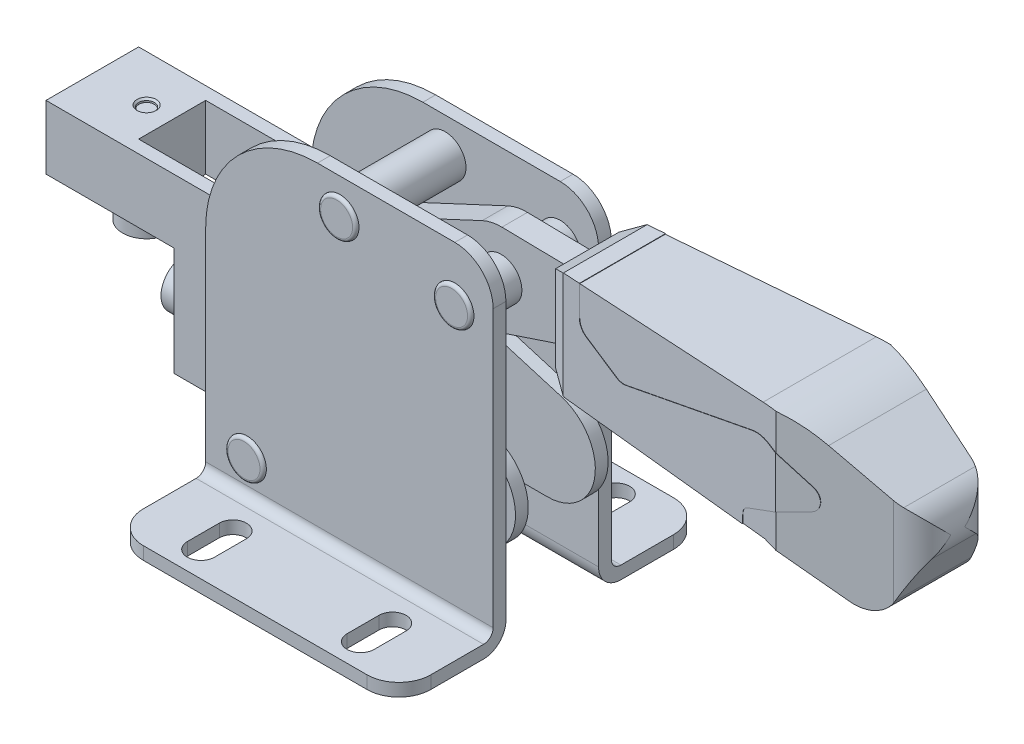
ISO-10303-21;
HEADER;
FILE_DESCRIPTION(('STEP AP214'),'2;1');
FILE_NAME('part.step','',(''),(''),'','','');
FILE_SCHEMA(('AUTOMOTIVE_DESIGN { 1 0 10303 214 1 1 1 1 }'));
ENDSEC;
DATA;
#1=APPLICATION_CONTEXT('core data for automotive mechanical design processes');
#2=APPLICATION_PROTOCOL_DEFINITION('international standard','automotive_design',2000,#1);
#3=PRODUCT_CONTEXT('',#1,'mechanical');
#4=PRODUCT('Part','Part','',(#3));
#5=PRODUCT_RELATED_PRODUCT_CATEGORY('part','',(#4));
#6=PRODUCT_DEFINITION_FORMATION('','',#4);
#7=PRODUCT_DEFINITION_CONTEXT('part definition',#1,'design');
#8=PRODUCT_DEFINITION('design','',#6,#7);
#9=PRODUCT_DEFINITION_SHAPE('','',#8);
#10=(LENGTH_UNIT() NAMED_UNIT(*) SI_UNIT(.MILLI.,.METRE.));
#11=(NAMED_UNIT(*) PLANE_ANGLE_UNIT() SI_UNIT($,.RADIAN.));
#12=(NAMED_UNIT(*) SI_UNIT($,.STERADIAN.) SOLID_ANGLE_UNIT());
#13=UNCERTAINTY_MEASURE_WITH_UNIT(LENGTH_MEASURE(1.E-05),#10,'distance_accuracy_value','');
#14=(GEOMETRIC_REPRESENTATION_CONTEXT(3) GLOBAL_UNCERTAINTY_ASSIGNED_CONTEXT((#13)) GLOBAL_UNIT_ASSIGNED_CONTEXT((#10,
#11,#12)) REPRESENTATION_CONTEXT('',''));
#15=CARTESIAN_POINT('',(0.,0.,0.));
#16=DIRECTION('',(0.,0.,1.));
#17=DIRECTION('',(1.,0.,0.));
#18=AXIS2_PLACEMENT_3D('',#15,#16,#17);
#19=CARTESIAN_POINT('',(42.,99.5,-19.5));
#20=DIRECTION('',(0.,0.,1.));
#21=DIRECTION('',(1.,0.,0.));
#22=AXIS2_PLACEMENT_3D('',#19,#20,#21);
#23=PLANE('',#22);
#24=CARTESIAN_POINT('',(42.,94.5,-19.5));
#25=DIRECTION('',(0.,0.,1.));
#26=DIRECTION('',(-1.,0.,0.));
#27=AXIS2_PLACEMENT_3D('',#24,#25,#26);
#28=CIRCLE('',#27,5.);
#29=CARTESIAN_POINT('',(37.,94.5,-19.5));
#30=VERTEX_POINT('',#29);
#31=EDGE_CURVE('P0_E323',#30,#30,#28,.T.);
#32=ORIENTED_EDGE('',*,*,#31,.F.);
#33=EDGE_LOOP('',(#32));
#34=FACE_BOUND('',#33,.T.);
#35=ADVANCED_FACE('P0_F16',(#34),#23,.F.);
#36=CARTESIAN_POINT('',(78.,93.5,-19.5));
#37=DIRECTION('',(0.,0.,1.));
#38=DIRECTION('',(1.,0.,0.));
#39=AXIS2_PLACEMENT_3D('',#36,#37,#38);
#40=PLANE('',#39);
#41=CARTESIAN_POINT('',(78.,88.5,-19.5));
#42=DIRECTION('',(0.,0.,1.));
#43=DIRECTION('',(-1.,0.,0.));
#44=AXIS2_PLACEMENT_3D('',#41,#42,#43);
#45=CIRCLE('',#44,5.);
#46=CARTESIAN_POINT('',(73.,88.5,-19.5));
#47=VERTEX_POINT('',#46);
#48=EDGE_CURVE('P0_E315',#47,#47,#45,.T.);
#49=ORIENTED_EDGE('',*,*,#48,.F.);
#50=EDGE_LOOP('',(#49));
#51=FACE_BOUND('',#50,.T.);
#52=ADVANCED_FACE('P0_F357',(#51),#40,.F.);
#53=CARTESIAN_POINT('',(13.,19.5,-19.5));
#54=DIRECTION('',(0.,0.,1.));
#55=DIRECTION('',(1.,0.,0.));
#56=AXIS2_PLACEMENT_3D('',#53,#54,#55);
#57=PLANE('',#56);
#58=CARTESIAN_POINT('',(13.,14.5,-19.5));
#59=DIRECTION('',(0.,0.,1.));
#60=DIRECTION('',(-1.,0.,0.));
#61=AXIS2_PLACEMENT_3D('',#58,#59,#60);
#62=CIRCLE('',#61,4.99999999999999);
#63=CARTESIAN_POINT('',(8.00000000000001,14.5,-19.5));
#64=VERTEX_POINT('',#63);
#65=EDGE_CURVE('P0_E305',#64,#64,#62,.T.);
#66=ORIENTED_EDGE('',*,*,#65,.F.);
#67=EDGE_LOOP('',(#66));
#68=FACE_BOUND('',#67,.T.);
#69=ADVANCED_FACE('P0_F347',(#68),#57,.F.);
#70=CARTESIAN_POINT('',(70.,10.,-30.));
#71=DIRECTION('',(0.,1.,0.));
#72=DIRECTION('',(0.,0.,1.));
#73=AXIS2_PLACEMENT_3D('',#70,#71,#72);
#74=CYLINDRICAL_SURFACE('',#73,4.25);
#75=DIRECTION('',(0.,1.,0.));
#76=VECTOR('',#75,1.);
#77=CARTESIAN_POINT('',(74.25,10.,-30.));
#78=LINE('',#77,#76);
#79=CARTESIAN_POINT('',(74.25,0.,-30.));
#80=VERTEX_POINT('',#79);
#81=CARTESIAN_POINT('',(74.25,4.,-30.));
#82=VERTEX_POINT('',#81);
#83=EDGE_CURVE('P0_E288',#80,#82,#78,.T.);
#84=ORIENTED_EDGE('',*,*,#83,.F.);
#85=CARTESIAN_POINT('',(70.,0.,-30.));
#86=DIRECTION('',(0.,1.,0.));
#87=DIRECTION('',(0.,0.,1.));
#88=AXIS2_PLACEMENT_3D('',#85,#86,#87);
#89=CIRCLE('',#88,4.25);
#90=CARTESIAN_POINT('',(65.75,0.,-30.));
#91=VERTEX_POINT('',#90);
#92=EDGE_CURVE('P0_E293',#80,#91,#89,.F.);
#93=ORIENTED_EDGE('',*,*,#92,.T.);
#94=DIRECTION('',(0.,1.,0.));
#95=VECTOR('',#94,1.);
#96=CARTESIAN_POINT('',(65.75,10.,-30.));
#97=LINE('',#96,#95);
#98=CARTESIAN_POINT('',(65.75,4.,-30.));
#99=VERTEX_POINT('',#98);
#100=EDGE_CURVE('P0_E287',#99,#91,#97,.F.);
#101=ORIENTED_EDGE('',*,*,#100,.F.);
#102=CARTESIAN_POINT('',(70.,4.,-30.));
#103=DIRECTION('',(0.,1.,0.));
#104=DIRECTION('',(0.,0.,1.));
#105=AXIS2_PLACEMENT_3D('',#102,#103,#104);
#106=CIRCLE('',#105,4.25);
#107=EDGE_CURVE('P0_E441',#99,#82,#106,.T.);
#108=ORIENTED_EDGE('',*,*,#107,.T.);
#109=EDGE_LOOP('',(#84,#93,#101,#108));
#110=FACE_BOUND('',#109,.T.);
#111=ADVANCED_FACE('P0_F356',(#110),#74,.F.);
#112=CARTESIAN_POINT('',(74.25,10.,-30.));
#113=DIRECTION('',(-1.,0.,0.));
#114=DIRECTION('',(0.,0.,1.));
#115=AXIS2_PLACEMENT_3D('',#112,#113,#114);
#116=PLANE('',#115);
#117=DIRECTION('',(0.,0.,1.));
#118=VECTOR('',#117,1.);
#119=CARTESIAN_POINT('',(74.25,0.,-21.5));
#120=LINE('',#119,#118);
#121=CARTESIAN_POINT('',(74.25,0.,-40.));
#122=VERTEX_POINT('',#121);
#123=EDGE_CURVE('P0_E280',#122,#80,#120,.T.);
#124=ORIENTED_EDGE('',*,*,#123,.T.);
#125=ORIENTED_EDGE('',*,*,#83,.T.);
#126=DIRECTION('',(0.,0.,-1.));
#127=VECTOR('',#126,1.);
#128=CARTESIAN_POINT('',(74.25,4.,-48.));
#129=LINE('',#128,#127);
#130=CARTESIAN_POINT('',(74.25,4.,-40.));
#131=VERTEX_POINT('',#130);
#132=EDGE_CURVE('P0_E282',#82,#131,#129,.T.);
#133=ORIENTED_EDGE('',*,*,#132,.T.);
#134=DIRECTION('',(0.,1.,0.));
#135=VECTOR('',#134,1.);
#136=CARTESIAN_POINT('',(74.25,10.,-40.));
#137=LINE('',#136,#135);
#138=EDGE_CURVE('P0_E278',#131,#122,#137,.F.);
#139=ORIENTED_EDGE('',*,*,#138,.T.);
#140=EDGE_LOOP('',(#124,#125,#133,#139));
#141=FACE_BOUND('',#140,.T.);
#142=ADVANCED_FACE('P0_F279',(#141),#116,.T.);
#143=CARTESIAN_POINT('',(70.,10.,-40.));
#144=DIRECTION('',(0.,1.,0.));
#145=DIRECTION('',(0.,0.,1.));
#146=AXIS2_PLACEMENT_3D('',#143,#144,#145);
#147=CYLINDRICAL_SURFACE('',#146,4.25);
#148=DIRECTION('',(0.,1.,0.));
#149=VECTOR('',#148,1.);
#150=CARTESIAN_POINT('',(65.75,10.,-40.));
#151=LINE('',#150,#149);
#152=CARTESIAN_POINT('',(65.75,0.,-40.));
#153=VERTEX_POINT('',#152);
#154=CARTESIAN_POINT('',(65.75,4.,-40.));
#155=VERTEX_POINT('',#154);
#156=EDGE_CURVE('P0_E297',#153,#155,#151,.T.);
#157=ORIENTED_EDGE('',*,*,#156,.F.);
#158=CARTESIAN_POINT('',(70.,0.,-40.));
#159=DIRECTION('',(0.,1.,0.));
#160=DIRECTION('',(0.,0.,1.));
#161=AXIS2_PLACEMENT_3D('',#158,#159,#160);
#162=CIRCLE('',#161,4.25);
#163=EDGE_CURVE('P0_E20',#153,#122,#162,.F.);
#164=ORIENTED_EDGE('',*,*,#163,.T.);
#165=ORIENTED_EDGE('',*,*,#138,.F.);
#166=CARTESIAN_POINT('',(70.,4.,-40.));
#167=DIRECTION('',(0.,1.,0.));
#168=DIRECTION('',(0.,0.,1.));
#169=AXIS2_PLACEMENT_3D('',#166,#167,#168);
#170=CIRCLE('',#169,4.25);
#171=EDGE_CURVE('P0_E440',#131,#155,#170,.T.);
#172=ORIENTED_EDGE('',*,*,#171,.T.);
#173=EDGE_LOOP('',(#157,#164,#165,#172));
#174=FACE_BOUND('',#173,.T.);
#175=ADVANCED_FACE('P0_F296',(#174),#147,.F.);
#176=CARTESIAN_POINT('',(65.75,10.,-40.));
#177=DIRECTION('',(1.,0.,0.));
#178=DIRECTION('',(0.,0.,-1.));
#179=AXIS2_PLACEMENT_3D('',#176,#177,#178);
#180=PLANE('',#179);
#181=DIRECTION('',(0.,0.,1.));
#182=VECTOR('',#181,1.);
#183=CARTESIAN_POINT('',(65.75,0.,-21.5));
#184=LINE('',#183,#182);
#185=EDGE_CURVE('P0_E414',#91,#153,#184,.F.);
#186=ORIENTED_EDGE('',*,*,#185,.T.);
#187=ORIENTED_EDGE('',*,*,#156,.T.);
#188=DIRECTION('',(0.,0.,-1.));
#189=VECTOR('',#188,1.);
#190=CARTESIAN_POINT('',(65.75,4.,-48.));
#191=LINE('',#190,#189);
#192=EDGE_CURVE('P0_E442',#155,#99,#191,.F.);
#193=ORIENTED_EDGE('',*,*,#192,.T.);
#194=ORIENTED_EDGE('',*,*,#100,.T.);
#195=EDGE_LOOP('',(#186,#187,#193,#194));
#196=FACE_BOUND('',#195,.T.);
#197=ADVANCED_FACE('P0_F871',(#196),#180,.T.);
#198=CARTESIAN_POINT('',(20.,10.,-30.));
#199=DIRECTION('',(0.,1.,0.));
#200=DIRECTION('',(0.,0.,1.));
#201=AXIS2_PLACEMENT_3D('',#198,#199,#200);
#202=CYLINDRICAL_SURFACE('',#201,4.25);
#203=DIRECTION('',(0.,1.,0.));
#204=VECTOR('',#203,1.);
#205=CARTESIAN_POINT('',(24.25,10.,-30.));
#206=LINE('',#205,#204);
#207=CARTESIAN_POINT('',(24.25,0.,-30.));
#208=VERTEX_POINT('',#207);
#209=CARTESIAN_POINT('',(24.25,4.,-30.));
#210=VERTEX_POINT('',#209);
#211=EDGE_CURVE('P0_E330',#208,#210,#206,.T.);
#212=ORIENTED_EDGE('',*,*,#211,.F.);
#213=CARTESIAN_POINT('',(20.,0.,-30.));
#214=DIRECTION('',(0.,1.,0.));
#215=DIRECTION('',(0.,0.,1.));
#216=AXIS2_PLACEMENT_3D('',#213,#214,#215);
#217=CIRCLE('',#216,4.25);
#218=CARTESIAN_POINT('',(15.75,0.,-30.));
#219=VERTEX_POINT('',#218);
#220=EDGE_CURVE('P0_E422',#208,#219,#217,.F.);
#221=ORIENTED_EDGE('',*,*,#220,.T.);
#222=DIRECTION('',(0.,1.,0.));
#223=VECTOR('',#222,1.);
#224=CARTESIAN_POINT('',(15.75,10.,-30.));
#225=LINE('',#224,#223);
#226=CARTESIAN_POINT('',(15.75,4.,-30.));
#227=VERTEX_POINT('',#226);
#228=EDGE_CURVE('P0_E324',#227,#219,#225,.F.);
#229=ORIENTED_EDGE('',*,*,#228,.F.);
#230=CARTESIAN_POINT('',(20.,4.,-30.));
#231=DIRECTION('',(0.,1.,0.));
#232=DIRECTION('',(0.,0.,1.));
#233=AXIS2_PLACEMENT_3D('',#230,#231,#232);
#234=CIRCLE('',#233,4.25);
#235=EDGE_CURVE('P0_E446',#227,#210,#234,.T.);
#236=ORIENTED_EDGE('',*,*,#235,.T.);
#237=EDGE_LOOP('',(#212,#221,#229,#236));
#238=FACE_BOUND('',#237,.T.);
#239=ADVANCED_FACE('P0_F873',(#238),#202,.F.);
#240=CARTESIAN_POINT('',(24.25,10.,-30.));
#241=DIRECTION('',(-1.,0.,0.));
#242=DIRECTION('',(0.,0.,1.));
#243=AXIS2_PLACEMENT_3D('',#240,#241,#242);
#244=PLANE('',#243);
#245=DIRECTION('',(0.,0.,1.));
#246=VECTOR('',#245,1.);
#247=CARTESIAN_POINT('',(24.25,0.,-21.5));
#248=LINE('',#247,#246);
#249=CARTESIAN_POINT('',(24.25,0.,-40.));
#250=VERTEX_POINT('',#249);
#251=EDGE_CURVE('P0_E418',#250,#208,#248,.T.);
#252=ORIENTED_EDGE('',*,*,#251,.T.);
#253=ORIENTED_EDGE('',*,*,#211,.T.);
#254=DIRECTION('',(0.,0.,-1.));
#255=VECTOR('',#254,1.);
#256=CARTESIAN_POINT('',(24.25,4.,-48.));
#257=LINE('',#256,#255);
#258=CARTESIAN_POINT('',(24.25,4.,-40.));
#259=VERTEX_POINT('',#258);
#260=EDGE_CURVE('P0_E447',#210,#259,#257,.T.);
#261=ORIENTED_EDGE('',*,*,#260,.T.);
#262=DIRECTION('',(0.,1.,0.));
#263=VECTOR('',#262,1.);
#264=CARTESIAN_POINT('',(24.25,10.,-40.));
#265=LINE('',#264,#263);
#266=EDGE_CURVE('P0_E327',#259,#250,#265,.F.);
#267=ORIENTED_EDGE('',*,*,#266,.T.);
#268=EDGE_LOOP('',(#252,#253,#261,#267));
#269=FACE_BOUND('',#268,.T.);
#270=ADVANCED_FACE('P0_F879',(#269),#244,.T.);
#271=CARTESIAN_POINT('',(20.,10.,-40.));
#272=DIRECTION('',(0.,1.,0.));
#273=DIRECTION('',(0.,0.,1.));
#274=AXIS2_PLACEMENT_3D('',#271,#272,#273);
#275=CYLINDRICAL_SURFACE('',#274,4.25);
#276=DIRECTION('',(0.,1.,0.));
#277=VECTOR('',#276,1.);
#278=CARTESIAN_POINT('',(15.75,10.,-40.));
#279=LINE('',#278,#277);
#280=CARTESIAN_POINT('',(15.75,0.,-40.));
#281=VERTEX_POINT('',#280);
#282=CARTESIAN_POINT('',(15.75,4.,-40.));
#283=VERTEX_POINT('',#282);
#284=EDGE_CURVE('P0_E320',#281,#283,#279,.T.);
#285=ORIENTED_EDGE('',*,*,#284,.F.);
#286=CARTESIAN_POINT('',(20.,0.,-40.));
#287=DIRECTION('',(0.,1.,0.));
#288=DIRECTION('',(0.,0.,1.));
#289=AXIS2_PLACEMENT_3D('',#286,#287,#288);
#290=CIRCLE('',#289,4.25);
#291=EDGE_CURVE('P0_E417',#281,#250,#290,.F.);
#292=ORIENTED_EDGE('',*,*,#291,.T.);
#293=ORIENTED_EDGE('',*,*,#266,.F.);
#294=CARTESIAN_POINT('',(20.,4.,-40.));
#295=DIRECTION('',(0.,1.,0.));
#296=DIRECTION('',(0.,0.,1.));
#297=AXIS2_PLACEMENT_3D('',#294,#295,#296);
#298=CIRCLE('',#297,4.25);
#299=EDGE_CURVE('P0_E451',#259,#283,#298,.T.);
#300=ORIENTED_EDGE('',*,*,#299,.T.);
#301=EDGE_LOOP('',(#285,#292,#293,#300));
#302=FACE_BOUND('',#301,.T.);
#303=ADVANCED_FACE('P0_F1181',(#302),#275,.F.);
#304=CARTESIAN_POINT('',(15.75,10.,-40.));
#305=DIRECTION('',(1.,0.,0.));
#306=DIRECTION('',(0.,0.,-1.));
#307=AXIS2_PLACEMENT_3D('',#304,#305,#306);
#308=PLANE('',#307);
#309=DIRECTION('',(0.,0.,1.));
#310=VECTOR('',#309,1.);
#311=CARTESIAN_POINT('',(15.75,0.,-21.5));
#312=LINE('',#311,#310);
#313=EDGE_CURVE('P0_E423',#219,#281,#312,.F.);
#314=ORIENTED_EDGE('',*,*,#313,.T.);
#315=ORIENTED_EDGE('',*,*,#284,.T.);
#316=DIRECTION('',(0.,0.,-1.));
#317=VECTOR('',#316,1.);
#318=CARTESIAN_POINT('',(15.75,4.,-48.));
#319=LINE('',#318,#317);
#320=EDGE_CURVE('P0_E452',#283,#227,#319,.F.);
#321=ORIENTED_EDGE('',*,*,#320,.T.);
#322=ORIENTED_EDGE('',*,*,#228,.T.);
#323=EDGE_LOOP('',(#314,#315,#321,#322));
#324=FACE_BOUND('',#323,.T.);
#325=ADVANCED_FACE('P0_F1130',(#324),#308,.T.);
#326=CARTESIAN_POINT('',(90.,0.,-48.));
#327=DIRECTION('',(0.,0.,1.));
#328=DIRECTION('',(1.,0.,0.));
#329=AXIS2_PLACEMENT_3D('',#326,#327,#328);
#330=PLANE('',#329);
#331=DIRECTION('',(0.,1.,0.));
#332=VECTOR('',#331,1.);
#333=CARTESIAN_POINT('',(9.99999999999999,10.,-48.));
#334=LINE('',#333,#332);
#335=CARTESIAN_POINT('',(9.99999999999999,4.,-48.));
#336=VERTEX_POINT('',#335);
#337=CARTESIAN_POINT('',(9.99999999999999,0.,-48.));
#338=VERTEX_POINT('',#337);
#339=EDGE_CURVE('P0_E318',#336,#338,#334,.F.);
#340=ORIENTED_EDGE('',*,*,#339,.F.);
#341=DIRECTION('',(1.,0.,0.));
#342=VECTOR('',#341,1.);
#343=CARTESIAN_POINT('',(90.,4.,-48.));
#344=LINE('',#343,#342);
#345=CARTESIAN_POINT('',(80.,4.,-48.));
#346=VERTEX_POINT('',#345);
#347=EDGE_CURVE('P0_E457',#336,#346,#344,.T.);
#348=ORIENTED_EDGE('',*,*,#347,.T.);
#349=DIRECTION('',(0.,1.,0.));
#350=VECTOR('',#349,1.);
#351=CARTESIAN_POINT('',(80.,10.,-48.));
#352=LINE('',#351,#350);
#353=CARTESIAN_POINT('',(80.,0.,-48.));
#354=VERTEX_POINT('',#353);
#355=EDGE_CURVE('P0_E300',#354,#346,#352,.T.);
#356=ORIENTED_EDGE('',*,*,#355,.F.);
#357=DIRECTION('',(1.,0.,0.));
#358=VECTOR('',#357,1.);
#359=CARTESIAN_POINT('',(90.,0.,-48.));
#360=LINE('',#359,#358);
#361=EDGE_CURVE('P0_E428',#354,#338,#360,.F.);
#362=ORIENTED_EDGE('',*,*,#361,.T.);
#363=EDGE_LOOP('',(#340,#348,#356,#362));
#364=FACE_BOUND('',#363,.T.);
#365=ADVANCED_FACE('P0_F1126',(#364),#330,.F.);
#366=CARTESIAN_POINT('',(42.,94.5,-18.5));
#367=DIRECTION('',(0.,0.,-1.));
#368=DIRECTION('',(-1.,0.,0.));
#369=AXIS2_PLACEMENT_3D('',#366,#367,#368);
#370=TOROIDAL_SURFACE('',#369,4.99999999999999,1.00000000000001);
#371=ORIENTED_EDGE('',*,*,#31,.T.);
#372=EDGE_LOOP('',(#371));
#373=FACE_BOUND('',#372,.T.);
#374=CARTESIAN_POINT('',(42.,94.5,-18.5));
#375=DIRECTION('',(0.,0.,-1.));
#376=DIRECTION('',(-1.,0.,0.));
#377=AXIS2_PLACEMENT_3D('',#374,#375,#376);
#378=CIRCLE('',#377,6.);
#379=CARTESIAN_POINT('',(36.,94.5,-18.5));
#380=VERTEX_POINT('',#379);
#381=EDGE_CURVE('P0_E465',#380,#380,#378,.T.);
#382=ORIENTED_EDGE('',*,*,#381,.T.);
#383=EDGE_LOOP('',(#382));
#384=FACE_BOUND('',#383,.T.);
#385=ADVANCED_FACE('P0_F394',(#373,#384),#370,.T.);
#386=CARTESIAN_POINT('',(78.,88.5,-18.5));
#387=DIRECTION('',(0.,0.,-1.));
#388=DIRECTION('',(-1.,0.,0.));
#389=AXIS2_PLACEMENT_3D('',#386,#387,#388);
#390=TOROIDAL_SURFACE('',#389,5.00000000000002,0.999999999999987);
#391=ORIENTED_EDGE('',*,*,#48,.T.);
#392=EDGE_LOOP('',(#391));
#393=FACE_BOUND('',#392,.T.);
#394=CARTESIAN_POINT('',(78.,88.5,-18.5));
#395=DIRECTION('',(0.,0.,-1.));
#396=DIRECTION('',(-1.,0.,0.));
#397=AXIS2_PLACEMENT_3D('',#394,#395,#396);
#398=CIRCLE('',#397,6.00000000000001);
#399=CARTESIAN_POINT('',(72.,88.5,-18.5));
#400=VERTEX_POINT('',#399);
#401=EDGE_CURVE('P0_E832',#400,#400,#398,.T.);
#402=ORIENTED_EDGE('',*,*,#401,.T.);
#403=EDGE_LOOP('',(#402));
#404=FACE_BOUND('',#403,.T.);
#405=ADVANCED_FACE('P0_F382',(#393,#404),#390,.T.);
#406=CARTESIAN_POINT('',(13.,14.5,-18.5));
#407=DIRECTION('',(0.,0.,-1.));
#408=DIRECTION('',(-1.,0.,0.));
#409=AXIS2_PLACEMENT_3D('',#406,#407,#408);
#410=TOROIDAL_SURFACE('',#409,5.,1.);
#411=ORIENTED_EDGE('',*,*,#65,.T.);
#412=EDGE_LOOP('',(#411));
#413=FACE_BOUND('',#412,.T.);
#414=CARTESIAN_POINT('',(13.,14.5,-18.5));
#415=DIRECTION('',(0.,0.,-1.));
#416=DIRECTION('',(-1.,0.,0.));
#417=AXIS2_PLACEMENT_3D('',#414,#415,#416);
#418=CIRCLE('',#417,6.);
#419=CARTESIAN_POINT('',(7.,14.5,-18.5));
#420=VERTEX_POINT('',#419);
#421=EDGE_CURVE('P0_E471',#420,#420,#418,.T.);
#422=ORIENTED_EDGE('',*,*,#421,.T.);
#423=EDGE_LOOP('',(#422));
#424=FACE_BOUND('',#423,.T.);
#425=ADVANCED_FACE('P0_F393',(#413,#424),#410,.T.);
#426=CARTESIAN_POINT('',(80.,10.,-38.));
#427=DIRECTION('',(0.,1.,0.));
#428=DIRECTION('',(0.,0.,1.));
#429=AXIS2_PLACEMENT_3D('',#426,#427,#428);
#430=CYLINDRICAL_SURFACE('',#429,9.99999999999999);
#431=ORIENTED_EDGE('',*,*,#355,.T.);
#432=CARTESIAN_POINT('',(80.,4.,-38.));
#433=DIRECTION('',(0.,1.,0.));
#434=DIRECTION('',(0.,0.,1.));
#435=AXIS2_PLACEMENT_3D('',#432,#433,#434);
#436=CIRCLE('',#435,9.99999999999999);
#437=CARTESIAN_POINT('',(90.,4.,-38.));
#438=VERTEX_POINT('',#437);
#439=EDGE_CURVE('P0_E456',#346,#438,#436,.F.);
#440=ORIENTED_EDGE('',*,*,#439,.T.);
#441=DIRECTION('',(0.,1.,0.));
#442=VECTOR('',#441,1.);
#443=CARTESIAN_POINT('',(90.,7.,-38.));
#444=LINE('',#443,#442);
#445=CARTESIAN_POINT('',(90.,0.,-38.));
#446=VERTEX_POINT('',#445);
#447=EDGE_CURVE('P0_E404',#446,#438,#444,.T.);
#448=ORIENTED_EDGE('',*,*,#447,.F.);
#449=CARTESIAN_POINT('',(80.,0.,-38.));
#450=DIRECTION('',(0.,1.,0.));
#451=DIRECTION('',(0.,0.,1.));
#452=AXIS2_PLACEMENT_3D('',#449,#450,#451);
#453=CIRCLE('',#452,9.99999999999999);
#454=EDGE_CURVE('P0_E427',#446,#354,#453,.T.);
#455=ORIENTED_EDGE('',*,*,#454,.T.);
#456=EDGE_LOOP('',(#431,#440,#448,#455));
#457=FACE_BOUND('',#456,.T.);
#458=ADVANCED_FACE('P0_F1110',(#457),#430,.T.);
#459=CARTESIAN_POINT('',(90.,0.,-21.5));
#460=DIRECTION('',(0.,1.,0.));
#461=DIRECTION('',(0.,0.,1.));
#462=AXIS2_PLACEMENT_3D('',#459,#460,#461);
#463=PLANE('',#462);
#464=CARTESIAN_POINT('',(9.99999999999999,0.,-38.));
#465=DIRECTION('',(0.,1.,0.));
#466=DIRECTION('',(0.,0.,1.));
#467=AXIS2_PLACEMENT_3D('',#464,#465,#466);
#468=CIRCLE('',#467,9.99999999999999);
#469=CARTESIAN_POINT('',(0.,0.,-38.));
#470=VERTEX_POINT('',#469);
#471=EDGE_CURVE('P0_E853',#338,#470,#468,.T.);
#472=ORIENTED_EDGE('',*,*,#471,.F.);
#473=ORIENTED_EDGE('',*,*,#361,.F.);
#474=ORIENTED_EDGE('',*,*,#454,.F.);
#475=DIRECTION('',(0.,0.,-1.));
#476=VECTOR('',#475,1.);
#477=CARTESIAN_POINT('',(90.,0.,-21.5));
#478=LINE('',#477,#476);
#479=CARTESIAN_POINT('',(90.,0.,-21.5));
#480=VERTEX_POINT('',#479);
#481=EDGE_CURVE('P0_E408',#480,#446,#478,.T.);
#482=ORIENTED_EDGE('',*,*,#481,.F.);
#483=DIRECTION('',(1.,0.,0.));
#484=VECTOR('',#483,1.);
#485=CARTESIAN_POINT('',(90.,0.,-21.5));
#486=LINE('',#485,#484);
#487=CARTESIAN_POINT('',(0.,0.,-21.5));
#488=VERTEX_POINT('',#487);
#489=EDGE_CURVE('P0_E409',#488,#480,#486,.T.);
#490=ORIENTED_EDGE('',*,*,#489,.F.);
#491=DIRECTION('',(0.,0.,-1.));
#492=VECTOR('',#491,1.);
#493=CARTESIAN_POINT('',(0.,0.,-21.5));
#494=LINE('',#493,#492);
#495=EDGE_CURVE('P0_E437',#488,#470,#494,.T.);
#496=ORIENTED_EDGE('',*,*,#495,.T.);
#497=EDGE_LOOP('',(#472,#473,#474,#482,#490,#496));
#498=FACE_BOUND('',#497,.T.);
#499=ORIENTED_EDGE('',*,*,#220,.F.);
#500=ORIENTED_EDGE('',*,*,#251,.F.);
#501=ORIENTED_EDGE('',*,*,#291,.F.);
#502=ORIENTED_EDGE('',*,*,#313,.F.);
#503=EDGE_LOOP('',(#499,#500,#501,#502));
#504=FACE_BOUND('',#503,.T.);
#505=ORIENTED_EDGE('',*,*,#92,.F.);
#506=ORIENTED_EDGE('',*,*,#123,.F.);
#507=ORIENTED_EDGE('',*,*,#163,.F.);
#508=ORIENTED_EDGE('',*,*,#185,.F.);
#509=EDGE_LOOP('',(#505,#506,#507,#508));
#510=FACE_BOUND('',#509,.T.);
#511=ADVANCED_FACE('P0_F291',(#498,#504,#510),#463,.F.);
#512=CARTESIAN_POINT('',(9.99999999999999,10.,-38.));
#513=DIRECTION('',(0.,1.,0.));
#514=DIRECTION('',(0.,0.,1.));
#515=AXIS2_PLACEMENT_3D('',#512,#513,#514);
#516=CYLINDRICAL_SURFACE('',#515,9.99999999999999);
#517=DIRECTION('',(0.,1.,0.));
#518=VECTOR('',#517,1.);
#519=CARTESIAN_POINT('',(0.,7.,-38.));
#520=LINE('',#519,#518);
#521=CARTESIAN_POINT('',(0.,4.,-38.));
#522=VERTEX_POINT('',#521);
#523=EDGE_CURVE('P0_E432',#470,#522,#520,.T.);
#524=ORIENTED_EDGE('',*,*,#523,.T.);
#525=CARTESIAN_POINT('',(9.99999999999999,4.,-38.));
#526=DIRECTION('',(0.,1.,0.));
#527=DIRECTION('',(0.,0.,1.));
#528=AXIS2_PLACEMENT_3D('',#525,#526,#527);
#529=CIRCLE('',#528,9.99999999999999);
#530=EDGE_CURVE('P0_E461',#522,#336,#529,.F.);
#531=ORIENTED_EDGE('',*,*,#530,.T.);
#532=ORIENTED_EDGE('',*,*,#339,.T.);
#533=ORIENTED_EDGE('',*,*,#471,.T.);
#534=EDGE_LOOP('',(#524,#531,#532,#533));
#535=FACE_BOUND('',#534,.T.);
#536=ADVANCED_FACE('P0_F1104',(#535),#516,.T.);
#537=CARTESIAN_POINT('',(90.,4.,-48.));
#538=DIRECTION('',(0.,-1.,0.));
#539=DIRECTION('',(0.,0.,-1.));
#540=AXIS2_PLACEMENT_3D('',#537,#538,#539);
#541=PLANE('',#540);
#542=ORIENTED_EDGE('',*,*,#530,.F.);
#543=DIRECTION('',(0.,0.,-1.));
#544=VECTOR('',#543,1.);
#545=CARTESIAN_POINT('',(0.,4.,-21.5));
#546=LINE('',#545,#544);
#547=CARTESIAN_POINT('',(0.,4.,-21.5));
#548=VERTEX_POINT('',#547);
#549=EDGE_CURVE('P0_E436',#522,#548,#546,.F.);
#550=ORIENTED_EDGE('',*,*,#549,.T.);
#551=DIRECTION('',(1.,0.,0.));
#552=VECTOR('',#551,1.);
#553=CARTESIAN_POINT('',(90.,4.,-21.5));
#554=LINE('',#553,#552);
#555=CARTESIAN_POINT('',(90.,4.,-21.5));
#556=VERTEX_POINT('',#555);
#557=EDGE_CURVE('P0_E460',#548,#556,#554,.T.);
#558=ORIENTED_EDGE('',*,*,#557,.T.);
#559=DIRECTION('',(0.,0.,-1.));
#560=VECTOR('',#559,1.);
#561=CARTESIAN_POINT('',(90.,4.,-21.5));
#562=LINE('',#561,#560);
#563=EDGE_CURVE('P0_E407',#438,#556,#562,.F.);
#564=ORIENTED_EDGE('',*,*,#563,.F.);
#565=ORIENTED_EDGE('',*,*,#439,.F.);
#566=ORIENTED_EDGE('',*,*,#347,.F.);
#567=EDGE_LOOP('',(#542,#550,#558,#564,#565,#566));
#568=FACE_BOUND('',#567,.T.);
#569=ORIENTED_EDGE('',*,*,#299,.F.);
#570=ORIENTED_EDGE('',*,*,#260,.F.);
#571=ORIENTED_EDGE('',*,*,#235,.F.);
#572=ORIENTED_EDGE('',*,*,#320,.F.);
#573=EDGE_LOOP('',(#569,#570,#571,#572));
#574=FACE_BOUND('',#573,.T.);
#575=ORIENTED_EDGE('',*,*,#171,.F.);
#576=ORIENTED_EDGE('',*,*,#132,.F.);
#577=ORIENTED_EDGE('',*,*,#107,.F.);
#578=ORIENTED_EDGE('',*,*,#192,.F.);
#579=EDGE_LOOP('',(#575,#576,#577,#578));
#580=FACE_BOUND('',#579,.T.);
#581=ADVANCED_FACE('P0_F868',(#568,#574,#580),#541,.F.);
#582=CARTESIAN_POINT('',(90.,7.00000000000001,-21.5));
#583=DIRECTION('',(1.,0.,0.));
#584=DIRECTION('',(0.,0.,-1.));
#585=AXIS2_PLACEMENT_3D('',#582,#583,#584);
#586=CYLINDRICAL_SURFACE('',#585,3.00000000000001);
#587=DIRECTION('',(1.,0.,0.));
#588=VECTOR('',#587,1.);
#589=CARTESIAN_POINT('',(13.,7.00000004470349,-18.5));
#590=LINE('',#589,#588);
#591=CARTESIAN_POINT('',(0.,7.00000002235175,-18.5));
#592=VERTEX_POINT('',#591);
#593=CARTESIAN_POINT('',(90.,7.00000002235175,-18.5));
#594=VERTEX_POINT('',#593);
#595=EDGE_CURVE('P0_E466',#592,#594,#590,.T.);
#596=ORIENTED_EDGE('',*,*,#595,.T.);
#597=CARTESIAN_POINT('',(90.,7.00000000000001,-21.5));
#598=DIRECTION('',(1.,0.,0.));
#599=DIRECTION('',(0.,0.,-1.));
#600=AXIS2_PLACEMENT_3D('',#597,#598,#599);
#601=CIRCLE('',#600,3.00000000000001);
#602=EDGE_CURVE('P0_E486',#556,#594,#601,.F.);
#603=ORIENTED_EDGE('',*,*,#602,.F.);
#604=ORIENTED_EDGE('',*,*,#557,.F.);
#605=CARTESIAN_POINT('',(0.,7.00000000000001,-21.5));
#606=DIRECTION('',(1.,0.,0.));
#607=DIRECTION('',(0.,0.,-1.));
#608=AXIS2_PLACEMENT_3D('',#605,#606,#607);
#609=CIRCLE('',#608,3.00000000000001);
#610=EDGE_CURVE('P0_E502',#548,#592,#609,.F.);
#611=ORIENTED_EDGE('',*,*,#610,.T.);
#612=EDGE_LOOP('',(#596,#603,#604,#611));
#613=FACE_BOUND('',#612,.T.);
#614=ADVANCED_FACE('P0_F1097',(#613),#586,.F.);
#615=CARTESIAN_POINT('',(13.,21.,-18.5));
#616=DIRECTION('',(0.,0.,1.));
#617=DIRECTION('',(1.,0.,0.));
#618=AXIS2_PLACEMENT_3D('',#615,#616,#617);
#619=PLANE('',#618);
#620=CARTESIAN_POINT('',(35.,70.5,-18.5));
#621=DIRECTION('',(0.,0.,1.));
#622=DIRECTION('',(1.,0.,0.));
#623=AXIS2_PLACEMENT_3D('',#620,#621,#622);
#624=CIRCLE('',#623,35.);
#625=CARTESIAN_POINT('',(35.,105.5,-18.5));
#626=VERTEX_POINT('',#625);
#627=CARTESIAN_POINT('',(0.,70.5,-18.5));
#628=VERTEX_POINT('',#627);
#629=EDGE_CURVE('P0_E507',#626,#628,#624,.T.);
#630=ORIENTED_EDGE('',*,*,#629,.F.);
#631=DIRECTION('',(1.,0.,0.));
#632=VECTOR('',#631,1.);
#633=CARTESIAN_POINT('',(90.,105.5,-18.5));
#634=LINE('',#633,#632);
#635=CARTESIAN_POINT('',(78.,105.5,-18.5));
#636=VERTEX_POINT('',#635);
#637=EDGE_CURVE('P0_E472',#626,#636,#634,.T.);
#638=ORIENTED_EDGE('',*,*,#637,.T.);
#639=CARTESIAN_POINT('',(78.,93.5,-18.5));
#640=DIRECTION('',(0.,0.,1.));
#641=DIRECTION('',(1.,0.,0.));
#642=AXIS2_PLACEMENT_3D('',#639,#640,#641);
#643=CIRCLE('',#642,12.);
#644=CARTESIAN_POINT('',(90.,93.5,-18.5));
#645=VERTEX_POINT('',#644);
#646=EDGE_CURVE('P0_E470',#645,#636,#643,.T.);
#647=ORIENTED_EDGE('',*,*,#646,.F.);
#648=DIRECTION('',(0.,1.,0.));
#649=VECTOR('',#648,1.);
#650=CARTESIAN_POINT('',(90.,7.,-18.5));
#651=LINE('',#650,#649);
#652=EDGE_CURVE('P0_E480',#594,#645,#651,.T.);
#653=ORIENTED_EDGE('',*,*,#652,.F.);
#654=ORIENTED_EDGE('',*,*,#595,.F.);
#655=DIRECTION('',(0.,1.,0.));
#656=VECTOR('',#655,1.);
#657=CARTESIAN_POINT('',(0.,7.,-18.5));
#658=LINE('',#657,#656);
#659=EDGE_CURVE('P0_E503',#592,#628,#658,.T.);
#660=ORIENTED_EDGE('',*,*,#659,.T.);
#661=EDGE_LOOP('',(#630,#638,#647,#653,#654,#660));
#662=FACE_BOUND('',#661,.T.);
#663=ORIENTED_EDGE('',*,*,#421,.F.);
#664=EDGE_LOOP('',(#663));
#665=FACE_BOUND('',#664,.T.);
#666=ORIENTED_EDGE('',*,*,#401,.F.);
#667=EDGE_LOOP('',(#666));
#668=FACE_BOUND('',#667,.T.);
#669=ORIENTED_EDGE('',*,*,#381,.F.);
#670=EDGE_LOOP('',(#669));
#671=FACE_BOUND('',#670,.T.);
#672=ADVANCED_FACE('P0_F1093',(#662,#665,#668,#671),#619,.F.);
#673=CARTESIAN_POINT('',(78.,93.5,96.));
#674=DIRECTION('',(0.,0.,1.));
#675=DIRECTION('',(1.,0.,0.));
#676=AXIS2_PLACEMENT_3D('',#673,#674,#675);
#677=CYLINDRICAL_SURFACE('',#676,12.);
#678=DIRECTION('',(0.,0.,-1.));
#679=VECTOR('',#678,1.);
#680=CARTESIAN_POINT('',(78.,105.5,-18.5));
#681=LINE('',#680,#679);
#682=CARTESIAN_POINT('',(78.,105.5,-14.5));
#683=VERTEX_POINT('',#682);
#684=EDGE_CURVE('P0_E511',#636,#683,#681,.F.);
#685=ORIENTED_EDGE('',*,*,#684,.T.);
#686=CARTESIAN_POINT('',(78.,93.5,-14.5));
#687=DIRECTION('',(0.,0.,1.));
#688=DIRECTION('',(1.,0.,0.));
#689=AXIS2_PLACEMENT_3D('',#686,#687,#688);
#690=CIRCLE('',#689,12.);
#691=CARTESIAN_POINT('',(90.,93.5,-14.5));
#692=VERTEX_POINT('',#691);
#693=EDGE_CURVE('P0_E476',#683,#692,#690,.F.);
#694=ORIENTED_EDGE('',*,*,#693,.T.);
#695=DIRECTION('',(0.,0.,-1.));
#696=VECTOR('',#695,1.);
#697=CARTESIAN_POINT('',(90.,93.5,-21.5));
#698=LINE('',#697,#696);
#699=EDGE_CURVE('P0_E412',#645,#692,#698,.F.);
#700=ORIENTED_EDGE('',*,*,#699,.F.);
#701=ORIENTED_EDGE('',*,*,#646,.T.);
#702=EDGE_LOOP('',(#685,#694,#700,#701));
#703=FACE_BOUND('',#702,.T.);
#704=ADVANCED_FACE('P0_F1089',(#703),#677,.T.);
#705=CARTESIAN_POINT('',(90.,7.,-21.5));
#706=DIRECTION('',(1.,0.,0.));
#707=DIRECTION('',(0.,0.,-1.));
#708=AXIS2_PLACEMENT_3D('',#705,#706,#707);
#709=PLANE('',#708);
#710=ORIENTED_EDGE('',*,*,#652,.T.);
#711=ORIENTED_EDGE('',*,*,#699,.T.);
#712=DIRECTION('',(0.,1.,0.));
#713=VECTOR('',#712,1.);
#714=CARTESIAN_POINT('',(90.,105.5,-14.5));
#715=LINE('',#714,#713);
#716=CARTESIAN_POINT('',(90.,7.00000000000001,-14.5));
#717=VERTEX_POINT('',#716);
#718=EDGE_CURVE('P0_E494',#692,#717,#715,.F.);
#719=ORIENTED_EDGE('',*,*,#718,.T.);
#720=CARTESIAN_POINT('',(90.,7.,-21.5));
#721=DIRECTION('',(1.,0.,0.));
#722=DIRECTION('',(0.,0.,-1.));
#723=AXIS2_PLACEMENT_3D('',#720,#721,#722);
#724=CIRCLE('',#723,6.99999999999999);
#725=EDGE_CURVE('P0_E411',#480,#717,#724,.F.);
#726=ORIENTED_EDGE('',*,*,#725,.F.);
#727=ORIENTED_EDGE('',*,*,#481,.T.);
#728=ORIENTED_EDGE('',*,*,#447,.T.);
#729=ORIENTED_EDGE('',*,*,#563,.T.);
#730=ORIENTED_EDGE('',*,*,#602,.T.);
#731=EDGE_LOOP('',(#710,#711,#719,#726,#727,#728,#729,#730));
#732=FACE_BOUND('',#731,.T.);
#733=ADVANCED_FACE('P0_F1085',(#732),#709,.T.);
#734=CARTESIAN_POINT('',(90.,7.,-21.5));
#735=DIRECTION('',(1.,0.,0.));
#736=DIRECTION('',(0.,0.,-1.));
#737=AXIS2_PLACEMENT_3D('',#734,#735,#736);
#738=CYLINDRICAL_SURFACE('',#737,6.99999999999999);
#739=ORIENTED_EDGE('',*,*,#725,.T.);
#740=DIRECTION('',(-1.,0.,0.));
#741=VECTOR('',#740,1.);
#742=CARTESIAN_POINT('',(90.,7.00000000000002,-14.5));
#743=LINE('',#742,#741);
#744=CARTESIAN_POINT('',(0.,7.00000000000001,-14.5));
#745=VERTEX_POINT('',#744);
#746=EDGE_CURVE('P0_E489',#717,#745,#743,.T.);
#747=ORIENTED_EDGE('',*,*,#746,.T.);
#748=CARTESIAN_POINT('',(0.,7.,-21.5));
#749=DIRECTION('',(1.,0.,0.));
#750=DIRECTION('',(0.,0.,-1.));
#751=AXIS2_PLACEMENT_3D('',#748,#749,#750);
#752=CIRCLE('',#751,6.99999999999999);
#753=EDGE_CURVE('P0_E498',#745,#488,#752,.T.);
#754=ORIENTED_EDGE('',*,*,#753,.T.);
#755=ORIENTED_EDGE('',*,*,#489,.T.);
#756=EDGE_LOOP('',(#739,#747,#754,#755));
#757=FACE_BOUND('',#756,.T.);
#758=ADVANCED_FACE('P0_F1081',(#757),#738,.T.);
#759=CARTESIAN_POINT('',(0.,7.,-21.5));
#760=DIRECTION('',(1.,0.,0.));
#761=DIRECTION('',(0.,0.,-1.));
#762=AXIS2_PLACEMENT_3D('',#759,#760,#761);
#763=PLANE('',#762);
#764=ORIENTED_EDGE('',*,*,#659,.F.);
#765=ORIENTED_EDGE('',*,*,#610,.F.);
#766=ORIENTED_EDGE('',*,*,#549,.F.);
#767=ORIENTED_EDGE('',*,*,#523,.F.);
#768=ORIENTED_EDGE('',*,*,#495,.F.);
#769=ORIENTED_EDGE('',*,*,#753,.F.);
#770=DIRECTION('',(0.,1.,0.));
#771=VECTOR('',#770,1.);
#772=CARTESIAN_POINT('',(0.,105.5,-14.5));
#773=LINE('',#772,#771);
#774=CARTESIAN_POINT('',(0.,70.5,-14.5));
#775=VERTEX_POINT('',#774);
#776=EDGE_CURVE('P0_E493',#745,#775,#773,.T.);
#777=ORIENTED_EDGE('',*,*,#776,.T.);
#778=DIRECTION('',(0.,0.,1.));
#779=VECTOR('',#778,1.);
#780=CARTESIAN_POINT('',(0.,70.5,96.));
#781=LINE('',#780,#779);
#782=EDGE_CURVE('P0_E508',#628,#775,#781,.T.);
#783=ORIENTED_EDGE('',*,*,#782,.F.);
#784=EDGE_LOOP('',(#764,#765,#766,#767,#768,#769,#777,#783));
#785=FACE_BOUND('',#784,.T.);
#786=ADVANCED_FACE('P0_F1077',(#785),#763,.F.);
#787=CARTESIAN_POINT('',(35.,70.5,96.));
#788=DIRECTION('',(0.,0.,1.));
#789=DIRECTION('',(1.,0.,0.));
#790=AXIS2_PLACEMENT_3D('',#787,#788,#789);
#791=CYLINDRICAL_SURFACE('',#790,35.);
#792=ORIENTED_EDGE('',*,*,#782,.T.);
#793=CARTESIAN_POINT('',(35.,70.5,-14.5));
#794=DIRECTION('',(0.,0.,1.));
#795=DIRECTION('',(1.,0.,0.));
#796=AXIS2_PLACEMENT_3D('',#793,#794,#795);
#797=CIRCLE('',#796,35.);
#798=CARTESIAN_POINT('',(35.,105.5,-14.5));
#799=VERTEX_POINT('',#798);
#800=EDGE_CURVE('P0_E524',#775,#799,#797,.F.);
#801=ORIENTED_EDGE('',*,*,#800,.T.);
#802=DIRECTION('',(0.,0.,-1.));
#803=VECTOR('',#802,1.);
#804=CARTESIAN_POINT('',(35.,105.5,-18.5));
#805=LINE('',#804,#803);
#806=EDGE_CURVE('P0_E477',#799,#626,#805,.T.);
#807=ORIENTED_EDGE('',*,*,#806,.T.);
#808=ORIENTED_EDGE('',*,*,#629,.T.);
#809=EDGE_LOOP('',(#792,#801,#807,#808));
#810=FACE_BOUND('',#809,.T.);
#811=ADVANCED_FACE('P0_F1073',(#810),#791,.T.);
#812=CARTESIAN_POINT('',(90.,105.5,-18.5));
#813=DIRECTION('',(0.,-1.,0.));
#814=DIRECTION('',(0.,0.,-1.));
#815=AXIS2_PLACEMENT_3D('',#812,#813,#814);
#816=PLANE('',#815);
#817=ORIENTED_EDGE('',*,*,#806,.F.);
#818=DIRECTION('',(-1.,0.,0.));
#819=VECTOR('',#818,1.);
#820=CARTESIAN_POINT('',(90.,105.5,-14.5));
#821=LINE('',#820,#819);
#822=EDGE_CURVE('P0_E525',#799,#683,#821,.F.);
#823=ORIENTED_EDGE('',*,*,#822,.T.);
#824=ORIENTED_EDGE('',*,*,#684,.F.);
#825=ORIENTED_EDGE('',*,*,#637,.F.);
#826=EDGE_LOOP('',(#817,#823,#824,#825));
#827=FACE_BOUND('',#826,.T.);
#828=ADVANCED_FACE('P0_F1069',(#827),#816,.F.);
#829=CARTESIAN_POINT('',(90.,105.5,-14.5));
#830=DIRECTION('',(0.,0.,-1.));
#831=DIRECTION('',(-1.,0.,0.));
#832=AXIS2_PLACEMENT_3D('',#829,#830,#831);
#833=PLANE('',#832);
#834=ORIENTED_EDGE('',*,*,#800,.F.);
#835=ORIENTED_EDGE('',*,*,#776,.F.);
#836=ORIENTED_EDGE('',*,*,#746,.F.);
#837=ORIENTED_EDGE('',*,*,#718,.F.);
#838=ORIENTED_EDGE('',*,*,#693,.F.);
#839=ORIENTED_EDGE('',*,*,#822,.F.);
#840=EDGE_LOOP('',(#834,#835,#836,#837,#838,#839));
#841=FACE_BOUND('',#840,.T.);
#842=CARTESIAN_POINT('',(42.,94.5,-14.5));
#843=DIRECTION('',(0.,0.,1.));
#844=DIRECTION('',(1.,0.,0.));
#845=AXIS2_PLACEMENT_3D('',#842,#843,#844);
#846=CIRCLE('',#845,6.50000000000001);
#847=CARTESIAN_POINT('',(48.5,94.5,-14.5));
#848=VERTEX_POINT('',#847);
#849=EDGE_CURVE('P0_E551',#848,#848,#846,.T.);
#850=ORIENTED_EDGE('',*,*,#849,.F.);
#851=EDGE_LOOP('',(#850));
#852=FACE_BOUND('',#851,.T.);
#853=CARTESIAN_POINT('',(78.,88.5,-14.5));
#854=DIRECTION('',(0.,0.,1.));
#855=DIRECTION('',(1.,0.,0.));
#856=AXIS2_PLACEMENT_3D('',#853,#854,#855);
#857=CIRCLE('',#856,6.50000000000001);
#858=CARTESIAN_POINT('',(84.5,88.5,-14.5));
#859=VERTEX_POINT('',#858);
#860=EDGE_CURVE('P0_E802',#859,#859,#857,.T.);
#861=ORIENTED_EDGE('',*,*,#860,.F.);
#862=EDGE_LOOP('',(#861));
#863=FACE_BOUND('',#862,.T.);
#864=CARTESIAN_POINT('',(13.,14.5,-14.5));
#865=DIRECTION('',(0.,0.,1.));
#866=DIRECTION('',(1.,0.,0.));
#867=AXIS2_PLACEMENT_3D('',#864,#865,#866);
#868=CIRCLE('',#867,6.5);
#869=CARTESIAN_POINT('',(19.5,14.5,-14.5));
#870=VERTEX_POINT('',#869);
#871=EDGE_CURVE('P0_E563',#870,#870,#868,.T.);
#872=ORIENTED_EDGE('',*,*,#871,.F.);
#873=EDGE_LOOP('',(#872));
#874=FACE_BOUND('',#873,.T.);
#875=ADVANCED_FACE('P0_F1065',(#841,#852,#863,#874),#833,.F.);
#876=CARTESIAN_POINT('',(70.,10.,30.));
#877=DIRECTION('',(0.,1.,0.));
#878=DIRECTION('',(0.,0.,1.));
#879=AXIS2_PLACEMENT_3D('',#876,#877,#878);
#880=CYLINDRICAL_SURFACE('',#879,4.25);
#881=DIRECTION('',(0.,1.,0.));
#882=VECTOR('',#881,1.);
#883=CARTESIAN_POINT('',(65.75,10.,30.));
#884=LINE('',#883,#882);
#885=CARTESIAN_POINT('',(65.75,0.,30.));
#886=VERTEX_POINT('',#885);
#887=CARTESIAN_POINT('',(65.75,4.,30.));
#888=VERTEX_POINT('',#887);
#889=EDGE_CURVE('P0_E536',#886,#888,#884,.T.);
#890=ORIENTED_EDGE('',*,*,#889,.F.);
#891=CARTESIAN_POINT('',(70.,0.,30.));
#892=DIRECTION('',(0.,1.,0.));
#893=DIRECTION('',(0.,0.,1.));
#894=AXIS2_PLACEMENT_3D('',#891,#892,#893);
#895=CIRCLE('',#894,4.25);
#896=CARTESIAN_POINT('',(74.25,0.,30.));
#897=VERTEX_POINT('',#896);
#898=EDGE_CURVE('P0_E632',#886,#897,#895,.F.);
#899=ORIENTED_EDGE('',*,*,#898,.T.);
#900=DIRECTION('',(0.,1.,0.));
#901=VECTOR('',#900,1.);
#902=CARTESIAN_POINT('',(74.25,10.,30.));
#903=LINE('',#902,#901);
#904=CARTESIAN_POINT('',(74.25,4.,30.));
#905=VERTEX_POINT('',#904);
#906=EDGE_CURVE('P0_E529',#905,#897,#903,.F.);
#907=ORIENTED_EDGE('',*,*,#906,.F.);
#908=CARTESIAN_POINT('',(70.,4.,30.));
#909=DIRECTION('',(0.,1.,0.));
#910=DIRECTION('',(0.,0.,1.));
#911=AXIS2_PLACEMENT_3D('',#908,#909,#910);
#912=CIRCLE('',#911,4.25);
#913=EDGE_CURVE('P0_E657',#905,#888,#912,.T.);
#914=ORIENTED_EDGE('',*,*,#913,.T.);
#915=EDGE_LOOP('',(#890,#899,#907,#914));
#916=FACE_BOUND('',#915,.T.);
#917=ADVANCED_FACE('P0_F1061',(#916),#880,.F.);
#918=CARTESIAN_POINT('',(74.25,10.,40.));
#919=DIRECTION('',(-1.,0.,0.));
#920=DIRECTION('',(0.,0.,1.));
#921=AXIS2_PLACEMENT_3D('',#918,#919,#920);
#922=PLANE('',#921);
#923=DIRECTION('',(0.,0.,1.));
#924=VECTOR('',#923,1.);
#925=CARTESIAN_POINT('',(74.25,0.,48.));
#926=LINE('',#925,#924);
#927=CARTESIAN_POINT('',(74.25,0.,40.));
#928=VERTEX_POINT('',#927);
#929=EDGE_CURVE('P0_E628',#897,#928,#926,.T.);
#930=ORIENTED_EDGE('',*,*,#929,.T.);
#931=DIRECTION('',(0.,1.,0.));
#932=VECTOR('',#931,1.);
#933=CARTESIAN_POINT('',(74.25,10.,40.));
#934=LINE('',#933,#932);
#935=CARTESIAN_POINT('',(74.25,4.,40.));
#936=VERTEX_POINT('',#935);
#937=EDGE_CURVE('P0_E532',#928,#936,#934,.T.);
#938=ORIENTED_EDGE('',*,*,#937,.T.);
#939=DIRECTION('',(0.,0.,-1.));
#940=VECTOR('',#939,1.);
#941=CARTESIAN_POINT('',(74.25,4.,21.5));
#942=LINE('',#941,#940);
#943=EDGE_CURVE('P0_E658',#936,#905,#942,.T.);
#944=ORIENTED_EDGE('',*,*,#943,.T.);
#945=ORIENTED_EDGE('',*,*,#906,.T.);
#946=EDGE_LOOP('',(#930,#938,#944,#945));
#947=FACE_BOUND('',#946,.T.);
#948=ADVANCED_FACE('P0_F1057',(#947),#922,.T.);
#949=CARTESIAN_POINT('',(70.,10.,40.));
#950=DIRECTION('',(0.,1.,0.));
#951=DIRECTION('',(0.,0.,1.));
#952=AXIS2_PLACEMENT_3D('',#949,#950,#951);
#953=CYLINDRICAL_SURFACE('',#952,4.25);
#954=ORIENTED_EDGE('',*,*,#937,.F.);
#955=CARTESIAN_POINT('',(70.,0.,40.));
#956=DIRECTION('',(0.,1.,0.));
#957=DIRECTION('',(0.,0.,1.));
#958=AXIS2_PLACEMENT_3D('',#955,#956,#957);
#959=CIRCLE('',#958,4.25);
#960=CARTESIAN_POINT('',(65.75,0.,40.));
#961=VERTEX_POINT('',#960);
#962=EDGE_CURVE('P0_E627',#928,#961,#959,.F.);
#963=ORIENTED_EDGE('',*,*,#962,.T.);
#964=DIRECTION('',(0.,1.,0.));
#965=VECTOR('',#964,1.);
#966=CARTESIAN_POINT('',(65.75,10.,40.));
#967=LINE('',#966,#965);
#968=CARTESIAN_POINT('',(65.75,4.,40.));
#969=VERTEX_POINT('',#968);
#970=EDGE_CURVE('P0_E535',#969,#961,#967,.F.);
#971=ORIENTED_EDGE('',*,*,#970,.F.);
#972=CARTESIAN_POINT('',(70.,4.,40.));
#973=DIRECTION('',(0.,1.,0.));
#974=DIRECTION('',(0.,0.,1.));
#975=AXIS2_PLACEMENT_3D('',#972,#973,#974);
#976=CIRCLE('',#975,4.25);
#977=EDGE_CURVE('P0_E562',#969,#936,#976,.T.);
#978=ORIENTED_EDGE('',*,*,#977,.T.);
#979=EDGE_LOOP('',(#954,#963,#971,#978));
#980=FACE_BOUND('',#979,.T.);
#981=ADVANCED_FACE('P0_F1053',(#980),#953,.F.);
#982=CARTESIAN_POINT('',(65.75,10.,30.));
#983=DIRECTION('',(1.,0.,0.));
#984=DIRECTION('',(0.,0.,-1.));
#985=AXIS2_PLACEMENT_3D('',#982,#983,#984);
#986=PLANE('',#985);
#987=DIRECTION('',(0.,0.,1.));
#988=VECTOR('',#987,1.);
#989=CARTESIAN_POINT('',(65.75,0.,48.));
#990=LINE('',#989,#988);
#991=EDGE_CURVE('P0_E623',#961,#886,#990,.F.);
#992=ORIENTED_EDGE('',*,*,#991,.T.);
#993=ORIENTED_EDGE('',*,*,#889,.T.);
#994=DIRECTION('',(0.,0.,-1.));
#995=VECTOR('',#994,1.);
#996=CARTESIAN_POINT('',(65.75,4.,21.5));
#997=LINE('',#996,#995);
#998=EDGE_CURVE('P0_E653',#888,#969,#997,.F.);
#999=ORIENTED_EDGE('',*,*,#998,.T.);
#1000=ORIENTED_EDGE('',*,*,#970,.T.);
#1001=EDGE_LOOP('',(#992,#993,#999,#1000));
#1002=FACE_BOUND('',#1001,.T.);
#1003=ADVANCED_FACE('P0_F1049',(#1002),#986,.T.);
#1004=CARTESIAN_POINT('',(20.,10.,30.));
#1005=DIRECTION('',(0.,1.,0.));
#1006=DIRECTION('',(0.,0.,1.));
#1007=AXIS2_PLACEMENT_3D('',#1004,#1005,#1006);
#1008=CYLINDRICAL_SURFACE('',#1007,4.25);
#1009=DIRECTION('',(0.,1.,0.));
#1010=VECTOR('',#1009,1.);
#1011=CARTESIAN_POINT('',(15.75,10.,30.));
#1012=LINE('',#1011,#1010);
#1013=CARTESIAN_POINT('',(15.75,0.,30.));
#1014=VERTEX_POINT('',#1013);
#1015=CARTESIAN_POINT('',(15.75,4.,30.));
#1016=VERTEX_POINT('',#1015);
#1017=EDGE_CURVE('P0_E548',#1014,#1016,#1012,.T.);
#1018=ORIENTED_EDGE('',*,*,#1017,.F.);
#1019=CARTESIAN_POINT('',(20.,0.,30.));
#1020=DIRECTION('',(0.,1.,0.));
#1021=DIRECTION('',(0.,0.,1.));
#1022=AXIS2_PLACEMENT_3D('',#1019,#1020,#1021);
#1023=CIRCLE('',#1022,4.25);
#1024=CARTESIAN_POINT('',(24.25,0.,30.));
#1025=VERTEX_POINT('',#1024);
#1026=EDGE_CURVE('P0_E622',#1014,#1025,#1023,.F.);
#1027=ORIENTED_EDGE('',*,*,#1026,.T.);
#1028=DIRECTION('',(0.,1.,0.));
#1029=VECTOR('',#1028,1.);
#1030=CARTESIAN_POINT('',(24.25,10.,30.));
#1031=LINE('',#1030,#1029);
#1032=CARTESIAN_POINT('',(24.25,4.,30.));
#1033=VERTEX_POINT('',#1032);
#1034=EDGE_CURVE('P0_E539',#1033,#1025,#1031,.F.);
#1035=ORIENTED_EDGE('',*,*,#1034,.F.);
#1036=CARTESIAN_POINT('',(20.,4.,30.));
#1037=DIRECTION('',(0.,1.,0.));
#1038=DIRECTION('',(0.,0.,1.));
#1039=AXIS2_PLACEMENT_3D('',#1036,#1037,#1038);
#1040=CIRCLE('',#1039,4.25);
#1041=EDGE_CURVE('P0_E647',#1033,#1016,#1040,.T.);
#1042=ORIENTED_EDGE('',*,*,#1041,.T.);
#1043=EDGE_LOOP('',(#1018,#1027,#1035,#1042));
#1044=FACE_BOUND('',#1043,.T.);
#1045=ADVANCED_FACE('P0_F1045',(#1044),#1008,.F.);
#1046=CARTESIAN_POINT('',(24.25,10.,40.));
#1047=DIRECTION('',(-1.,0.,0.));
#1048=DIRECTION('',(0.,0.,1.));
#1049=AXIS2_PLACEMENT_3D('',#1046,#1047,#1048);
#1050=PLANE('',#1049);
#1051=DIRECTION('',(0.,0.,1.));
#1052=VECTOR('',#1051,1.);
#1053=CARTESIAN_POINT('',(24.25,0.,48.));
#1054=LINE('',#1053,#1052);
#1055=CARTESIAN_POINT('',(24.25,0.,40.));
#1056=VERTEX_POINT('',#1055);
#1057=EDGE_CURVE('P0_E618',#1025,#1056,#1054,.T.);
#1058=ORIENTED_EDGE('',*,*,#1057,.T.);
#1059=DIRECTION('',(0.,1.,0.));
#1060=VECTOR('',#1059,1.);
#1061=CARTESIAN_POINT('',(24.25,10.,40.));
#1062=LINE('',#1061,#1060);
#1063=CARTESIAN_POINT('',(24.25,4.,40.));
#1064=VERTEX_POINT('',#1063);
#1065=EDGE_CURVE('P0_E544',#1056,#1064,#1062,.T.);
#1066=ORIENTED_EDGE('',*,*,#1065,.T.);
#1067=DIRECTION('',(0.,0.,-1.));
#1068=VECTOR('',#1067,1.);
#1069=CARTESIAN_POINT('',(24.25,4.,21.5));
#1070=LINE('',#1069,#1068);
#1071=EDGE_CURVE('P0_E648',#1064,#1033,#1070,.T.);
#1072=ORIENTED_EDGE('',*,*,#1071,.T.);
#1073=ORIENTED_EDGE('',*,*,#1034,.T.);
#1074=EDGE_LOOP('',(#1058,#1066,#1072,#1073));
#1075=FACE_BOUND('',#1074,.T.);
#1076=ADVANCED_FACE('P0_F1041',(#1075),#1050,.T.);
#1077=CARTESIAN_POINT('',(20.,10.,40.));
#1078=DIRECTION('',(0.,1.,0.));
#1079=DIRECTION('',(0.,0.,1.));
#1080=AXIS2_PLACEMENT_3D('',#1077,#1078,#1079);
#1081=CYLINDRICAL_SURFACE('',#1080,4.25);
#1082=ORIENTED_EDGE('',*,*,#1065,.F.);
#1083=CARTESIAN_POINT('',(20.,0.,40.));
#1084=DIRECTION('',(0.,1.,0.));
#1085=DIRECTION('',(0.,0.,1.));
#1086=AXIS2_PLACEMENT_3D('',#1083,#1084,#1085);
#1087=CIRCLE('',#1086,4.25);
#1088=CARTESIAN_POINT('',(15.75,0.,40.));
#1089=VERTEX_POINT('',#1088);
#1090=EDGE_CURVE('P0_E617',#1056,#1089,#1087,.F.);
#1091=ORIENTED_EDGE('',*,*,#1090,.T.);
#1092=DIRECTION('',(0.,1.,0.));
#1093=VECTOR('',#1092,1.);
#1094=CARTESIAN_POINT('',(15.75,10.,40.));
#1095=LINE('',#1094,#1093);
#1096=CARTESIAN_POINT('',(15.75,4.,40.));
#1097=VERTEX_POINT('',#1096);
#1098=EDGE_CURVE('P0_E547',#1097,#1089,#1095,.F.);
#1099=ORIENTED_EDGE('',*,*,#1098,.F.);
#1100=CARTESIAN_POINT('',(20.,4.,40.));
#1101=DIRECTION('',(0.,1.,0.));
#1102=DIRECTION('',(0.,0.,1.));
#1103=AXIS2_PLACEMENT_3D('',#1100,#1101,#1102);
#1104=CIRCLE('',#1103,4.25);
#1105=EDGE_CURVE('P0_E652',#1097,#1064,#1104,.T.);
#1106=ORIENTED_EDGE('',*,*,#1105,.T.);
#1107=EDGE_LOOP('',(#1082,#1091,#1099,#1106));
#1108=FACE_BOUND('',#1107,.T.);
#1109=ADVANCED_FACE('P0_F1034',(#1108),#1081,.F.);
#1110=CARTESIAN_POINT('',(15.75,10.,30.));
#1111=DIRECTION('',(1.,0.,0.));
#1112=DIRECTION('',(0.,0.,-1.));
#1113=AXIS2_PLACEMENT_3D('',#1110,#1111,#1112);
#1114=PLANE('',#1113);
#1115=DIRECTION('',(0.,0.,1.));
#1116=VECTOR('',#1115,1.);
#1117=CARTESIAN_POINT('',(15.75,0.,48.));
#1118=LINE('',#1117,#1116);
#1119=EDGE_CURVE('P0_E613',#1089,#1014,#1118,.F.);
#1120=ORIENTED_EDGE('',*,*,#1119,.T.);
#1121=ORIENTED_EDGE('',*,*,#1017,.T.);
#1122=DIRECTION('',(0.,0.,-1.));
#1123=VECTOR('',#1122,1.);
#1124=CARTESIAN_POINT('',(15.75,4.,21.5));
#1125=LINE('',#1124,#1123);
#1126=EDGE_CURVE('P0_E643',#1016,#1097,#1125,.F.);
#1127=ORIENTED_EDGE('',*,*,#1126,.T.);
#1128=ORIENTED_EDGE('',*,*,#1098,.T.);
#1129=EDGE_LOOP('',(#1120,#1121,#1127,#1128));
#1130=FACE_BOUND('',#1129,.T.);
#1131=ADVANCED_FACE('P0_F1026',(#1130),#1114,.T.);
#1132=CARTESIAN_POINT('',(90.,4.,48.));
#1133=DIRECTION('',(0.,0.,-1.));
#1134=DIRECTION('',(-1.,0.,0.));
#1135=AXIS2_PLACEMENT_3D('',#1132,#1133,#1134);
#1136=PLANE('',#1135);
#1137=DIRECTION('',(0.,1.,0.));
#1138=VECTOR('',#1137,1.);
#1139=CARTESIAN_POINT('',(80.,10.,48.));
#1140=LINE('',#1139,#1138);
#1141=CARTESIAN_POINT('',(80.,4.,48.));
#1142=VERTEX_POINT('',#1141);
#1143=CARTESIAN_POINT('',(80.,0.,48.));
#1144=VERTEX_POINT('',#1143);
#1145=EDGE_CURVE('P0_E559',#1142,#1144,#1140,.F.);
#1146=ORIENTED_EDGE('',*,*,#1145,.F.);
#1147=DIRECTION('',(1.,0.,0.));
#1148=VECTOR('',#1147,1.);
#1149=CARTESIAN_POINT('',(90.,4.,48.));
#1150=LINE('',#1149,#1148);
#1151=CARTESIAN_POINT('',(9.99999999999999,4.,48.));
#1152=VERTEX_POINT('',#1151);
#1153=EDGE_CURVE('P0_E558',#1142,#1152,#1150,.F.);
#1154=ORIENTED_EDGE('',*,*,#1153,.T.);
#1155=DIRECTION('',(0.,1.,0.));
#1156=VECTOR('',#1155,1.);
#1157=CARTESIAN_POINT('',(9.99999999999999,10.,48.));
#1158=LINE('',#1157,#1156);
#1159=CARTESIAN_POINT('',(9.99999999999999,0.,48.));
#1160=VERTEX_POINT('',#1159);
#1161=EDGE_CURVE('P0_E554',#1160,#1152,#1158,.T.);
#1162=ORIENTED_EDGE('',*,*,#1161,.F.);
#1163=DIRECTION('',(1.,0.,0.));
#1164=VECTOR('',#1163,1.);
#1165=CARTESIAN_POINT('',(90.,0.,48.));
#1166=LINE('',#1165,#1164);
#1167=EDGE_CURVE('P0_E608',#1160,#1144,#1166,.T.);
#1168=ORIENTED_EDGE('',*,*,#1167,.T.);
#1169=EDGE_LOOP('',(#1146,#1154,#1162,#1168));
#1170=FACE_BOUND('',#1169,.T.);
#1171=ADVANCED_FACE('P0_F1023',(#1170),#1136,.F.);
#1172=CARTESIAN_POINT('',(42.,94.5,-19.5));
#1173=DIRECTION('',(0.,0.,1.));
#1174=DIRECTION('',(1.,0.,0.));
#1175=AXIS2_PLACEMENT_3D('',#1172,#1173,#1174);
#1176=CYLINDRICAL_SURFACE('',#1175,6.50000000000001);
#1177=CARTESIAN_POINT('',(42.,94.5,14.5));
#1178=DIRECTION('',(0.,0.,1.));
#1179=DIRECTION('',(1.,0.,0.));
#1180=AXIS2_PLACEMENT_3D('',#1177,#1178,#1179);
#1181=CIRCLE('',#1180,6.50000000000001);
#1182=CARTESIAN_POINT('',(48.5,94.5,14.5));
#1183=VERTEX_POINT('',#1182);
#1184=EDGE_CURVE('P0_E606',#1183,#1183,#1181,.F.);
#1185=ORIENTED_EDGE('',*,*,#1184,.T.);
#1186=EDGE_LOOP('',(#1185));
#1187=FACE_BOUND('',#1186,.T.);
#1188=ORIENTED_EDGE('',*,*,#849,.T.);
#1189=EDGE_LOOP('',(#1188));
#1190=FACE_BOUND('',#1189,.T.);
#1191=ADVANCED_FACE('P0_F1025',(#1187,#1190),#1176,.T.);
#1192=CARTESIAN_POINT('',(78.,88.5,-19.5));
#1193=DIRECTION('',(0.,0.,1.));
#1194=DIRECTION('',(1.,0.,0.));
#1195=AXIS2_PLACEMENT_3D('',#1192,#1193,#1194);
#1196=CYLINDRICAL_SURFACE('',#1195,6.50000000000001);
#1197=CARTESIAN_POINT('',(78.,88.5,14.5));
#1198=DIRECTION('',(0.,0.,1.));
#1199=DIRECTION('',(1.,0.,0.));
#1200=AXIS2_PLACEMENT_3D('',#1197,#1198,#1199);
#1201=CIRCLE('',#1200,6.50000000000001);
#1202=CARTESIAN_POINT('',(84.5,88.5,14.5));
#1203=VERTEX_POINT('',#1202);
#1204=EDGE_CURVE('P0_E758',#1203,#1203,#1201,.F.);
#1205=ORIENTED_EDGE('',*,*,#1204,.T.);
#1206=EDGE_LOOP('',(#1205));
#1207=FACE_BOUND('',#1206,.T.);
#1208=ORIENTED_EDGE('',*,*,#860,.T.);
#1209=EDGE_LOOP('',(#1208));
#1210=FACE_BOUND('',#1209,.T.);
#1211=ADVANCED_FACE('P0_F1031',(#1207,#1210),#1196,.T.);
#1212=CARTESIAN_POINT('',(13.,14.5,-19.5));
#1213=DIRECTION('',(0.,0.,1.));
#1214=DIRECTION('',(1.,0.,0.));
#1215=AXIS2_PLACEMENT_3D('',#1212,#1213,#1214);
#1216=CYLINDRICAL_SURFACE('',#1215,6.5);
#1217=CARTESIAN_POINT('',(13.,14.5,14.5));
#1218=DIRECTION('',(0.,0.,1.));
#1219=DIRECTION('',(1.,0.,0.));
#1220=AXIS2_PLACEMENT_3D('',#1217,#1218,#1219);
#1221=CIRCLE('',#1220,6.5);
#1222=CARTESIAN_POINT('',(19.5,14.5,14.5));
#1223=VERTEX_POINT('',#1222);
#1224=EDGE_CURVE('P0_E602',#1223,#1223,#1221,.F.);
#1225=ORIENTED_EDGE('',*,*,#1224,.T.);
#1226=EDGE_LOOP('',(#1225));
#1227=FACE_BOUND('',#1226,.T.);
#1228=ORIENTED_EDGE('',*,*,#871,.T.);
#1229=EDGE_LOOP('',(#1228));
#1230=FACE_BOUND('',#1229,.T.);
#1231=ADVANCED_FACE('P0_F1419',(#1227,#1230),#1216,.T.);
#1232=CARTESIAN_POINT('',(13.,14.5,19.5));
#1233=DIRECTION('',(0.,0.,-1.));
#1234=DIRECTION('',(-1.,0.,0.));
#1235=AXIS2_PLACEMENT_3D('',#1232,#1233,#1234);
#1236=PLANE('',#1235);
#1237=CARTESIAN_POINT('',(13.,14.5,19.5));
#1238=DIRECTION('',(0.,0.,-1.));
#1239=DIRECTION('',(-1.,0.,0.));
#1240=AXIS2_PLACEMENT_3D('',#1237,#1238,#1239);
#1241=CIRCLE('',#1240,5.);
#1242=CARTESIAN_POINT('',(8.,14.5,19.5));
#1243=VERTEX_POINT('',#1242);
#1244=EDGE_CURVE('P0_E601',#1243,#1243,#1241,.T.);
#1245=ORIENTED_EDGE('',*,*,#1244,.F.);
#1246=EDGE_LOOP('',(#1245));
#1247=FACE_BOUND('',#1246,.T.);
#1248=ADVANCED_FACE('P0_F697',(#1247),#1236,.F.);
#1249=CARTESIAN_POINT('',(78.,88.5,19.5));
#1250=DIRECTION('',(0.,0.,-1.));
#1251=DIRECTION('',(-1.,0.,0.));
#1252=AXIS2_PLACEMENT_3D('',#1249,#1250,#1251);
#1253=PLANE('',#1252);
#1254=CARTESIAN_POINT('',(78.,88.5,19.5));
#1255=DIRECTION('',(0.,0.,-1.));
#1256=DIRECTION('',(-1.,0.,0.));
#1257=AXIS2_PLACEMENT_3D('',#1254,#1255,#1256);
#1258=CIRCLE('',#1257,5.);
#1259=CARTESIAN_POINT('',(73.,88.5,19.5));
#1260=VERTEX_POINT('',#1259);
#1261=EDGE_CURVE('P0_E715',#1260,#1260,#1258,.T.);
#1262=ORIENTED_EDGE('',*,*,#1261,.F.);
#1263=EDGE_LOOP('',(#1262));
#1264=FACE_BOUND('',#1263,.T.);
#1265=ADVANCED_FACE('P0_F692',(#1264),#1253,.F.);
#1266=CARTESIAN_POINT('',(42.,94.5,19.5));
#1267=DIRECTION('',(0.,0.,-1.));
#1268=DIRECTION('',(-1.,0.,0.));
#1269=AXIS2_PLACEMENT_3D('',#1266,#1267,#1268);
#1270=PLANE('',#1269);
#1271=CARTESIAN_POINT('',(42.,94.5,19.5));
#1272=DIRECTION('',(0.,0.,-1.));
#1273=DIRECTION('',(-1.,0.,0.));
#1274=AXIS2_PLACEMENT_3D('',#1271,#1272,#1273);
#1275=CIRCLE('',#1274,5.);
#1276=CARTESIAN_POINT('',(37.,94.5,19.5));
#1277=VERTEX_POINT('',#1276);
#1278=EDGE_CURVE('P0_E675',#1277,#1277,#1275,.T.);
#1279=ORIENTED_EDGE('',*,*,#1278,.F.);
#1280=EDGE_LOOP('',(#1279));
#1281=FACE_BOUND('',#1280,.T.);
#1282=ADVANCED_FACE('P0_F681',(#1281),#1270,.F.);
#1283=CARTESIAN_POINT('',(80.,10.,38.));
#1284=DIRECTION('',(0.,1.,0.));
#1285=DIRECTION('',(0.,0.,1.));
#1286=AXIS2_PLACEMENT_3D('',#1283,#1284,#1285);
#1287=CYLINDRICAL_SURFACE('',#1286,9.99999999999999);
#1288=DIRECTION('',(0.,1.,0.));
#1289=VECTOR('',#1288,1.);
#1290=CARTESIAN_POINT('',(90.,7.,38.));
#1291=LINE('',#1290,#1289);
#1292=CARTESIAN_POINT('',(90.,4.,38.));
#1293=VERTEX_POINT('',#1292);
#1294=CARTESIAN_POINT('',(90.,0.,38.));
#1295=VERTEX_POINT('',#1294);
#1296=EDGE_CURVE('P0_E666',#1293,#1295,#1291,.F.);
#1297=ORIENTED_EDGE('',*,*,#1296,.F.);
#1298=CARTESIAN_POINT('',(80.,4.,38.));
#1299=DIRECTION('',(0.,1.,0.));
#1300=DIRECTION('',(0.,0.,1.));
#1301=AXIS2_PLACEMENT_3D('',#1298,#1299,#1300);
#1302=CIRCLE('',#1301,9.99999999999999);
#1303=EDGE_CURVE('P0_E642',#1293,#1142,#1302,.F.);
#1304=ORIENTED_EDGE('',*,*,#1303,.T.);
#1305=ORIENTED_EDGE('',*,*,#1145,.T.);
#1306=CARTESIAN_POINT('',(80.,0.,38.));
#1307=DIRECTION('',(0.,1.,0.));
#1308=DIRECTION('',(0.,0.,1.));
#1309=AXIS2_PLACEMENT_3D('',#1306,#1307,#1308);
#1310=CIRCLE('',#1309,9.99999999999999);
#1311=EDGE_CURVE('P0_E607',#1144,#1295,#1310,.T.);
#1312=ORIENTED_EDGE('',*,*,#1311,.T.);
#1313=EDGE_LOOP('',(#1297,#1304,#1305,#1312));
#1314=FACE_BOUND('',#1313,.T.);
#1315=ADVANCED_FACE('P0_F691',(#1314),#1287,.T.);
#1316=CARTESIAN_POINT('',(90.,4.,21.5));
#1317=DIRECTION('',(0.,-1.,0.));
#1318=DIRECTION('',(0.,0.,-1.));
#1319=AXIS2_PLACEMENT_3D('',#1316,#1317,#1318);
#1320=PLANE('',#1319);
#1321=ORIENTED_EDGE('',*,*,#1303,.F.);
#1322=DIRECTION('',(0.,0.,-1.));
#1323=VECTOR('',#1322,1.);
#1324=CARTESIAN_POINT('',(90.,4.,21.5));
#1325=LINE('',#1324,#1323);
#1326=CARTESIAN_POINT('',(90.,4.,21.5));
#1327=VERTEX_POINT('',#1326);
#1328=EDGE_CURVE('P0_E670',#1327,#1293,#1325,.F.);
#1329=ORIENTED_EDGE('',*,*,#1328,.F.);
#1330=DIRECTION('',(1.,0.,0.));
#1331=VECTOR('',#1330,1.);
#1332=CARTESIAN_POINT('',(90.,4.,21.5));
#1333=LINE('',#1332,#1331);
#1334=CARTESIAN_POINT('',(0.,4.,21.5));
#1335=VERTEX_POINT('',#1334);
#1336=EDGE_CURVE('P0_E662',#1327,#1335,#1333,.F.);
#1337=ORIENTED_EDGE('',*,*,#1336,.T.);
#1338=DIRECTION('',(0.,0.,-1.));
#1339=VECTOR('',#1338,1.);
#1340=CARTESIAN_POINT('',(0.,4.,21.5));
#1341=LINE('',#1340,#1339);
#1342=CARTESIAN_POINT('',(0.,4.,38.));
#1343=VERTEX_POINT('',#1342);
#1344=EDGE_CURVE('P0_E638',#1335,#1343,#1341,.F.);
#1345=ORIENTED_EDGE('',*,*,#1344,.T.);
#1346=CARTESIAN_POINT('',(9.99999999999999,4.,38.));
#1347=DIRECTION('',(0.,1.,0.));
#1348=DIRECTION('',(0.,0.,1.));
#1349=AXIS2_PLACEMENT_3D('',#1346,#1347,#1348);
#1350=CIRCLE('',#1349,9.99999999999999);
#1351=EDGE_CURVE('P0_E557',#1152,#1343,#1350,.F.);
#1352=ORIENTED_EDGE('',*,*,#1351,.F.);
#1353=ORIENTED_EDGE('',*,*,#1153,.F.);
#1354=EDGE_LOOP('',(#1321,#1329,#1337,#1345,#1352,#1353));
#1355=FACE_BOUND('',#1354,.T.);
#1356=ORIENTED_EDGE('',*,*,#1041,.F.);
#1357=ORIENTED_EDGE('',*,*,#1071,.F.);
#1358=ORIENTED_EDGE('',*,*,#1105,.F.);
#1359=ORIENTED_EDGE('',*,*,#1126,.F.);
#1360=EDGE_LOOP('',(#1356,#1357,#1358,#1359));
#1361=FACE_BOUND('',#1360,.T.);
#1362=ORIENTED_EDGE('',*,*,#913,.F.);
#1363=ORIENTED_EDGE('',*,*,#943,.F.);
#1364=ORIENTED_EDGE('',*,*,#977,.F.);
#1365=ORIENTED_EDGE('',*,*,#998,.F.);
#1366=EDGE_LOOP('',(#1362,#1363,#1364,#1365));
#1367=FACE_BOUND('',#1366,.T.);
#1368=ADVANCED_FACE('P0_F1016',(#1355,#1361,#1367),#1320,.F.);
#1369=CARTESIAN_POINT('',(9.99999999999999,10.,38.));
#1370=DIRECTION('',(0.,1.,0.));
#1371=DIRECTION('',(0.,0.,1.));
#1372=AXIS2_PLACEMENT_3D('',#1369,#1370,#1371);
#1373=CYLINDRICAL_SURFACE('',#1372,9.99999999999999);
#1374=ORIENTED_EDGE('',*,*,#1161,.T.);
#1375=ORIENTED_EDGE('',*,*,#1351,.T.);
#1376=DIRECTION('',(0.,1.,0.));
#1377=VECTOR('',#1376,1.);
#1378=CARTESIAN_POINT('',(0.,7.,38.));
#1379=LINE('',#1378,#1377);
#1380=CARTESIAN_POINT('',(0.,0.,38.));
#1381=VERTEX_POINT('',#1380);
#1382=EDGE_CURVE('P0_E633',#1343,#1381,#1379,.F.);
#1383=ORIENTED_EDGE('',*,*,#1382,.T.);
#1384=CARTESIAN_POINT('',(9.99999999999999,0.,38.));
#1385=DIRECTION('',(0.,1.,0.));
#1386=DIRECTION('',(0.,0.,1.));
#1387=AXIS2_PLACEMENT_3D('',#1384,#1385,#1386);
#1388=CIRCLE('',#1387,9.99999999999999);
#1389=EDGE_CURVE('P0_E612',#1381,#1160,#1388,.T.);
#1390=ORIENTED_EDGE('',*,*,#1389,.T.);
#1391=EDGE_LOOP('',(#1374,#1375,#1383,#1390));
#1392=FACE_BOUND('',#1391,.T.);
#1393=ADVANCED_FACE('P0_F1012',(#1392),#1373,.T.);
#1394=CARTESIAN_POINT('',(90.,0.,48.));
#1395=DIRECTION('',(0.,1.,0.));
#1396=DIRECTION('',(0.,0.,1.));
#1397=AXIS2_PLACEMENT_3D('',#1394,#1395,#1396);
#1398=PLANE('',#1397);
#1399=ORIENTED_EDGE('',*,*,#1311,.F.);
#1400=ORIENTED_EDGE('',*,*,#1167,.F.);
#1401=ORIENTED_EDGE('',*,*,#1389,.F.);
#1402=DIRECTION('',(0.,0.,-1.));
#1403=VECTOR('',#1402,1.);
#1404=CARTESIAN_POINT('',(0.,0.,21.5));
#1405=LINE('',#1404,#1403);
#1406=CARTESIAN_POINT('',(0.,0.,21.5));
#1407=VERTEX_POINT('',#1406);
#1408=EDGE_CURVE('P0_E637',#1381,#1407,#1405,.T.);
#1409=ORIENTED_EDGE('',*,*,#1408,.T.);
#1410=DIRECTION('',(1.,0.,0.));
#1411=VECTOR('',#1410,1.);
#1412=CARTESIAN_POINT('',(90.,0.,21.5));
#1413=LINE('',#1412,#1411);
#1414=CARTESIAN_POINT('',(90.,0.,21.5));
#1415=VERTEX_POINT('',#1414);
#1416=EDGE_CURVE('P0_E603',#1415,#1407,#1413,.F.);
#1417=ORIENTED_EDGE('',*,*,#1416,.F.);
#1418=DIRECTION('',(0.,0.,-1.));
#1419=VECTOR('',#1418,1.);
#1420=CARTESIAN_POINT('',(90.,0.,21.5));
#1421=LINE('',#1420,#1419);
#1422=EDGE_CURVE('P0_E669',#1295,#1415,#1421,.T.);
#1423=ORIENTED_EDGE('',*,*,#1422,.F.);
#1424=EDGE_LOOP('',(#1399,#1400,#1401,#1409,#1417,#1423));
#1425=FACE_BOUND('',#1424,.T.);
#1426=ORIENTED_EDGE('',*,*,#1090,.F.);
#1427=ORIENTED_EDGE('',*,*,#1057,.F.);
#1428=ORIENTED_EDGE('',*,*,#1026,.F.);
#1429=ORIENTED_EDGE('',*,*,#1119,.F.);
#1430=EDGE_LOOP('',(#1426,#1427,#1428,#1429));
#1431=FACE_BOUND('',#1430,.T.);
#1432=ORIENTED_EDGE('',*,*,#962,.F.);
#1433=ORIENTED_EDGE('',*,*,#929,.F.);
#1434=ORIENTED_EDGE('',*,*,#898,.F.);
#1435=ORIENTED_EDGE('',*,*,#991,.F.);
#1436=EDGE_LOOP('',(#1432,#1433,#1434,#1435));
#1437=FACE_BOUND('',#1436,.T.);
#1438=ADVANCED_FACE('P0_F1006',(#1425,#1431,#1437),#1398,.F.);
#1439=CARTESIAN_POINT('',(90.,7.,21.5));
#1440=DIRECTION('',(1.,0.,0.));
#1441=DIRECTION('',(0.,0.,-1.));
#1442=AXIS2_PLACEMENT_3D('',#1439,#1440,#1441);
#1443=CYLINDRICAL_SURFACE('',#1442,7.);
#1444=CARTESIAN_POINT('',(90.,7.,21.5));
#1445=DIRECTION('',(1.,0.,0.));
#1446=DIRECTION('',(0.,0.,-1.));
#1447=AXIS2_PLACEMENT_3D('',#1444,#1445,#1446);
#1448=CIRCLE('',#1447,7.);
#1449=CARTESIAN_POINT('',(90.,7.,14.5));
#1450=VERTEX_POINT('',#1449);
#1451=EDGE_CURVE('P0_E754',#1415,#1450,#1448,.T.);
#1452=ORIENTED_EDGE('',*,*,#1451,.F.);
#1453=ORIENTED_EDGE('',*,*,#1416,.T.);
#1454=CARTESIAN_POINT('',(0.,7.,21.5));
#1455=DIRECTION('',(1.,0.,0.));
#1456=DIRECTION('',(0.,0.,-1.));
#1457=AXIS2_PLACEMENT_3D('',#1454,#1455,#1456);
#1458=CIRCLE('',#1457,7.);
#1459=CARTESIAN_POINT('',(0.,7.,14.5));
#1460=VERTEX_POINT('',#1459);
#1461=EDGE_CURVE('P0_E937',#1407,#1460,#1458,.T.);
#1462=ORIENTED_EDGE('',*,*,#1461,.T.);
#1463=DIRECTION('',(1.,0.,0.));
#1464=VECTOR('',#1463,1.);
#1465=CARTESIAN_POINT('',(90.,7.,14.5));
#1466=LINE('',#1465,#1464);
#1467=EDGE_CURVE('P0_E597',#1460,#1450,#1466,.T.);
#1468=ORIENTED_EDGE('',*,*,#1467,.T.);
#1469=EDGE_LOOP('',(#1452,#1453,#1462,#1468));
#1470=FACE_BOUND('',#1469,.T.);
#1471=ADVANCED_FACE('P0_F1001',(#1470),#1443,.T.);
#1472=CARTESIAN_POINT('',(90.,7.,14.5));
#1473=DIRECTION('',(0.,0.,1.));
#1474=DIRECTION('',(1.,0.,0.));
#1475=AXIS2_PLACEMENT_3D('',#1472,#1473,#1474);
#1476=PLANE('',#1475);
#1477=CARTESIAN_POINT('',(35.,70.5,14.5));
#1478=DIRECTION('',(0.,0.,1.));
#1479=DIRECTION('',(1.,0.,0.));
#1480=AXIS2_PLACEMENT_3D('',#1477,#1478,#1479);
#1481=CIRCLE('',#1480,35.);
#1482=CARTESIAN_POINT('',(35.,105.5,14.5));
#1483=VERTEX_POINT('',#1482);
#1484=CARTESIAN_POINT('',(0.,70.5,14.5));
#1485=VERTEX_POINT('',#1484);
#1486=EDGE_CURVE('P0_E944',#1483,#1485,#1481,.T.);
#1487=ORIENTED_EDGE('',*,*,#1486,.F.);
#1488=DIRECTION('',(1.,0.,0.));
#1489=VECTOR('',#1488,1.);
#1490=CARTESIAN_POINT('',(90.,105.5,14.5));
#1491=LINE('',#1490,#1489);
#1492=CARTESIAN_POINT('',(78.,105.5,14.5));
#1493=VERTEX_POINT('',#1492);
#1494=EDGE_CURVE('P0_E592',#1483,#1493,#1491,.T.);
#1495=ORIENTED_EDGE('',*,*,#1494,.T.);
#1496=CARTESIAN_POINT('',(78.,93.5,14.5));
#1497=DIRECTION('',(0.,0.,1.));
#1498=DIRECTION('',(1.,0.,0.));
#1499=AXIS2_PLACEMENT_3D('',#1496,#1497,#1498);
#1500=CIRCLE('',#1499,12.);
#1501=CARTESIAN_POINT('',(90.,93.5,14.5));
#1502=VERTEX_POINT('',#1501);
#1503=EDGE_CURVE('P0_E739',#1502,#1493,#1500,.T.);
#1504=ORIENTED_EDGE('',*,*,#1503,.F.);
#1505=DIRECTION('',(0.,1.,0.));
#1506=VECTOR('',#1505,1.);
#1507=CARTESIAN_POINT('',(90.,7.,14.5));
#1508=LINE('',#1507,#1506);
#1509=EDGE_CURVE('P0_E920',#1450,#1502,#1508,.T.);
#1510=ORIENTED_EDGE('',*,*,#1509,.F.);
#1511=ORIENTED_EDGE('',*,*,#1467,.F.);
#1512=DIRECTION('',(0.,1.,0.));
#1513=VECTOR('',#1512,1.);
#1514=CARTESIAN_POINT('',(0.,7.,14.5));
#1515=LINE('',#1514,#1513);
#1516=EDGE_CURVE('P0_E938',#1460,#1485,#1515,.T.);
#1517=ORIENTED_EDGE('',*,*,#1516,.T.);
#1518=EDGE_LOOP('',(#1487,#1495,#1504,#1510,#1511,#1517));
#1519=FACE_BOUND('',#1518,.T.);
#1520=ORIENTED_EDGE('',*,*,#1224,.F.);
#1521=EDGE_LOOP('',(#1520));
#1522=FACE_BOUND('',#1521,.T.);
#1523=ORIENTED_EDGE('',*,*,#1204,.F.);
#1524=EDGE_LOOP('',(#1523));
#1525=FACE_BOUND('',#1524,.T.);
#1526=ORIENTED_EDGE('',*,*,#1184,.F.);
#1527=EDGE_LOOP('',(#1526));
#1528=FACE_BOUND('',#1527,.T.);
#1529=ADVANCED_FACE('P0_F582',(#1519,#1522,#1525,#1528),#1476,.F.);
#1530=CARTESIAN_POINT('',(13.,14.5,18.5));
#1531=DIRECTION('',(0.,0.,-1.));
#1532=DIRECTION('',(-1.,0.,0.));
#1533=AXIS2_PLACEMENT_3D('',#1530,#1531,#1532);
#1534=TOROIDAL_SURFACE('',#1533,5.,1.);
#1535=CARTESIAN_POINT('',(13.,14.5,18.5));
#1536=DIRECTION('',(0.,0.,-1.));
#1537=DIRECTION('',(-1.,0.,0.));
#1538=AXIS2_PLACEMENT_3D('',#1535,#1536,#1537);
#1539=CIRCLE('',#1538,6.);
#1540=CARTESIAN_POINT('',(7.,14.5,18.5));
#1541=VERTEX_POINT('',#1540);
#1542=EDGE_CURVE('P0_E596',#1541,#1541,#1539,.F.);
#1543=ORIENTED_EDGE('',*,*,#1542,.T.);
#1544=EDGE_LOOP('',(#1543));
#1545=FACE_BOUND('',#1544,.T.);
#1546=ORIENTED_EDGE('',*,*,#1244,.T.);
#1547=EDGE_LOOP('',(#1546));
#1548=FACE_BOUND('',#1547,.T.);
#1549=ADVANCED_FACE('P0_F570',(#1545,#1548),#1534,.T.);
#1550=CARTESIAN_POINT('',(78.,88.5,18.5));
#1551=DIRECTION('',(0.,0.,-1.));
#1552=DIRECTION('',(-1.,0.,0.));
#1553=AXIS2_PLACEMENT_3D('',#1550,#1551,#1552);
#1554=TOROIDAL_SURFACE('',#1553,5.00000000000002,0.999999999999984);
#1555=CARTESIAN_POINT('',(78.,88.5,18.5));
#1556=DIRECTION('',(0.,0.,-1.));
#1557=DIRECTION('',(-1.,0.,0.));
#1558=AXIS2_PLACEMENT_3D('',#1555,#1556,#1557);
#1559=CIRCLE('',#1558,6.00000000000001);
#1560=CARTESIAN_POINT('',(72.,88.5,18.5));
#1561=VERTEX_POINT('',#1560);
#1562=EDGE_CURVE('P0_E973',#1561,#1561,#1559,.F.);
#1563=ORIENTED_EDGE('',*,*,#1562,.T.);
#1564=EDGE_LOOP('',(#1563));
#1565=FACE_BOUND('',#1564,.T.);
#1566=ORIENTED_EDGE('',*,*,#1261,.T.);
#1567=EDGE_LOOP('',(#1566));
#1568=FACE_BOUND('',#1567,.T.);
#1569=ADVANCED_FACE('P0_F581',(#1565,#1568),#1554,.T.);
#1570=CARTESIAN_POINT('',(42.,94.5,18.5));
#1571=DIRECTION('',(0.,0.,-1.));
#1572=DIRECTION('',(-1.,0.,0.));
#1573=AXIS2_PLACEMENT_3D('',#1570,#1571,#1572);
#1574=TOROIDAL_SURFACE('',#1573,4.99999999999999,1.00000000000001);
#1575=CARTESIAN_POINT('',(42.,94.5,18.5));
#1576=DIRECTION('',(0.,0.,-1.));
#1577=DIRECTION('',(-1.,0.,0.));
#1578=AXIS2_PLACEMENT_3D('',#1575,#1576,#1577);
#1579=CIRCLE('',#1578,6.);
#1580=CARTESIAN_POINT('',(36.,94.5,18.5));
#1581=VERTEX_POINT('',#1580);
#1582=EDGE_CURVE('P0_E969',#1581,#1581,#1579,.F.);
#1583=ORIENTED_EDGE('',*,*,#1582,.T.);
#1584=EDGE_LOOP('',(#1583));
#1585=FACE_BOUND('',#1584,.T.);
#1586=ORIENTED_EDGE('',*,*,#1278,.T.);
#1587=EDGE_LOOP('',(#1586));
#1588=FACE_BOUND('',#1587,.T.);
#1589=ADVANCED_FACE('P0_F912',(#1585,#1588),#1574,.T.);
#1590=CARTESIAN_POINT('',(78.,93.5,96.));
#1591=DIRECTION('',(0.,0.,1.));
#1592=DIRECTION('',(1.,0.,0.));
#1593=AXIS2_PLACEMENT_3D('',#1590,#1591,#1592);
#1594=CYLINDRICAL_SURFACE('',#1593,12.);
#1595=DIRECTION('',(0.,0.,-1.));
#1596=VECTOR('',#1595,1.);
#1597=CARTESIAN_POINT('',(90.,93.5,21.5));
#1598=LINE('',#1597,#1596);
#1599=CARTESIAN_POINT('',(90.,93.5,18.5));
#1600=VERTEX_POINT('',#1599);
#1601=EDGE_CURVE('P0_E918',#1502,#1600,#1598,.F.);
#1602=ORIENTED_EDGE('',*,*,#1601,.F.);
#1603=ORIENTED_EDGE('',*,*,#1503,.T.);
#1604=DIRECTION('',(0.,0.,-1.));
#1605=VECTOR('',#1604,1.);
#1606=CARTESIAN_POINT('',(78.,105.5,14.5));
#1607=LINE('',#1606,#1605);
#1608=CARTESIAN_POINT('',(78.,105.5,18.5));
#1609=VERTEX_POINT('',#1608);
#1610=EDGE_CURVE('P0_E945',#1493,#1609,#1607,.F.);
#1611=ORIENTED_EDGE('',*,*,#1610,.T.);
#1612=CARTESIAN_POINT('',(78.,93.5,18.5));
#1613=DIRECTION('',(0.,0.,1.));
#1614=DIRECTION('',(1.,0.,0.));
#1615=AXIS2_PLACEMENT_3D('',#1612,#1613,#1614);
#1616=CIRCLE('',#1615,12.);
#1617=EDGE_CURVE('P0_E953',#1609,#1600,#1616,.F.);
#1618=ORIENTED_EDGE('',*,*,#1617,.T.);
#1619=EDGE_LOOP('',(#1602,#1603,#1611,#1618));
#1620=FACE_BOUND('',#1619,.T.);
#1621=ADVANCED_FACE('P0_F909',(#1620),#1594,.T.);
#1622=CARTESIAN_POINT('',(90.,7.,21.5));
#1623=DIRECTION('',(1.,0.,0.));
#1624=DIRECTION('',(0.,0.,-1.));
#1625=AXIS2_PLACEMENT_3D('',#1622,#1623,#1624);
#1626=PLANE('',#1625);
#1627=ORIENTED_EDGE('',*,*,#1509,.T.);
#1628=ORIENTED_EDGE('',*,*,#1601,.T.);
#1629=DIRECTION('',(0.,1.,0.));
#1630=VECTOR('',#1629,1.);
#1631=CARTESIAN_POINT('',(90.,105.5,18.5));
#1632=LINE('',#1631,#1630);
#1633=CARTESIAN_POINT('',(90.,7.00000000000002,18.5));
#1634=VERTEX_POINT('',#1633);
#1635=EDGE_CURVE('P0_E930',#1600,#1634,#1632,.F.);
#1636=ORIENTED_EDGE('',*,*,#1635,.T.);
#1637=CARTESIAN_POINT('',(90.,7.00000000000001,21.5));
#1638=DIRECTION('',(1.,0.,0.));
#1639=DIRECTION('',(0.,0.,-1.));
#1640=AXIS2_PLACEMENT_3D('',#1637,#1638,#1639);
#1641=CIRCLE('',#1640,3.00000000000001);
#1642=EDGE_CURVE('P0_E665',#1634,#1327,#1641,.F.);
#1643=ORIENTED_EDGE('',*,*,#1642,.T.);
#1644=ORIENTED_EDGE('',*,*,#1328,.T.);
#1645=ORIENTED_EDGE('',*,*,#1296,.T.);
#1646=ORIENTED_EDGE('',*,*,#1422,.T.);
#1647=ORIENTED_EDGE('',*,*,#1451,.T.);
#1648=EDGE_LOOP('',(#1627,#1628,#1636,#1643,#1644,#1645,#1646,#1647));
#1649=FACE_BOUND('',#1648,.T.);
#1650=ADVANCED_FACE('P0_F905',(#1649),#1626,.T.);
#1651=CARTESIAN_POINT('',(90.,7.00000000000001,21.5));
#1652=DIRECTION('',(1.,0.,0.));
#1653=DIRECTION('',(0.,0.,-1.));
#1654=AXIS2_PLACEMENT_3D('',#1651,#1652,#1653);
#1655=CYLINDRICAL_SURFACE('',#1654,3.00000000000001);
#1656=ORIENTED_EDGE('',*,*,#1336,.F.);
#1657=ORIENTED_EDGE('',*,*,#1642,.F.);
#1658=DIRECTION('',(-1.,0.,0.));
#1659=VECTOR('',#1658,1.);
#1660=CARTESIAN_POINT('',(90.,7.00000000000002,18.5));
#1661=LINE('',#1660,#1659);
#1662=CARTESIAN_POINT('',(0.,7.00000000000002,18.5));
#1663=VERTEX_POINT('',#1662);
#1664=EDGE_CURVE('P0_E925',#1634,#1663,#1661,.T.);
#1665=ORIENTED_EDGE('',*,*,#1664,.T.);
#1666=CARTESIAN_POINT('',(0.,7.00000000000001,21.5));
#1667=DIRECTION('',(1.,0.,0.));
#1668=DIRECTION('',(0.,0.,-1.));
#1669=AXIS2_PLACEMENT_3D('',#1666,#1667,#1668);
#1670=CIRCLE('',#1669,3.00000000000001);
#1671=EDGE_CURVE('P0_E664',#1663,#1335,#1670,.F.);
#1672=ORIENTED_EDGE('',*,*,#1671,.T.);
#1673=EDGE_LOOP('',(#1656,#1657,#1665,#1672));
#1674=FACE_BOUND('',#1673,.T.);
#1675=ADVANCED_FACE('P0_F901',(#1674),#1655,.F.);
#1676=CARTESIAN_POINT('',(0.,7.,21.5));
#1677=DIRECTION('',(1.,0.,0.));
#1678=DIRECTION('',(0.,0.,-1.));
#1679=AXIS2_PLACEMENT_3D('',#1676,#1677,#1678);
#1680=PLANE('',#1679);
#1681=ORIENTED_EDGE('',*,*,#1516,.F.);
#1682=ORIENTED_EDGE('',*,*,#1461,.F.);
#1683=ORIENTED_EDGE('',*,*,#1408,.F.);
#1684=ORIENTED_EDGE('',*,*,#1382,.F.);
#1685=ORIENTED_EDGE('',*,*,#1344,.F.);
#1686=ORIENTED_EDGE('',*,*,#1671,.F.);
#1687=DIRECTION('',(0.,1.,0.));
#1688=VECTOR('',#1687,1.);
#1689=CARTESIAN_POINT('',(0.,105.5,18.5));
#1690=LINE('',#1689,#1688);
#1691=CARTESIAN_POINT('',(0.,70.5,18.5));
#1692=VERTEX_POINT('',#1691);
#1693=EDGE_CURVE('P0_E929',#1663,#1692,#1690,.T.);
#1694=ORIENTED_EDGE('',*,*,#1693,.T.);
#1695=DIRECTION('',(0.,0.,1.));
#1696=VECTOR('',#1695,1.);
#1697=CARTESIAN_POINT('',(0.,70.5,96.));
#1698=LINE('',#1697,#1696);
#1699=EDGE_CURVE('P0_E941',#1485,#1692,#1698,.T.);
#1700=ORIENTED_EDGE('',*,*,#1699,.F.);
#1701=EDGE_LOOP('',(#1681,#1682,#1683,#1684,#1685,#1686,#1694,#1700));
#1702=FACE_BOUND('',#1701,.T.);
#1703=ADVANCED_FACE('P0_F897',(#1702),#1680,.F.);
#1704=CARTESIAN_POINT('',(35.,70.5,96.));
#1705=DIRECTION('',(0.,0.,1.));
#1706=DIRECTION('',(1.,0.,0.));
#1707=AXIS2_PLACEMENT_3D('',#1704,#1705,#1706);
#1708=CYLINDRICAL_SURFACE('',#1707,35.);
#1709=DIRECTION('',(0.,0.,-1.));
#1710=VECTOR('',#1709,1.);
#1711=CARTESIAN_POINT('',(35.,105.5,14.5));
#1712=LINE('',#1711,#1710);
#1713=CARTESIAN_POINT('',(35.,105.5,18.5));
#1714=VERTEX_POINT('',#1713);
#1715=EDGE_CURVE('P0_E35',#1714,#1483,#1712,.T.);
#1716=ORIENTED_EDGE('',*,*,#1715,.T.);
#1717=ORIENTED_EDGE('',*,*,#1486,.T.);
#1718=ORIENTED_EDGE('',*,*,#1699,.T.);
#1719=CARTESIAN_POINT('',(35.,70.5,18.5));
#1720=DIRECTION('',(0.,0.,1.));
#1721=DIRECTION('',(1.,0.,0.));
#1722=AXIS2_PLACEMENT_3D('',#1719,#1720,#1721);
#1723=CIRCLE('',#1722,35.);
#1724=EDGE_CURVE('P0_E27',#1692,#1714,#1723,.F.);
#1725=ORIENTED_EDGE('',*,*,#1724,.T.);
#1726=EDGE_LOOP('',(#1716,#1717,#1718,#1725));
#1727=FACE_BOUND('',#1726,.T.);
#1728=ADVANCED_FACE('P0_F890',(#1727),#1708,.T.);
#1729=CARTESIAN_POINT('',(90.,105.5,14.5));
#1730=DIRECTION('',(0.,-1.,0.));
#1731=DIRECTION('',(0.,0.,-1.));
#1732=AXIS2_PLACEMENT_3D('',#1729,#1730,#1731);
#1733=PLANE('',#1732);
#1734=ORIENTED_EDGE('',*,*,#1715,.F.);
#1735=DIRECTION('',(-1.,0.,0.));
#1736=VECTOR('',#1735,1.);
#1737=CARTESIAN_POINT('',(90.,105.5,18.5));
#1738=LINE('',#1737,#1736);
#1739=EDGE_CURVE('P0_E11',#1714,#1609,#1738,.F.);
#1740=ORIENTED_EDGE('',*,*,#1739,.T.);
#1741=ORIENTED_EDGE('',*,*,#1610,.F.);
#1742=ORIENTED_EDGE('',*,*,#1494,.F.);
#1743=EDGE_LOOP('',(#1734,#1740,#1741,#1742));
#1744=FACE_BOUND('',#1743,.T.);
#1745=ADVANCED_FACE('P0_F885',(#1744),#1733,.F.);
#1746=CARTESIAN_POINT('',(90.,105.5,18.5));
#1747=DIRECTION('',(0.,0.,-1.));
#1748=DIRECTION('',(-1.,0.,0.));
#1749=AXIS2_PLACEMENT_3D('',#1746,#1747,#1748);
#1750=PLANE('',#1749);
#1751=ORIENTED_EDGE('',*,*,#1724,.F.);
#1752=ORIENTED_EDGE('',*,*,#1693,.F.);
#1753=ORIENTED_EDGE('',*,*,#1664,.F.);
#1754=ORIENTED_EDGE('',*,*,#1635,.F.);
#1755=ORIENTED_EDGE('',*,*,#1617,.F.);
#1756=ORIENTED_EDGE('',*,*,#1739,.F.);
#1757=EDGE_LOOP('',(#1751,#1752,#1753,#1754,#1755,#1756));
#1758=FACE_BOUND('',#1757,.T.);
#1759=ORIENTED_EDGE('',*,*,#1582,.F.);
#1760=EDGE_LOOP('',(#1759));
#1761=FACE_BOUND('',#1760,.T.);
#1762=ORIENTED_EDGE('',*,*,#1562,.F.);
#1763=EDGE_LOOP('',(#1762));
#1764=FACE_BOUND('',#1763,.T.);
#1765=ORIENTED_EDGE('',*,*,#1542,.F.);
#1766=EDGE_LOOP('',(#1765));
#1767=FACE_BOUND('',#1766,.T.);
#1768=ADVANCED_FACE('P0_F883',(#1758,#1761,#1764,#1767),#1750,.F.);
#1769=CLOSED_SHELL('',(#35,#52,#69,#111,#142,#175,#197,#239,#270,#303,#325,#365,#385,#405,#425,
#458,#511,#536,#581,#614,#672,#704,#733,#758,#786,#811,#828,#875,#917,#948,#981,#1003,#1045,
#1076,#1109,#1131,#1171,#1191,#1211,#1231,#1248,#1265,#1282,#1315,#1368,#1393,#1438,#1471,#1529,
#1549,#1569,#1589,#1621,#1650,#1675,#1703,#1728,#1745,#1768));
#1770=MANIFOLD_SOLID_BREP('P0_B1',#1769);
#1771=CARTESIAN_POINT('',(-29.5,45.,0.));
#1772=DIRECTION('',(0.,1.,0.));
#1773=DIRECTION('',(0.,0.,1.));
#1774=AXIS2_PLACEMENT_3D('',#1771,#1772,#1773);
#1775=PLANE('',#1774);
#1776=CARTESIAN_POINT('',(-37.,45.,0.));
#1777=DIRECTION('',(0.,1.,0.));
#1778=DIRECTION('',(0.,0.,1.));
#1779=AXIS2_PLACEMENT_3D('',#1776,#1777,#1778);
#1780=CIRCLE('',#1779,7.5);
#1781=CARTESIAN_POINT('',(-37.,45.,7.5));
#1782=VERTEX_POINT('',#1781);
#1783=EDGE_CURVE('P1_E17',#1782,#1782,#1780,.T.);
#1784=ORIENTED_EDGE('',*,*,#1783,.F.);
#1785=EDGE_LOOP('',(#1784));
#1786=FACE_BOUND('',#1785,.T.);
#1787=ADVANCED_FACE('P1_F14',(#1786),#1775,.F.);
#1788=CARTESIAN_POINT('',(-37.,45.,0.));
#1789=DIRECTION('',(0.,1.,0.));
#1790=DIRECTION('',(0.,0.,1.));
#1791=AXIS2_PLACEMENT_3D('',#1788,#1789,#1790);
#1792=CYLINDRICAL_SURFACE('',#1791,7.5);
#1793=CARTESIAN_POINT('',(-37.,50.,0.));
#1794=DIRECTION('',(0.,1.,0.));
#1795=DIRECTION('',(0.,0.,1.));
#1796=AXIS2_PLACEMENT_3D('',#1793,#1794,#1795);
#1797=CIRCLE('',#1796,7.5);
#1798=CARTESIAN_POINT('',(-37.,50.,7.5));
#1799=VERTEX_POINT('',#1798);
#1800=EDGE_CURVE('P1_E37',#1799,#1799,#1797,.F.);
#1801=ORIENTED_EDGE('',*,*,#1800,.T.);
#1802=EDGE_LOOP('',(#1801));
#1803=FACE_BOUND('',#1802,.T.);
#1804=ORIENTED_EDGE('',*,*,#1783,.T.);
#1805=EDGE_LOOP('',(#1804));
#1806=FACE_BOUND('',#1805,.T.);
#1807=ADVANCED_FACE('P1_F45',(#1803,#1806),#1792,.T.);
#1808=CARTESIAN_POINT('',(-37.,75.,0.));
#1809=DIRECTION('',(0.,-1.,0.));
#1810=DIRECTION('',(0.,0.,-1.));
#1811=AXIS2_PLACEMENT_3D('',#1808,#1809,#1810);
#1812=PLANE('',#1811);
#1813=CARTESIAN_POINT('',(-37.,74.9999999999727,0.));
#1814=DIRECTION('',(0.,-1.,0.));
#1815=DIRECTION('',(0.,0.,-1.));
#1816=AXIS2_PLACEMENT_3D('',#1813,#1814,#1815);
#1817=CIRCLE('',#1816,2.38650000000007);
#1818=CARTESIAN_POINT('',(-37.,74.9999999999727,-2.38650000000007));
#1819=VERTEX_POINT('',#1818);
#1820=EDGE_CURVE('P1_E30',#1819,#1819,#1817,.T.);
#1821=ORIENTED_EDGE('',*,*,#1820,.F.);
#1822=EDGE_LOOP('',(#1821));
#1823=FACE_BOUND('',#1822,.T.);
#1824=ADVANCED_FACE('P1_F51',(#1823),#1812,.F.);
#1825=CARTESIAN_POINT('',(-34.,50.,0.));
#1826=DIRECTION('',(0.,-1.,0.));
#1827=DIRECTION('',(0.,0.,-1.));
#1828=AXIS2_PLACEMENT_3D('',#1825,#1826,#1827);
#1829=PLANE('',#1828);
#1830=CARTESIAN_POINT('',(-37.,50.,0.));
#1831=DIRECTION('',(0.,1.,0.));
#1832=DIRECTION('',(0.,0.,1.));
#1833=AXIS2_PLACEMENT_3D('',#1830,#1831,#1832);
#1834=CIRCLE('',#1833,3.);
#1835=CARTESIAN_POINT('',(-37.,50.,3.));
#1836=VERTEX_POINT('',#1835);
#1837=EDGE_CURVE('P1_E22',#1836,#1836,#1834,.T.);
#1838=ORIENTED_EDGE('',*,*,#1837,.F.);
#1839=EDGE_LOOP('',(#1838));
#1840=FACE_BOUND('',#1839,.T.);
#1841=ORIENTED_EDGE('',*,*,#1800,.F.);
#1842=EDGE_LOOP('',(#1841));
#1843=FACE_BOUND('',#1842,.T.);
#1844=ADVANCED_FACE('P1_F58',(#1840,#1843),#1829,.F.);
#1845=CARTESIAN_POINT('',(-37.,74.3865000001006,0.));
#1846=DIRECTION('',(0.,-1.,0.));
#1847=DIRECTION('',(0.,0.,-1.));
#1848=AXIS2_PLACEMENT_3D('',#1845,#1846,#1847);
#1849=CONICAL_SURFACE('',#1848,2.99999999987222,0.785398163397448);
#1850=ORIENTED_EDGE('',*,*,#1820,.T.);
#1851=EDGE_LOOP('',(#1850));
#1852=FACE_BOUND('',#1851,.T.);
#1853=CARTESIAN_POINT('',(-37.,74.3865,0.));
#1854=DIRECTION('',(0.,1.,0.));
#1855=DIRECTION('',(0.,0.,1.));
#1856=AXIS2_PLACEMENT_3D('',#1853,#1854,#1855);
#1857=CIRCLE('',#1856,3.);
#1858=CARTESIAN_POINT('',(-37.,74.3865,3.));
#1859=VERTEX_POINT('',#1858);
#1860=EDGE_CURVE('P1_E10',#1859,#1859,#1857,.F.);
#1861=ORIENTED_EDGE('',*,*,#1860,.F.);
#1862=EDGE_LOOP('',(#1861));
#1863=FACE_BOUND('',#1862,.T.);
#1864=ADVANCED_FACE('P1_F54',(#1852,#1863),#1849,.T.);
#1865=CARTESIAN_POINT('',(-37.,45.,0.));
#1866=DIRECTION('',(0.,1.,0.));
#1867=DIRECTION('',(0.,0.,1.));
#1868=AXIS2_PLACEMENT_3D('',#1865,#1866,#1867);
#1869=CYLINDRICAL_SURFACE('',#1868,3.);
#1870=ORIENTED_EDGE('',*,*,#1860,.T.);
#1871=EDGE_LOOP('',(#1870));
#1872=FACE_BOUND('',#1871,.T.);
#1873=ORIENTED_EDGE('',*,*,#1837,.T.);
#1874=EDGE_LOOP('',(#1873));
#1875=FACE_BOUND('',#1874,.T.);
#1876=ADVANCED_FACE('P1_F52',(#1872,#1875),#1869,.T.);
#1877=CLOSED_SHELL('',(#1787,#1807,#1824,#1844,#1864,#1876));
#1878=MANIFOLD_SOLID_BREP('P1_B1',#1877);
#1879=CARTESIAN_POINT('',(6.00000000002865,34.,0.));
#1880=DIRECTION('',(1.,0.,0.));
#1881=DIRECTION('',(0.,0.,-1.));
#1882=AXIS2_PLACEMENT_3D('',#1879,#1880,#1881);
#1883=CONICAL_SURFACE('',#1882,2.9999999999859,0.785398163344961);
#1884=CARTESIAN_POINT('',(6.00000000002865,34.,0.));
#1885=DIRECTION('',(1.,0.,0.));
#1886=DIRECTION('',(0.,0.,-1.));
#1887=AXIS2_PLACEMENT_3D('',#1884,#1885,#1886);
#1888=CIRCLE('',#1887,2.9999999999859);
#1889=CARTESIAN_POINT('',(6.00000000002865,34.,-2.9999999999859));
#1890=VERTEX_POINT('',#1889);
#1891=EDGE_CURVE('P2_E19',#1890,#1890,#1888,.F.);
#1892=ORIENTED_EDGE('',*,*,#1891,.F.);
#1893=EDGE_LOOP('',(#1892));
#1894=FACE_BOUND('',#1893,.T.);
#1895=CARTESIAN_POINT('',(5.4585,34.,0.));
#1896=DIRECTION('',(1.,0.,0.));
#1897=DIRECTION('',(0.,0.,-1.));
#1898=AXIS2_PLACEMENT_3D('',#1895,#1896,#1897);
#1899=CIRCLE('',#1898,2.4585);
#1900=CARTESIAN_POINT('',(5.4585,34.,-2.4585));
#1901=VERTEX_POINT('',#1900);
#1902=EDGE_CURVE('P2_E207',#1901,#1901,#1899,.F.);
#1903=ORIENTED_EDGE('',*,*,#1902,.T.);
#1904=EDGE_LOOP('',(#1903));
#1905=FACE_BOUND('',#1904,.T.);
#1906=ADVANCED_FACE('P2_F16',(#1894,#1905),#1883,.F.);
#1907=CARTESIAN_POINT('',(-14.,34.,0.));
#1908=DIRECTION('',(1.,0.,0.));
#1909=DIRECTION('',(0.,0.,-1.));
#1910=AXIS2_PLACEMENT_3D('',#1907,#1908,#1909);
#1911=CYLINDRICAL_SURFACE('',#1910,2.4585);
#1912=ORIENTED_EDGE('',*,*,#1902,.F.);
#1913=EDGE_LOOP('',(#1912));
#1914=FACE_BOUND('',#1913,.T.);
#1915=CARTESIAN_POINT('',(-13.4585000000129,34.,0.));
#1916=DIRECTION('',(-1.,0.,0.));
#1917=DIRECTION('',(0.,0.,1.));
#1918=AXIS2_PLACEMENT_3D('',#1915,#1916,#1917);
#1919=CIRCLE('',#1918,2.45850000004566);
#1920=CARTESIAN_POINT('',(-13.4585000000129,34.,2.45850000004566));
#1921=VERTEX_POINT('',#1920);
#1922=EDGE_CURVE('P2_E146',#1921,#1921,#1919,.T.);
#1923=ORIENTED_EDGE('',*,*,#1922,.T.);
#1924=EDGE_LOOP('',(#1923));
#1925=FACE_BOUND('',#1924,.T.);
#1926=ADVANCED_FACE('P2_F516',(#1914,#1925),#1911,.F.);
#1927=CARTESIAN_POINT('',(-37.,56.,0.));
#1928=DIRECTION('',(0.,1.,0.));
#1929=DIRECTION('',(0.,0.,1.));
#1930=AXIS2_PLACEMENT_3D('',#1927,#1928,#1929);
#1931=CYLINDRICAL_SURFACE('',#1930,2.4585);
#1932=CARTESIAN_POINT('',(-37.,75.4584999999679,0.));
#1933=DIRECTION('',(0.,1.,0.));
#1934=DIRECTION('',(0.,0.,1.));
#1935=AXIS2_PLACEMENT_3D('',#1932,#1933,#1934);
#1936=CIRCLE('',#1935,2.45850000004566);
#1937=CARTESIAN_POINT('',(-37.,75.4584999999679,2.45850000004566));
#1938=VERTEX_POINT('',#1937);
#1939=EDGE_CURVE('P2_E158',#1938,#1938,#1936,.T.);
#1940=ORIENTED_EDGE('',*,*,#1939,.T.);
#1941=EDGE_LOOP('',(#1940));
#1942=FACE_BOUND('',#1941,.T.);
#1943=CARTESIAN_POINT('',(-37.,56.5414999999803,0.));
#1944=DIRECTION('',(0.,-1.,0.));
#1945=DIRECTION('',(0.,0.,-1.));
#1946=AXIS2_PLACEMENT_3D('',#1943,#1944,#1945);
#1947=CIRCLE('',#1946,2.45849999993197);
#1948=CARTESIAN_POINT('',(-37.,56.5414999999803,-2.45849999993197));
#1949=VERTEX_POINT('',#1948);
#1950=EDGE_CURVE('P2_E280',#1949,#1949,#1947,.T.);
#1951=ORIENTED_EDGE('',*,*,#1950,.T.);
#1952=EDGE_LOOP('',(#1951));
#1953=FACE_BOUND('',#1952,.T.);
#1954=ADVANCED_FACE('P2_F512',(#1942,#1953),#1931,.F.);
#1955=CARTESIAN_POINT('',(6.,51.,10.5));
#1956=DIRECTION('',(1.,0.,0.));
#1957=DIRECTION('',(0.,0.,-1.));
#1958=AXIS2_PLACEMENT_3D('',#1955,#1956,#1957);
#1959=PLANE('',#1958);
#1960=DIRECTION('',(0.,1.,0.));
#1961=VECTOR('',#1960,1.);
#1962=CARTESIAN_POINT('',(6.,0.,10.5));
#1963=LINE('',#1962,#1961);
#1964=CARTESIAN_POINT('',(6.,51.,10.5));
#1965=VERTEX_POINT('',#1964);
#1966=CARTESIAN_POINT('',(6.,26.,10.5));
#1967=VERTEX_POINT('',#1966);
#1968=EDGE_CURVE('P2_E251',#1965,#1967,#1963,.F.);
#1969=ORIENTED_EDGE('',*,*,#1968,.T.);
#1970=DIRECTION('',(0.,0.,-1.));
#1971=VECTOR('',#1970,1.);
#1972=CARTESIAN_POINT('',(6.,26.,10.5));
#1973=LINE('',#1972,#1971);
#1974=CARTESIAN_POINT('',(6.,26.,-10.5));
#1975=VERTEX_POINT('',#1974);
#1976=EDGE_CURVE('P2_E145',#1975,#1967,#1973,.F.);
#1977=ORIENTED_EDGE('',*,*,#1976,.F.);
#1978=DIRECTION('',(0.,1.,0.));
#1979=VECTOR('',#1978,1.);
#1980=CARTESIAN_POINT('',(6.,0.,-10.5));
#1981=LINE('',#1980,#1979);
#1982=CARTESIAN_POINT('',(6.,51.,-10.5));
#1983=VERTEX_POINT('',#1982);
#1984=EDGE_CURVE('P2_E171',#1983,#1975,#1981,.F.);
#1985=ORIENTED_EDGE('',*,*,#1984,.F.);
#1986=DIRECTION('',(0.,0.,1.));
#1987=VECTOR('',#1986,1.);
#1988=CARTESIAN_POINT('',(6.,51.,10.5));
#1989=LINE('',#1988,#1987);
#1990=EDGE_CURVE('P2_E242',#1965,#1983,#1989,.F.);
#1991=ORIENTED_EDGE('',*,*,#1990,.F.);
#1992=EDGE_LOOP('',(#1969,#1977,#1985,#1991));
#1993=FACE_BOUND('',#1992,.T.);
#1994=ORIENTED_EDGE('',*,*,#1891,.T.);
#1995=EDGE_LOOP('',(#1994));
#1996=FACE_BOUND('',#1995,.T.);
#1997=ADVANCED_FACE('P2_F515',(#1993,#1996),#1959,.T.);
#1998=CARTESIAN_POINT('',(78.,37.,14.5));
#1999=DIRECTION('',(0.,0.,1.));
#2000=DIRECTION('',(1.,0.,0.));
#2001=AXIS2_PLACEMENT_3D('',#1998,#1999,#2000);
#2002=CYLINDRICAL_SURFACE('',#2001,15.);
#2003=DIRECTION('',(0.,0.,1.));
#2004=VECTOR('',#2003,1.);
#2005=CARTESIAN_POINT('',(82.3005327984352,51.3702963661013,14.5));
#2006=LINE('',#2005,#2004);
#2007=CARTESIAN_POINT('',(82.3005327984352,51.3702963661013,10.5));
#2008=VERTEX_POINT('',#2007);
#2009=CARTESIAN_POINT('',(82.3005327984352,51.3702963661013,14.5));
#2010=VERTEX_POINT('',#2009);
#2011=EDGE_CURVE('P2_E163',#2008,#2010,#2006,.T.);
#2012=ORIENTED_EDGE('',*,*,#2011,.T.);
#2013=CARTESIAN_POINT('',(78.,37.,14.5));
#2014=DIRECTION('',(0.,0.,1.));
#2015=DIRECTION('',(1.,0.,0.));
#2016=AXIS2_PLACEMENT_3D('',#2013,#2014,#2015);
#2017=CIRCLE('',#2016,15.);
#2018=CARTESIAN_POINT('',(78.,22.,14.5));
#2019=VERTEX_POINT('',#2018);
#2020=EDGE_CURVE('P2_E153',#2019,#2010,#2017,.T.);
#2021=ORIENTED_EDGE('',*,*,#2020,.F.);
#2022=DIRECTION('',(0.,0.,1.));
#2023=VECTOR('',#2022,1.);
#2024=CARTESIAN_POINT('',(78.,22.,14.5));
#2025=LINE('',#2024,#2023);
#2026=CARTESIAN_POINT('',(78.,22.,10.5));
#2027=VERTEX_POINT('',#2026);
#2028=EDGE_CURVE('P2_E134',#2019,#2027,#2025,.F.);
#2029=ORIENTED_EDGE('',*,*,#2028,.T.);
#2030=CARTESIAN_POINT('',(78.,37.,10.5));
#2031=DIRECTION('',(0.,0.,1.));
#2032=DIRECTION('',(1.,0.,0.));
#2033=AXIS2_PLACEMENT_3D('',#2030,#2031,#2032);
#2034=CIRCLE('',#2033,15.);
#2035=EDGE_CURVE('P2_E174',#2027,#2008,#2034,.T.);
#2036=ORIENTED_EDGE('',*,*,#2035,.T.);
#2037=EDGE_LOOP('',(#2012,#2021,#2029,#2036));
#2038=FACE_BOUND('',#2037,.T.);
#2039=ADVANCED_FACE('P2_F161',(#2038),#2002,.T.);
#2040=CARTESIAN_POINT('',(-37.,56.00000000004,0.));
#2041=DIRECTION('',(0.,-1.,0.));
#2042=DIRECTION('',(0.,0.,-1.));
#2043=AXIS2_PLACEMENT_3D('',#2040,#2041,#2042);
#2044=CONICAL_SURFACE('',#2043,2.99999999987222,0.785398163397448);
#2045=ORIENTED_EDGE('',*,*,#1950,.F.);
#2046=EDGE_LOOP('',(#2045));
#2047=FACE_BOUND('',#2046,.T.);
#2048=CARTESIAN_POINT('',(-37.,55.9999999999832,0.));
#2049=DIRECTION('',(0.,-1.,0.));
#2050=DIRECTION('',(0.,0.,-1.));
#2051=AXIS2_PLACEMENT_3D('',#2048,#2049,#2050);
#2052=CIRCLE('',#2051,2.99999999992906);
#2053=CARTESIAN_POINT('',(-37.,55.9999999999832,-2.99999999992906));
#2054=VERTEX_POINT('',#2053);
#2055=EDGE_CURVE('P2_E178',#2054,#2054,#2052,.T.);
#2056=ORIENTED_EDGE('',*,*,#2055,.T.);
#2057=EDGE_LOOP('',(#2056));
#2058=FACE_BOUND('',#2057,.T.);
#2059=ADVANCED_FACE('P2_F520',(#2047,#2058),#2044,.F.);
#2060=CARTESIAN_POINT('',(-13.9999999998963,34.,0.));
#2061=DIRECTION('',(-1.,0.,0.));
#2062=DIRECTION('',(0.,-1.,0.));
#2063=AXIS2_PLACEMENT_3D('',#2060,#2061,#2062);
#2064=CONICAL_SURFACE('',#2063,2.99999999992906,0.785398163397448);
#2065=ORIENTED_EDGE('',*,*,#1922,.F.);
#2066=EDGE_LOOP('',(#2065));
#2067=FACE_BOUND('',#2066,.T.);
#2068=CARTESIAN_POINT('',(-14.00000000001,34.,0.));
#2069=DIRECTION('',(-1.,0.,0.));
#2070=DIRECTION('',(0.,-1.,0.));
#2071=AXIS2_PLACEMENT_3D('',#2068,#2069,#2070);
#2072=CIRCLE('',#2071,3.00000000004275);
#2073=CARTESIAN_POINT('',(-14.00000000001,30.9999999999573,0.));
#2074=VERTEX_POINT('',#2073);
#2075=EDGE_CURVE('P2_E184',#2074,#2074,#2072,.T.);
#2076=ORIENTED_EDGE('',*,*,#2075,.T.);
#2077=EDGE_LOOP('',(#2076));
#2078=FACE_BOUND('',#2077,.T.);
#2079=ADVANCED_FACE('P2_F523',(#2067,#2078),#2064,.F.);
#2080=CARTESIAN_POINT('',(-14.,22.,14.5));
#2081=DIRECTION('',(0.,1.,0.));
#2082=DIRECTION('',(0.,0.,1.));
#2083=AXIS2_PLACEMENT_3D('',#2080,#2081,#2082);
#2084=PLANE('',#2083);
#2085=DIRECTION('',(1.,0.,0.));
#2086=VECTOR('',#2085,1.);
#2087=CARTESIAN_POINT('',(0.,22.,10.5));
#2088=LINE('',#2087,#2086);
#2089=CARTESIAN_POINT('',(-14.,22.,10.5));
#2090=VERTEX_POINT('',#2089);
#2091=EDGE_CURVE('P2_E140',#2090,#2027,#2088,.T.);
#2092=ORIENTED_EDGE('',*,*,#2091,.T.);
#2093=ORIENTED_EDGE('',*,*,#2028,.F.);
#2094=DIRECTION('',(1.,0.,0.));
#2095=VECTOR('',#2094,1.);
#2096=CARTESIAN_POINT('',(78.,22.,14.5));
#2097=LINE('',#2096,#2095);
#2098=CARTESIAN_POINT('',(-14.,22.,14.5));
#2099=VERTEX_POINT('',#2098);
#2100=EDGE_CURVE('P2_E138',#2099,#2019,#2097,.T.);
#2101=ORIENTED_EDGE('',*,*,#2100,.F.);
#2102=DIRECTION('',(0.,0.,-1.));
#2103=VECTOR('',#2102,1.);
#2104=CARTESIAN_POINT('',(-14.,22.,14.5));
#2105=LINE('',#2104,#2103);
#2106=EDGE_CURVE('P2_E315',#2099,#2090,#2105,.T.);
#2107=ORIENTED_EDGE('',*,*,#2106,.T.);
#2108=EDGE_LOOP('',(#2092,#2093,#2101,#2107));
#2109=FACE_BOUND('',#2108,.T.);
#2110=ADVANCED_FACE('P2_F136',(#2109),#2084,.F.);
#2111=CARTESIAN_POINT('',(6.,26.,10.5));
#2112=DIRECTION('',(0.,-1.,0.));
#2113=DIRECTION('',(0.,0.,-1.));
#2114=AXIS2_PLACEMENT_3D('',#2111,#2112,#2113);
#2115=PLANE('',#2114);
#2116=ORIENTED_EDGE('',*,*,#1976,.T.);
#2117=DIRECTION('',(1.,0.,0.));
#2118=VECTOR('',#2117,1.);
#2119=CARTESIAN_POINT('',(0.,26.,10.5));
#2120=LINE('',#2119,#2118);
#2121=CARTESIAN_POINT('',(-14.,26.,10.5));
#2122=VERTEX_POINT('',#2121);
#2123=EDGE_CURVE('P2_E258',#1967,#2122,#2120,.F.);
#2124=ORIENTED_EDGE('',*,*,#2123,.T.);
#2125=DIRECTION('',(0.,0.,-1.));
#2126=VECTOR('',#2125,1.);
#2127=CARTESIAN_POINT('',(-14.,26.,14.5));
#2128=LINE('',#2127,#2126);
#2129=CARTESIAN_POINT('',(-14.,26.,-10.5));
#2130=VERTEX_POINT('',#2129);
#2131=EDGE_CURVE('P2_E330',#2122,#2130,#2128,.T.);
#2132=ORIENTED_EDGE('',*,*,#2131,.T.);
#2133=DIRECTION('',(1.,0.,0.));
#2134=VECTOR('',#2133,1.);
#2135=CARTESIAN_POINT('',(0.,26.,-10.5));
#2136=LINE('',#2135,#2134);
#2137=EDGE_CURVE('P2_E217',#1975,#2130,#2136,.F.);
#2138=ORIENTED_EDGE('',*,*,#2137,.F.);
#2139=EDGE_LOOP('',(#2116,#2124,#2132,#2138));
#2140=FACE_BOUND('',#2139,.T.);
#2141=ADVANCED_FACE('P2_F646',(#2140),#2115,.T.);
#2142=CARTESIAN_POINT('',(-29.,51.,10.5));
#2143=DIRECTION('',(0.,1.,0.));
#2144=DIRECTION('',(0.,0.,1.));
#2145=AXIS2_PLACEMENT_3D('',#2142,#2143,#2144);
#2146=PLANE('',#2145);
#2147=ORIENTED_EDGE('',*,*,#1990,.T.);
#2148=DIRECTION('',(1.,0.,0.));
#2149=VECTOR('',#2148,1.);
#2150=CARTESIAN_POINT('',(0.,51.,-10.5));
#2151=LINE('',#2150,#2149);
#2152=CARTESIAN_POINT('',(-14.,51.,-10.5));
#2153=VERTEX_POINT('',#2152);
#2154=EDGE_CURVE('P2_E165',#2153,#1983,#2151,.T.);
#2155=ORIENTED_EDGE('',*,*,#2154,.F.);
#2156=DIRECTION('',(0.,0.,-1.));
#2157=VECTOR('',#2156,1.);
#2158=CARTESIAN_POINT('',(-14.,51.,14.5));
#2159=LINE('',#2158,#2157);
#2160=CARTESIAN_POINT('',(-14.,51.,10.5));
#2161=VERTEX_POINT('',#2160);
#2162=EDGE_CURVE('P2_E228',#2153,#2161,#2159,.F.);
#2163=ORIENTED_EDGE('',*,*,#2162,.T.);
#2164=DIRECTION('',(1.,0.,0.));
#2165=VECTOR('',#2164,1.);
#2166=CARTESIAN_POINT('',(0.,51.,10.5));
#2167=LINE('',#2166,#2165);
#2168=EDGE_CURVE('P2_E247',#2161,#1965,#2167,.T.);
#2169=ORIENTED_EDGE('',*,*,#2168,.T.);
#2170=EDGE_LOOP('',(#2147,#2155,#2163,#2169));
#2171=FACE_BOUND('',#2170,.T.);
#2172=ADVANCED_FACE('P2_F508',(#2171),#2146,.T.);
#2173=CARTESIAN_POINT('',(-37.,76.0000000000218,0.));
#2174=DIRECTION('',(0.,1.,0.));
#2175=DIRECTION('',(0.,0.,1.));
#2176=AXIS2_PLACEMENT_3D('',#2173,#2174,#2175);
#2177=CONICAL_SURFACE('',#2176,3.00000000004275,0.785398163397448);
#2178=CARTESIAN_POINT('',(-37.,76.0000000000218,0.));
#2179=DIRECTION('',(0.,1.,0.));
#2180=DIRECTION('',(0.,0.,1.));
#2181=AXIS2_PLACEMENT_3D('',#2178,#2179,#2180);
#2182=CIRCLE('',#2181,3.00000000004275);
#2183=CARTESIAN_POINT('',(-37.,76.0000000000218,3.00000000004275));
#2184=VERTEX_POINT('',#2183);
#2185=EDGE_CURVE('P2_E194',#2184,#2184,#2182,.T.);
#2186=ORIENTED_EDGE('',*,*,#2185,.T.);
#2187=EDGE_LOOP('',(#2186));
#2188=FACE_BOUND('',#2187,.T.);
#2189=ORIENTED_EDGE('',*,*,#1939,.F.);
#2190=EDGE_LOOP('',(#2189));
#2191=FACE_BOUND('',#2190,.T.);
#2192=ADVANCED_FACE('P2_F505',(#2188,#2191),#2177,.F.);
#2193=CARTESIAN_POINT('',(78.,37.,14.5));
#2194=DIRECTION('',(0.,0.,1.));
#2195=DIRECTION('',(1.,0.,0.));
#2196=AXIS2_PLACEMENT_3D('',#2193,#2194,#2195);
#2197=PLANE('',#2196);
#2198=ORIENTED_EDGE('',*,*,#2020,.T.);
#2199=DIRECTION('',(0.958019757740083,-0.286702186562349,0.));
#2200=VECTOR('',#2199,1.);
#2201=CARTESIAN_POINT('',(82.3005327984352,51.3702963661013,14.5));
#2202=LINE('',#2201,#2200);
#2203=CARTESIAN_POINT('',(0.,76.,14.5));
#2204=VERTEX_POINT('',#2203);
#2205=EDGE_CURVE('P2_E275',#2010,#2204,#2202,.F.);
#2206=ORIENTED_EDGE('',*,*,#2205,.T.);
#2207=DIRECTION('',(1.,0.,0.));
#2208=VECTOR('',#2207,1.);
#2209=CARTESIAN_POINT('',(0.,76.,14.5));
#2210=LINE('',#2209,#2208);
#2211=CARTESIAN_POINT('',(-54.,76.,14.5));
#2212=VERTEX_POINT('',#2211);
#2213=EDGE_CURVE('P2_E198',#2204,#2212,#2210,.F.);
#2214=ORIENTED_EDGE('',*,*,#2213,.T.);
#2215=DIRECTION('',(0.,1.,0.));
#2216=VECTOR('',#2215,1.);
#2217=CARTESIAN_POINT('',(-54.,76.,14.5));
#2218=LINE('',#2217,#2216);
#2219=CARTESIAN_POINT('',(-54.,56.,14.5));
#2220=VERTEX_POINT('',#2219);
#2221=EDGE_CURVE('P2_E183',#2212,#2220,#2218,.F.);
#2222=ORIENTED_EDGE('',*,*,#2221,.T.);
#2223=DIRECTION('',(1.,0.,0.));
#2224=VECTOR('',#2223,1.);
#2225=CARTESIAN_POINT('',(-54.,56.,14.5));
#2226=LINE('',#2225,#2224);
#2227=CARTESIAN_POINT('',(-14.,56.,14.5));
#2228=VERTEX_POINT('',#2227);
#2229=EDGE_CURVE('P2_E307',#2220,#2228,#2226,.T.);
#2230=ORIENTED_EDGE('',*,*,#2229,.T.);
#2231=DIRECTION('',(0.,1.,0.));
#2232=VECTOR('',#2231,1.);
#2233=CARTESIAN_POINT('',(-14.,56.,14.5));
#2234=LINE('',#2233,#2232);
#2235=EDGE_CURVE('P2_E156',#2228,#2099,#2234,.F.);
#2236=ORIENTED_EDGE('',*,*,#2235,.T.);
#2237=ORIENTED_EDGE('',*,*,#2100,.T.);
#2238=EDGE_LOOP('',(#2198,#2206,#2214,#2222,#2230,#2236,#2237));
#2239=FACE_BOUND('',#2238,.T.);
#2240=ADVANCED_FACE('P2_F151',(#2239),#2197,.T.);
#2241=CARTESIAN_POINT('',(0.,0.,-10.5));
#2242=DIRECTION('',(0.,0.,1.));
#2243=DIRECTION('',(1.,0.,0.));
#2244=AXIS2_PLACEMENT_3D('',#2241,#2242,#2243);
#2245=PLANE('',#2244);
#2246=DIRECTION('',(1.,0.,0.));
#2247=VECTOR('',#2246,1.);
#2248=CARTESIAN_POINT('',(0.,76.,-10.5));
#2249=LINE('',#2248,#2247);
#2250=CARTESIAN_POINT('',(0.,76.,-10.5));
#2251=VERTEX_POINT('',#2250);
#2252=CARTESIAN_POINT('',(-29.,76.,-10.5));
#2253=VERTEX_POINT('',#2252);
#2254=EDGE_CURVE('P2_E225',#2251,#2253,#2249,.F.);
#2255=ORIENTED_EDGE('',*,*,#2254,.T.);
#2256=DIRECTION('',(0.,1.,0.));
#2257=VECTOR('',#2256,1.);
#2258=CARTESIAN_POINT('',(-29.,81.,-10.5));
#2259=LINE('',#2258,#2257);
#2260=CARTESIAN_POINT('',(-29.,56.,-10.5));
#2261=VERTEX_POINT('',#2260);
#2262=EDGE_CURVE('P2_E252',#2261,#2253,#2259,.T.);
#2263=ORIENTED_EDGE('',*,*,#2262,.F.);
#2264=DIRECTION('',(1.,0.,0.));
#2265=VECTOR('',#2264,1.);
#2266=CARTESIAN_POINT('',(-54.,56.,-10.5));
#2267=LINE('',#2266,#2265);
#2268=CARTESIAN_POINT('',(-14.,56.,-10.5));
#2269=VERTEX_POINT('',#2268);
#2270=EDGE_CURVE('P2_E182',#2261,#2269,#2267,.T.);
#2271=ORIENTED_EDGE('',*,*,#2270,.T.);
#2272=DIRECTION('',(0.,1.,0.));
#2273=VECTOR('',#2272,1.);
#2274=CARTESIAN_POINT('',(-14.,56.,-10.5));
#2275=LINE('',#2274,#2273);
#2276=EDGE_CURVE('P2_E233',#2269,#2153,#2275,.F.);
#2277=ORIENTED_EDGE('',*,*,#2276,.T.);
#2278=ORIENTED_EDGE('',*,*,#2154,.T.);
#2279=ORIENTED_EDGE('',*,*,#1984,.T.);
#2280=ORIENTED_EDGE('',*,*,#2137,.T.);
#2281=DIRECTION('',(0.,1.,0.));
#2282=VECTOR('',#2281,1.);
#2283=CARTESIAN_POINT('',(-14.,56.,-10.5));
#2284=LINE('',#2283,#2282);
#2285=CARTESIAN_POINT('',(-14.,22.,-10.5));
#2286=VERTEX_POINT('',#2285);
#2287=EDGE_CURVE('P2_E336',#2130,#2286,#2284,.F.);
#2288=ORIENTED_EDGE('',*,*,#2287,.T.);
#2289=DIRECTION('',(1.,0.,0.));
#2290=VECTOR('',#2289,1.);
#2291=CARTESIAN_POINT('',(-14.,22.,-10.5));
#2292=LINE('',#2291,#2290);
#2293=CARTESIAN_POINT('',(78.,22.,-10.5));
#2294=VERTEX_POINT('',#2293);
#2295=EDGE_CURVE('P2_E193',#2286,#2294,#2292,.T.);
#2296=ORIENTED_EDGE('',*,*,#2295,.T.);
#2297=CARTESIAN_POINT('',(78.,37.,-10.5));
#2298=DIRECTION('',(0.,0.,1.));
#2299=DIRECTION('',(1.,0.,0.));
#2300=AXIS2_PLACEMENT_3D('',#2297,#2298,#2299);
#2301=CIRCLE('',#2300,15.);
#2302=CARTESIAN_POINT('',(82.3005327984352,51.3702963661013,-10.5));
#2303=VERTEX_POINT('',#2302);
#2304=EDGE_CURVE('P2_E189',#2303,#2294,#2301,.F.);
#2305=ORIENTED_EDGE('',*,*,#2304,.F.);
#2306=DIRECTION('',(0.958019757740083,-0.286702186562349,0.));
#2307=VECTOR('',#2306,1.);
#2308=CARTESIAN_POINT('',(82.3005327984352,51.3702963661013,-10.5));
#2309=LINE('',#2308,#2307);
#2310=EDGE_CURVE('P2_E199',#2303,#2251,#2309,.F.);
#2311=ORIENTED_EDGE('',*,*,#2310,.T.);
#2312=EDGE_LOOP('',(#2255,#2263,#2271,#2277,#2278,#2279,#2280,#2288,#2296,#2305,#2311));
#2313=FACE_BOUND('',#2312,.T.);
#2314=ADVANCED_FACE('P2_F683',(#2313),#2245,.T.);
#2315=CARTESIAN_POINT('',(-29.,81.,10.5));
#2316=DIRECTION('',(1.,0.,0.));
#2317=DIRECTION('',(0.,0.,-1.));
#2318=AXIS2_PLACEMENT_3D('',#2315,#2316,#2317);
#2319=PLANE('',#2318);
#2320=DIRECTION('',(0.,0.,1.));
#2321=VECTOR('',#2320,1.);
#2322=CARTESIAN_POINT('',(-29.,56.,14.5));
#2323=LINE('',#2322,#2321);
#2324=CARTESIAN_POINT('',(-29.,56.,10.5));
#2325=VERTEX_POINT('',#2324);
#2326=EDGE_CURVE('P2_E188',#2325,#2261,#2323,.F.);
#2327=ORIENTED_EDGE('',*,*,#2326,.T.);
#2328=ORIENTED_EDGE('',*,*,#2262,.T.);
#2329=DIRECTION('',(0.,0.,-1.));
#2330=VECTOR('',#2329,1.);
#2331=CARTESIAN_POINT('',(-29.,76.,14.5));
#2332=LINE('',#2331,#2330);
#2333=CARTESIAN_POINT('',(-29.,76.,10.5));
#2334=VERTEX_POINT('',#2333);
#2335=EDGE_CURVE('P2_E220',#2253,#2334,#2332,.F.);
#2336=ORIENTED_EDGE('',*,*,#2335,.T.);
#2337=DIRECTION('',(0.,1.,0.));
#2338=VECTOR('',#2337,1.);
#2339=CARTESIAN_POINT('',(-29.,0.,10.5));
#2340=LINE('',#2339,#2338);
#2341=EDGE_CURVE('P2_E177',#2334,#2325,#2340,.F.);
#2342=ORIENTED_EDGE('',*,*,#2341,.T.);
#2343=EDGE_LOOP('',(#2327,#2328,#2336,#2342));
#2344=FACE_BOUND('',#2343,.T.);
#2345=ADVANCED_FACE('P2_F693',(#2344),#2319,.T.);
#2346=CARTESIAN_POINT('',(0.,0.,10.5));
#2347=DIRECTION('',(0.,0.,1.));
#2348=DIRECTION('',(1.,0.,0.));
#2349=AXIS2_PLACEMENT_3D('',#2346,#2347,#2348);
#2350=PLANE('',#2349);
#2351=DIRECTION('',(1.,0.,0.));
#2352=VECTOR('',#2351,1.);
#2353=CARTESIAN_POINT('',(0.,76.,10.5));
#2354=LINE('',#2353,#2352);
#2355=CARTESIAN_POINT('',(0.,76.,10.5));
#2356=VERTEX_POINT('',#2355);
#2357=EDGE_CURVE('P2_E224',#2334,#2356,#2354,.T.);
#2358=ORIENTED_EDGE('',*,*,#2357,.T.);
#2359=DIRECTION('',(0.958019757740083,-0.286702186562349,0.));
#2360=VECTOR('',#2359,1.);
#2361=CARTESIAN_POINT('',(82.3005327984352,51.3702963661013,10.5));
#2362=LINE('',#2361,#2360);
#2363=EDGE_CURVE('P2_E271',#2356,#2008,#2362,.T.);
#2364=ORIENTED_EDGE('',*,*,#2363,.T.);
#2365=ORIENTED_EDGE('',*,*,#2035,.F.);
#2366=ORIENTED_EDGE('',*,*,#2091,.F.);
#2367=DIRECTION('',(0.,1.,0.));
#2368=VECTOR('',#2367,1.);
#2369=CARTESIAN_POINT('',(-14.,56.,10.5));
#2370=LINE('',#2369,#2368);
#2371=EDGE_CURVE('P2_E320',#2090,#2122,#2370,.T.);
#2372=ORIENTED_EDGE('',*,*,#2371,.T.);
#2373=ORIENTED_EDGE('',*,*,#2123,.F.);
#2374=ORIENTED_EDGE('',*,*,#1968,.F.);
#2375=ORIENTED_EDGE('',*,*,#2168,.F.);
#2376=DIRECTION('',(0.,1.,0.));
#2377=VECTOR('',#2376,1.);
#2378=CARTESIAN_POINT('',(-14.,56.,10.5));
#2379=LINE('',#2378,#2377);
#2380=CARTESIAN_POINT('',(-14.,56.,10.5));
#2381=VERTEX_POINT('',#2380);
#2382=EDGE_CURVE('P2_E232',#2161,#2381,#2379,.T.);
#2383=ORIENTED_EDGE('',*,*,#2382,.T.);
#2384=DIRECTION('',(1.,0.,0.));
#2385=VECTOR('',#2384,1.);
#2386=CARTESIAN_POINT('',(-54.,56.,10.5));
#2387=LINE('',#2386,#2385);
#2388=EDGE_CURVE('P2_E289',#2381,#2325,#2387,.F.);
#2389=ORIENTED_EDGE('',*,*,#2388,.T.);
#2390=ORIENTED_EDGE('',*,*,#2341,.F.);
#2391=EDGE_LOOP('',(#2358,#2364,#2365,#2366,#2372,#2373,#2374,#2375,#2383,#2389,#2390));
#2392=FACE_BOUND('',#2391,.T.);
#2393=ADVANCED_FACE('P2_F704',(#2392),#2350,.F.);
#2394=CARTESIAN_POINT('',(82.3005327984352,51.3702963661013,14.5));
#2395=DIRECTION('',(-0.286702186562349,-0.958019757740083,0.));
#2396=DIRECTION('',(0.958019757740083,-0.286702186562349,0.));
#2397=AXIS2_PLACEMENT_3D('',#2394,#2395,#2396);
#2398=PLANE('',#2397);
#2399=ORIENTED_EDGE('',*,*,#2363,.F.);
#2400=DIRECTION('',(0.,0.,-1.));
#2401=VECTOR('',#2400,1.);
#2402=CARTESIAN_POINT('',(0.,76.,14.5));
#2403=LINE('',#2402,#2401);
#2404=EDGE_CURVE('P2_E268',#2356,#2204,#2403,.F.);
#2405=ORIENTED_EDGE('',*,*,#2404,.T.);
#2406=ORIENTED_EDGE('',*,*,#2205,.F.);
#2407=ORIENTED_EDGE('',*,*,#2011,.F.);
#2408=EDGE_LOOP('',(#2399,#2405,#2406,#2407));
#2409=FACE_BOUND('',#2408,.T.);
#2410=ADVANCED_FACE('P2_F533',(#2409),#2398,.F.);
#2411=CARTESIAN_POINT('',(-54.,76.,14.5));
#2412=DIRECTION('',(1.,0.,0.));
#2413=DIRECTION('',(0.,0.,-1.));
#2414=AXIS2_PLACEMENT_3D('',#2411,#2412,#2413);
#2415=PLANE('',#2414);
#2416=DIRECTION('',(0.,0.,1.));
#2417=VECTOR('',#2416,1.);
#2418=CARTESIAN_POINT('',(-54.,56.,14.5));
#2419=LINE('',#2418,#2417);
#2420=CARTESIAN_POINT('',(-54.,56.,-14.5));
#2421=VERTEX_POINT('',#2420);
#2422=EDGE_CURVE('P2_E310',#2421,#2220,#2419,.T.);
#2423=ORIENTED_EDGE('',*,*,#2422,.T.);
#2424=ORIENTED_EDGE('',*,*,#2221,.F.);
#2425=DIRECTION('',(0.,0.,-1.));
#2426=VECTOR('',#2425,1.);
#2427=CARTESIAN_POINT('',(-54.,76.,14.5));
#2428=LINE('',#2427,#2426);
#2429=CARTESIAN_POINT('',(-54.,76.,-14.5));
#2430=VERTEX_POINT('',#2429);
#2431=EDGE_CURVE('P2_E382',#2212,#2430,#2428,.T.);
#2432=ORIENTED_EDGE('',*,*,#2431,.T.);
#2433=DIRECTION('',(0.,1.,0.));
#2434=VECTOR('',#2433,1.);
#2435=CARTESIAN_POINT('',(-54.,37.,-14.5));
#2436=LINE('',#2435,#2434);
#2437=EDGE_CURVE('P2_E370',#2430,#2421,#2436,.F.);
#2438=ORIENTED_EDGE('',*,*,#2437,.T.);
#2439=EDGE_LOOP('',(#2423,#2424,#2432,#2438));
#2440=FACE_BOUND('',#2439,.T.);
#2441=ADVANCED_FACE('P2_F494',(#2440),#2415,.F.);
#2442=CARTESIAN_POINT('',(-54.,56.,14.5));
#2443=DIRECTION('',(0.,1.,0.));
#2444=DIRECTION('',(0.,0.,1.));
#2445=AXIS2_PLACEMENT_3D('',#2442,#2443,#2444);
#2446=PLANE('',#2445);
#2447=ORIENTED_EDGE('',*,*,#2388,.F.);
#2448=DIRECTION('',(0.,0.,-1.));
#2449=VECTOR('',#2448,1.);
#2450=CARTESIAN_POINT('',(-14.,56.,14.5));
#2451=LINE('',#2450,#2449);
#2452=EDGE_CURVE('P2_E239',#2381,#2228,#2451,.F.);
#2453=ORIENTED_EDGE('',*,*,#2452,.T.);
#2454=ORIENTED_EDGE('',*,*,#2229,.F.);
#2455=ORIENTED_EDGE('',*,*,#2422,.F.);
#2456=DIRECTION('',(1.,0.,0.));
#2457=VECTOR('',#2456,1.);
#2458=CARTESIAN_POINT('',(78.,56.,-14.5));
#2459=LINE('',#2458,#2457);
#2460=CARTESIAN_POINT('',(-14.,56.,-14.5));
#2461=VERTEX_POINT('',#2460);
#2462=EDGE_CURVE('P2_E414',#2421,#2461,#2459,.T.);
#2463=ORIENTED_EDGE('',*,*,#2462,.T.);
#2464=DIRECTION('',(0.,0.,-1.));
#2465=VECTOR('',#2464,1.);
#2466=CARTESIAN_POINT('',(-14.,56.,14.5));
#2467=LINE('',#2466,#2465);
#2468=EDGE_CURVE('P2_E346',#2461,#2269,#2467,.F.);
#2469=ORIENTED_EDGE('',*,*,#2468,.T.);
#2470=ORIENTED_EDGE('',*,*,#2270,.F.);
#2471=ORIENTED_EDGE('',*,*,#2326,.F.);
#2472=EDGE_LOOP('',(#2447,#2453,#2454,#2455,#2463,#2469,#2470,#2471));
#2473=FACE_BOUND('',#2472,.T.);
#2474=ORIENTED_EDGE('',*,*,#2055,.F.);
#2475=EDGE_LOOP('',(#2474));
#2476=FACE_BOUND('',#2475,.T.);
#2477=ADVANCED_FACE('P2_F488',(#2473,#2476),#2446,.F.);
#2478=CARTESIAN_POINT('',(-14.,56.,14.5));
#2479=DIRECTION('',(1.,0.,0.));
#2480=DIRECTION('',(0.,0.,-1.));
#2481=AXIS2_PLACEMENT_3D('',#2478,#2479,#2480);
#2482=PLANE('',#2481);
#2483=ORIENTED_EDGE('',*,*,#2382,.F.);
#2484=ORIENTED_EDGE('',*,*,#2162,.F.);
#2485=ORIENTED_EDGE('',*,*,#2276,.F.);
#2486=ORIENTED_EDGE('',*,*,#2468,.F.);
#2487=DIRECTION('',(0.,1.,0.));
#2488=VECTOR('',#2487,1.);
#2489=CARTESIAN_POINT('',(-14.,37.,-14.5));
#2490=LINE('',#2489,#2488);
#2491=CARTESIAN_POINT('',(-14.,22.,-14.5));
#2492=VERTEX_POINT('',#2491);
#2493=EDGE_CURVE('P2_E428',#2461,#2492,#2490,.F.);
#2494=ORIENTED_EDGE('',*,*,#2493,.T.);
#2495=DIRECTION('',(0.,0.,1.));
#2496=VECTOR('',#2495,1.);
#2497=CARTESIAN_POINT('',(-14.,22.,14.5));
#2498=LINE('',#2497,#2496);
#2499=EDGE_CURVE('P2_E304',#2492,#2286,#2498,.T.);
#2500=ORIENTED_EDGE('',*,*,#2499,.T.);
#2501=ORIENTED_EDGE('',*,*,#2287,.F.);
#2502=ORIENTED_EDGE('',*,*,#2131,.F.);
#2503=ORIENTED_EDGE('',*,*,#2371,.F.);
#2504=ORIENTED_EDGE('',*,*,#2106,.F.);
#2505=ORIENTED_EDGE('',*,*,#2235,.F.);
#2506=ORIENTED_EDGE('',*,*,#2452,.F.);
#2507=EDGE_LOOP('',(#2483,#2484,#2485,#2486,#2494,#2500,#2501,#2502,#2503,#2504,#2505,#2506));
#2508=FACE_BOUND('',#2507,.T.);
#2509=ORIENTED_EDGE('',*,*,#2075,.F.);
#2510=EDGE_LOOP('',(#2509));
#2511=FACE_BOUND('',#2510,.T.);
#2512=ADVANCED_FACE('P2_F481',(#2508,#2511),#2482,.F.);
#2513=CARTESIAN_POINT('',(-14.,22.,14.5));
#2514=DIRECTION('',(0.,1.,0.));
#2515=DIRECTION('',(0.,0.,1.));
#2516=AXIS2_PLACEMENT_3D('',#2513,#2514,#2515);
#2517=PLANE('',#2516);
#2518=ORIENTED_EDGE('',*,*,#2499,.F.);
#2519=DIRECTION('',(1.,0.,0.));
#2520=VECTOR('',#2519,1.);
#2521=CARTESIAN_POINT('',(78.,22.,-14.5));
#2522=LINE('',#2521,#2520);
#2523=CARTESIAN_POINT('',(78.,22.,-14.5));
#2524=VERTEX_POINT('',#2523);
#2525=EDGE_CURVE('P2_E204',#2492,#2524,#2522,.T.);
#2526=ORIENTED_EDGE('',*,*,#2525,.T.);
#2527=DIRECTION('',(0.,0.,1.));
#2528=VECTOR('',#2527,1.);
#2529=CARTESIAN_POINT('',(78.,22.,14.5));
#2530=LINE('',#2529,#2528);
#2531=EDGE_CURVE('P2_E192',#2294,#2524,#2530,.F.);
#2532=ORIENTED_EDGE('',*,*,#2531,.F.);
#2533=ORIENTED_EDGE('',*,*,#2295,.F.);
#2534=EDGE_LOOP('',(#2518,#2526,#2532,#2533));
#2535=FACE_BOUND('',#2534,.T.);
#2536=ADVANCED_FACE('P2_F476',(#2535),#2517,.F.);
#2537=CARTESIAN_POINT('',(78.,37.,14.5));
#2538=DIRECTION('',(0.,0.,1.));
#2539=DIRECTION('',(1.,0.,0.));
#2540=AXIS2_PLACEMENT_3D('',#2537,#2538,#2539);
#2541=CYLINDRICAL_SURFACE('',#2540,15.);
#2542=CARTESIAN_POINT('',(78.,37.,-14.5));
#2543=DIRECTION('',(0.,0.,1.));
#2544=DIRECTION('',(1.,0.,0.));
#2545=AXIS2_PLACEMENT_3D('',#2542,#2543,#2544);
#2546=CIRCLE('',#2545,15.);
#2547=CARTESIAN_POINT('',(82.3005327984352,51.3702963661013,-14.5));
#2548=VERTEX_POINT('',#2547);
#2549=EDGE_CURVE('P2_E200',#2524,#2548,#2546,.T.);
#2550=ORIENTED_EDGE('',*,*,#2549,.T.);
#2551=DIRECTION('',(0.,0.,1.));
#2552=VECTOR('',#2551,1.);
#2553=CARTESIAN_POINT('',(82.3005327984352,51.3702963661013,14.5));
#2554=LINE('',#2553,#2552);
#2555=EDGE_CURVE('P2_E396',#2548,#2303,#2554,.T.);
#2556=ORIENTED_EDGE('',*,*,#2555,.T.);
#2557=ORIENTED_EDGE('',*,*,#2304,.T.);
#2558=ORIENTED_EDGE('',*,*,#2531,.T.);
#2559=EDGE_LOOP('',(#2550,#2556,#2557,#2558));
#2560=FACE_BOUND('',#2559,.T.);
#2561=ADVANCED_FACE('P2_F472',(#2560),#2541,.T.);
#2562=CARTESIAN_POINT('',(82.3005327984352,51.3702963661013,14.5));
#2563=DIRECTION('',(-0.286702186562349,-0.958019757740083,0.));
#2564=DIRECTION('',(0.958019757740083,-0.286702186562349,0.));
#2565=AXIS2_PLACEMENT_3D('',#2562,#2563,#2564);
#2566=PLANE('',#2565);
#2567=ORIENTED_EDGE('',*,*,#2555,.F.);
#2568=DIRECTION('',(-0.958019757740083,0.286702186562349,0.));
#2569=VECTOR('',#2568,1.);
#2570=CARTESIAN_POINT('',(82.3005327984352,51.3702963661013,-14.5));
#2571=LINE('',#2570,#2569);
#2572=CARTESIAN_POINT('',(0.,76.,-14.5));
#2573=VERTEX_POINT('',#2572);
#2574=EDGE_CURVE('P2_E26',#2548,#2573,#2571,.T.);
#2575=ORIENTED_EDGE('',*,*,#2574,.T.);
#2576=DIRECTION('',(0.,0.,-1.));
#2577=VECTOR('',#2576,1.);
#2578=CARTESIAN_POINT('',(0.,76.,14.5));
#2579=LINE('',#2578,#2577);
#2580=EDGE_CURVE('P2_E34',#2573,#2251,#2579,.F.);
#2581=ORIENTED_EDGE('',*,*,#2580,.T.);
#2582=ORIENTED_EDGE('',*,*,#2310,.F.);
#2583=EDGE_LOOP('',(#2567,#2575,#2581,#2582));
#2584=FACE_BOUND('',#2583,.T.);
#2585=ADVANCED_FACE('P2_F465',(#2584),#2566,.F.);
#2586=CARTESIAN_POINT('',(0.,76.,14.5));
#2587=DIRECTION('',(0.,-1.,0.));
#2588=DIRECTION('',(0.,0.,-1.));
#2589=AXIS2_PLACEMENT_3D('',#2586,#2587,#2588);
#2590=PLANE('',#2589);
#2591=ORIENTED_EDGE('',*,*,#2357,.F.);
#2592=ORIENTED_EDGE('',*,*,#2335,.F.);
#2593=ORIENTED_EDGE('',*,*,#2254,.F.);
#2594=ORIENTED_EDGE('',*,*,#2580,.F.);
#2595=DIRECTION('',(1.,0.,0.));
#2596=VECTOR('',#2595,1.);
#2597=CARTESIAN_POINT('',(78.,76.,-14.5));
#2598=LINE('',#2597,#2596);
#2599=EDGE_CURVE('P2_E11',#2573,#2430,#2598,.F.);
#2600=ORIENTED_EDGE('',*,*,#2599,.T.);
#2601=ORIENTED_EDGE('',*,*,#2431,.F.);
#2602=ORIENTED_EDGE('',*,*,#2213,.F.);
#2603=ORIENTED_EDGE('',*,*,#2404,.F.);
#2604=EDGE_LOOP('',(#2591,#2592,#2593,#2594,#2600,#2601,#2602,#2603));
#2605=FACE_BOUND('',#2604,.T.);
#2606=ORIENTED_EDGE('',*,*,#2185,.F.);
#2607=EDGE_LOOP('',(#2606));
#2608=FACE_BOUND('',#2607,.T.);
#2609=ADVANCED_FACE('P2_F497',(#2605,#2608),#2590,.F.);
#2610=CARTESIAN_POINT('',(78.,37.,-14.5));
#2611=DIRECTION('',(0.,0.,1.));
#2612=DIRECTION('',(1.,0.,0.));
#2613=AXIS2_PLACEMENT_3D('',#2610,#2611,#2612);
#2614=PLANE('',#2613);
#2615=ORIENTED_EDGE('',*,*,#2574,.F.);
#2616=ORIENTED_EDGE('',*,*,#2549,.F.);
#2617=ORIENTED_EDGE('',*,*,#2525,.F.);
#2618=ORIENTED_EDGE('',*,*,#2493,.F.);
#2619=ORIENTED_EDGE('',*,*,#2462,.F.);
#2620=ORIENTED_EDGE('',*,*,#2437,.F.);
#2621=ORIENTED_EDGE('',*,*,#2599,.F.);
#2622=EDGE_LOOP('',(#2615,#2616,#2617,#2618,#2619,#2620,#2621));
#2623=FACE_BOUND('',#2622,.T.);
#2624=ADVANCED_FACE('P2_F469',(#2623),#2614,.F.);
#2625=CLOSED_SHELL('',(#1906,#1926,#1954,#1997,#2039,#2059,#2079,#2110,#2141,#2172,#2192,#2240,
#2314,#2345,#2393,#2410,#2441,#2477,#2512,#2536,#2561,#2585,#2609,#2624));
#2626=MANIFOLD_SOLID_BREP('P2_B1',#2625);
#2627=CARTESIAN_POINT('',(45.5000000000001,75.5500000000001,4.));
#2628=DIRECTION('',(0.,0.,1.));
#2629=DIRECTION('',(1.,0.,0.));
#2630=AXIS2_PLACEMENT_3D('',#2627,#2628,#2629);
#2631=PLANE('',#2630);
#2632=DIRECTION('',(0.999847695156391,-0.0174524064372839,0.));
#2633=VECTOR('',#2632,1.);
#2634=CARTESIAN_POINT('',(101.,102.100666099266,4.));
#2635=LINE('',#2634,#2633);
#2636=CARTESIAN_POINT('',(101.,102.100666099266,4.));
#2637=VERTEX_POINT('',#2636);
#2638=CARTESIAN_POINT('',(78.244333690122,102.49786773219,4.));
#2639=VERTEX_POINT('',#2638);
#2640=EDGE_CURVE('P3_E86',#2637,#2639,#2635,.F.);
#2641=ORIENTED_EDGE('',*,*,#2640,.T.);
#2642=CARTESIAN_POINT('',(78.,88.5000000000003,4.));
#2643=DIRECTION('',(0.,0.,1.));
#2644=DIRECTION('',(1.,0.,0.));
#2645=AXIS2_PLACEMENT_3D('',#2642,#2643,#2644);
#2646=CIRCLE('',#2645,13.9999999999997);
#2647=CARTESIAN_POINT('',(72.0827658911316,101.188039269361,4.));
#2648=VERTEX_POINT('',#2647);
#2649=EDGE_CURVE('P3_E144',#2648,#2639,#2646,.F.);
#2650=ORIENTED_EDGE('',*,*,#2649,.F.);
#2651=DIRECTION('',(0.906288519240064,0.422659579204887,0.));
#2652=VECTOR('',#2651,1.);
#2653=CARTESIAN_POINT('',(72.0827658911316,101.188039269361,4.));
#2654=LINE('',#2653,#2652);
#2655=CARTESIAN_POINT('',(40.4280850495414,86.4254622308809,4.));
#2656=VERTEX_POINT('',#2655);
#2657=EDGE_CURVE('P3_E138',#2648,#2656,#2654,.F.);
#2658=ORIENTED_EDGE('',*,*,#2657,.T.);
#2659=CARTESIAN_POINT('',(45.5000000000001,75.5500000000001,4.));
#2660=DIRECTION('',(0.,0.,1.));
#2661=DIRECTION('',(1.,0.,0.));
#2662=AXIS2_PLACEMENT_3D('',#2659,#2660,#2661);
#2663=CIRCLE('',#2662,12.);
#2664=CARTESIAN_POINT('',(49.2973556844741,64.1666749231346,4.));
#2665=VERTEX_POINT('',#2664);
#2666=EDGE_CURVE('P3_E60',#2665,#2656,#2663,.F.);
#2667=ORIENTED_EDGE('',*,*,#2666,.F.);
#2668=DIRECTION('',(-0.948610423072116,-0.316446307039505,0.));
#2669=VECTOR('',#2668,1.);
#2670=CARTESIAN_POINT('',(49.2973556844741,64.1666749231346,4.));
#2671=LINE('',#2670,#2669);
#2672=CARTESIAN_POINT('',(98.6734170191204,80.6380017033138,4.));
#2673=VERTEX_POINT('',#2672);
#2674=EDGE_CURVE('P3_E64',#2665,#2673,#2671,.F.);
#2675=ORIENTED_EDGE('',*,*,#2674,.T.);
#2676=DIRECTION('',(-0.999847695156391,0.0174524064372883,0.));
#2677=VECTOR('',#2676,1.);
#2678=CARTESIAN_POINT('',(98.6734170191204,80.6380017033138,4.));
#2679=LINE('',#2678,#2677);
#2680=CARTESIAN_POINT('',(101.,80.5973910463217,4.));
#2681=VERTEX_POINT('',#2680);
#2682=EDGE_CURVE('P3_E123',#2673,#2681,#2679,.F.);
#2683=ORIENTED_EDGE('',*,*,#2682,.T.);
#2684=DIRECTION('',(0.,1.,0.));
#2685=VECTOR('',#2684,1.);
#2686=CARTESIAN_POINT('',(101.,80.5973910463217,4.));
#2687=LINE('',#2686,#2685);
#2688=EDGE_CURVE('P3_E91',#2681,#2637,#2687,.T.);
#2689=ORIENTED_EDGE('',*,*,#2688,.T.);
#2690=EDGE_LOOP('',(#2641,#2650,#2658,#2667,#2675,#2683,#2689));
#2691=FACE_BOUND('',#2690,.T.);
#2692=CARTESIAN_POINT('',(78.,88.5,4.));
#2693=DIRECTION('',(0.,0.,1.));
#2694=DIRECTION('',(1.,0.,0.));
#2695=AXIS2_PLACEMENT_3D('',#2692,#2693,#2694);
#2696=CIRCLE('',#2695,6.5);
#2697=CARTESIAN_POINT('',(84.5,88.5,4.));
#2698=VERTEX_POINT('',#2697);
#2699=EDGE_CURVE('P3_E18',#2698,#2698,#2696,.F.);
#2700=ORIENTED_EDGE('',*,*,#2699,.T.);
#2701=EDGE_LOOP('',(#2700));
#2702=FACE_BOUND('',#2701,.T.);
#2703=ADVANCED_FACE('P3_F15',(#2691,#2702),#2631,.T.);
#2704=CARTESIAN_POINT('',(78.,88.5,4.));
#2705=DIRECTION('',(0.,0.,1.));
#2706=DIRECTION('',(1.,0.,0.));
#2707=AXIS2_PLACEMENT_3D('',#2704,#2705,#2706);
#2708=CYLINDRICAL_SURFACE('',#2707,6.5);
#2709=CARTESIAN_POINT('',(78.,88.5,-4.));
#2710=DIRECTION('',(0.,0.,1.));
#2711=DIRECTION('',(1.,0.,0.));
#2712=AXIS2_PLACEMENT_3D('',#2709,#2710,#2711);
#2713=CIRCLE('',#2712,6.5);
#2714=CARTESIAN_POINT('',(84.5,88.5,-4.));
#2715=VERTEX_POINT('',#2714);
#2716=EDGE_CURVE('P3_E163',#2715,#2715,#2713,.F.);
#2717=ORIENTED_EDGE('',*,*,#2716,.T.);
#2718=EDGE_LOOP('',(#2717));
#2719=FACE_BOUND('',#2718,.T.);
#2720=ORIENTED_EDGE('',*,*,#2699,.F.);
#2721=EDGE_LOOP('',(#2720));
#2722=FACE_BOUND('',#2721,.T.);
#2723=ADVANCED_FACE('P3_F178',(#2719,#2722),#2708,.F.);
#2724=CARTESIAN_POINT('',(45.5000000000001,75.5500000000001,4.));
#2725=DIRECTION('',(0.,0.,1.));
#2726=DIRECTION('',(1.,0.,0.));
#2727=AXIS2_PLACEMENT_3D('',#2724,#2725,#2726);
#2728=CYLINDRICAL_SURFACE('',#2727,12.);
#2729=ORIENTED_EDGE('',*,*,#2666,.T.);
#2730=DIRECTION('',(0.,0.,1.));
#2731=VECTOR('',#2730,1.);
#2732=CARTESIAN_POINT('',(40.4280850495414,86.4254622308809,4.));
#2733=LINE('',#2732,#2731);
#2734=CARTESIAN_POINT('',(40.4280850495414,86.4254622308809,-4.));
#2735=VERTEX_POINT('',#2734);
#2736=EDGE_CURVE('P3_E141',#2656,#2735,#2733,.F.);
#2737=ORIENTED_EDGE('',*,*,#2736,.T.);
#2738=CARTESIAN_POINT('',(45.5000000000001,75.5500000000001,-4.));
#2739=DIRECTION('',(0.,0.,1.));
#2740=DIRECTION('',(1.,0.,0.));
#2741=AXIS2_PLACEMENT_3D('',#2738,#2739,#2740);
#2742=CIRCLE('',#2741,12.);
#2743=CARTESIAN_POINT('',(49.2973556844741,64.1666749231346,-4.));
#2744=VERTEX_POINT('',#2743);
#2745=EDGE_CURVE('P3_E159',#2735,#2744,#2742,.T.);
#2746=ORIENTED_EDGE('',*,*,#2745,.T.);
#2747=DIRECTION('',(0.,0.,1.));
#2748=VECTOR('',#2747,1.);
#2749=CARTESIAN_POINT('',(49.297355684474,64.1666749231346,4.));
#2750=LINE('',#2749,#2748);
#2751=EDGE_CURVE('P3_E134',#2744,#2665,#2750,.T.);
#2752=ORIENTED_EDGE('',*,*,#2751,.T.);
#2753=EDGE_LOOP('',(#2729,#2737,#2746,#2752));
#2754=FACE_BOUND('',#2753,.T.);
#2755=ADVANCED_FACE('P3_F180',(#2754),#2728,.T.);
#2756=CARTESIAN_POINT('',(49.2973556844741,64.1666749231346,4.));
#2757=DIRECTION('',(-0.316446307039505,0.948610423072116,0.));
#2758=DIRECTION('',(-0.948610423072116,-0.316446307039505,0.));
#2759=AXIS2_PLACEMENT_3D('',#2756,#2757,#2758);
#2760=PLANE('',#2759);
#2761=DIRECTION('',(0.,0.,1.));
#2762=VECTOR('',#2761,1.);
#2763=CARTESIAN_POINT('',(98.6734170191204,80.6380017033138,4.));
#2764=LINE('',#2763,#2762);
#2765=CARTESIAN_POINT('',(98.6734170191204,80.6380017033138,-4.));
#2766=VERTEX_POINT('',#2765);
#2767=EDGE_CURVE('P3_E128',#2766,#2673,#2764,.T.);
#2768=ORIENTED_EDGE('',*,*,#2767,.T.);
#2769=ORIENTED_EDGE('',*,*,#2674,.F.);
#2770=ORIENTED_EDGE('',*,*,#2751,.F.);
#2771=DIRECTION('',(0.948610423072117,0.316446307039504,0.));
#2772=VECTOR('',#2771,1.);
#2773=CARTESIAN_POINT('',(49.297355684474,64.1666749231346,-4.));
#2774=LINE('',#2773,#2772);
#2775=EDGE_CURVE('P3_E114',#2744,#2766,#2774,.T.);
#2776=ORIENTED_EDGE('',*,*,#2775,.T.);
#2777=EDGE_LOOP('',(#2768,#2769,#2770,#2776));
#2778=FACE_BOUND('',#2777,.T.);
#2779=ADVANCED_FACE('P3_F186',(#2778),#2760,.F.);
#2780=CARTESIAN_POINT('',(98.6734170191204,80.6380017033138,4.));
#2781=DIRECTION('',(0.0174524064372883,0.999847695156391,0.));
#2782=DIRECTION('',(-0.999847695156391,0.0174524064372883,0.));
#2783=AXIS2_PLACEMENT_3D('',#2780,#2781,#2782);
#2784=PLANE('',#2783);
#2785=DIRECTION('',(0.,0.,1.));
#2786=VECTOR('',#2785,1.);
#2787=CARTESIAN_POINT('',(101.,80.5973910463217,4.));
#2788=LINE('',#2787,#2786);
#2789=CARTESIAN_POINT('',(101.,80.5973910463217,-4.));
#2790=VERTEX_POINT('',#2789);
#2791=EDGE_CURVE('P3_E106',#2790,#2681,#2788,.T.);
#2792=ORIENTED_EDGE('',*,*,#2791,.T.);
#2793=ORIENTED_EDGE('',*,*,#2682,.F.);
#2794=ORIENTED_EDGE('',*,*,#2767,.F.);
#2795=DIRECTION('',(0.999847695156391,-0.0174524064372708,0.));
#2796=VECTOR('',#2795,1.);
#2797=CARTESIAN_POINT('',(98.6734170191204,80.6380017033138,-4.));
#2798=LINE('',#2797,#2796);
#2799=EDGE_CURVE('P3_E108',#2766,#2790,#2798,.T.);
#2800=ORIENTED_EDGE('',*,*,#2799,.T.);
#2801=EDGE_LOOP('',(#2792,#2793,#2794,#2800));
#2802=FACE_BOUND('',#2801,.T.);
#2803=ADVANCED_FACE('P3_F203',(#2802),#2784,.F.);
#2804=CARTESIAN_POINT('',(101.,80.5973910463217,4.));
#2805=DIRECTION('',(-1.,0.,0.));
#2806=DIRECTION('',(0.,0.,1.));
#2807=AXIS2_PLACEMENT_3D('',#2804,#2805,#2806);
#2808=PLANE('',#2807);
#2809=DIRECTION('',(0.,0.,1.));
#2810=VECTOR('',#2809,1.);
#2811=CARTESIAN_POINT('',(101.,102.100666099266,4.));
#2812=LINE('',#2811,#2810);
#2813=CARTESIAN_POINT('',(101.,102.100666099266,-4.));
#2814=VERTEX_POINT('',#2813);
#2815=EDGE_CURVE('P3_E80',#2814,#2637,#2812,.T.);
#2816=ORIENTED_EDGE('',*,*,#2815,.T.);
#2817=ORIENTED_EDGE('',*,*,#2688,.F.);
#2818=ORIENTED_EDGE('',*,*,#2791,.F.);
#2819=DIRECTION('',(0.,1.,0.));
#2820=VECTOR('',#2819,1.);
#2821=CARTESIAN_POINT('',(101.,75.5500000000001,-4.));
#2822=LINE('',#2821,#2820);
#2823=EDGE_CURVE('P3_E99',#2790,#2814,#2822,.T.);
#2824=ORIENTED_EDGE('',*,*,#2823,.T.);
#2825=EDGE_LOOP('',(#2816,#2817,#2818,#2824));
#2826=FACE_BOUND('',#2825,.T.);
#2827=ADVANCED_FACE('P3_F104',(#2826),#2808,.F.);
#2828=CARTESIAN_POINT('',(101.,102.100666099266,4.));
#2829=DIRECTION('',(-0.0174524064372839,-0.999847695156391,0.));
#2830=DIRECTION('',(0.999847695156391,-0.0174524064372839,0.));
#2831=AXIS2_PLACEMENT_3D('',#2828,#2829,#2830);
#2832=PLANE('',#2831);
#2833=DIRECTION('',(0.,0.,1.));
#2834=VECTOR('',#2833,1.);
#2835=CARTESIAN_POINT('',(78.244333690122,102.497867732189,4.));
#2836=LINE('',#2835,#2834);
#2837=CARTESIAN_POINT('',(78.2443336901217,102.497867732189,-4.));
#2838=VERTEX_POINT('',#2837);
#2839=EDGE_CURVE('P3_E168',#2639,#2838,#2836,.F.);
#2840=ORIENTED_EDGE('',*,*,#2839,.F.);
#2841=ORIENTED_EDGE('',*,*,#2640,.F.);
#2842=ORIENTED_EDGE('',*,*,#2815,.F.);
#2843=DIRECTION('',(-0.999847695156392,0.0174524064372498,0.));
#2844=VECTOR('',#2843,1.);
#2845=CARTESIAN_POINT('',(101.,102.100666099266,-4.));
#2846=LINE('',#2845,#2844);
#2847=EDGE_CURVE('P3_E84',#2814,#2838,#2846,.T.);
#2848=ORIENTED_EDGE('',*,*,#2847,.T.);
#2849=EDGE_LOOP('',(#2840,#2841,#2842,#2848));
#2850=FACE_BOUND('',#2849,.T.);
#2851=ADVANCED_FACE('P3_F83',(#2850),#2832,.F.);
#2852=CARTESIAN_POINT('',(78.,88.5000000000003,4.));
#2853=DIRECTION('',(0.,0.,1.));
#2854=DIRECTION('',(1.,0.,0.));
#2855=AXIS2_PLACEMENT_3D('',#2852,#2853,#2854);
#2856=CYLINDRICAL_SURFACE('',#2855,13.9999999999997);
#2857=ORIENTED_EDGE('',*,*,#2649,.T.);
#2858=ORIENTED_EDGE('',*,*,#2839,.T.);
#2859=CARTESIAN_POINT('',(78.,88.5000000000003,-4.));
#2860=DIRECTION('',(0.,0.,1.));
#2861=DIRECTION('',(1.,0.,0.));
#2862=AXIS2_PLACEMENT_3D('',#2859,#2860,#2861);
#2863=CIRCLE('',#2862,13.9999999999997);
#2864=CARTESIAN_POINT('',(72.0827658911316,101.188039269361,-4.));
#2865=VERTEX_POINT('',#2864);
#2866=EDGE_CURVE('P3_E25',#2838,#2865,#2863,.T.);
#2867=ORIENTED_EDGE('',*,*,#2866,.T.);
#2868=DIRECTION('',(0.,0.,1.));
#2869=VECTOR('',#2868,1.);
#2870=CARTESIAN_POINT('',(72.0827658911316,101.188039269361,4.));
#2871=LINE('',#2870,#2869);
#2872=EDGE_CURVE('P3_E33',#2865,#2648,#2871,.T.);
#2873=ORIENTED_EDGE('',*,*,#2872,.T.);
#2874=EDGE_LOOP('',(#2857,#2858,#2867,#2873));
#2875=FACE_BOUND('',#2874,.T.);
#2876=ADVANCED_FACE('P3_F193',(#2875),#2856,.T.);
#2877=CARTESIAN_POINT('',(72.0827658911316,101.188039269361,4.));
#2878=DIRECTION('',(0.422659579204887,-0.906288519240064,0.));
#2879=DIRECTION('',(0.906288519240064,0.422659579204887,0.));
#2880=AXIS2_PLACEMENT_3D('',#2877,#2878,#2879);
#2881=PLANE('',#2880);
#2882=ORIENTED_EDGE('',*,*,#2736,.F.);
#2883=ORIENTED_EDGE('',*,*,#2657,.F.);
#2884=ORIENTED_EDGE('',*,*,#2872,.F.);
#2885=DIRECTION('',(-0.906288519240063,-0.422659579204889,0.));
#2886=VECTOR('',#2885,1.);
#2887=CARTESIAN_POINT('',(72.0827658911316,101.188039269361,-4.));
#2888=LINE('',#2887,#2886);
#2889=EDGE_CURVE('P3_E10',#2865,#2735,#2888,.T.);
#2890=ORIENTED_EDGE('',*,*,#2889,.T.);
#2891=EDGE_LOOP('',(#2882,#2883,#2884,#2890));
#2892=FACE_BOUND('',#2891,.T.);
#2893=ADVANCED_FACE('P3_F189',(#2892),#2881,.F.);
#2894=CARTESIAN_POINT('',(45.5000000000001,75.5500000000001,-4.));
#2895=DIRECTION('',(0.,0.,1.));
#2896=DIRECTION('',(1.,0.,0.));
#2897=AXIS2_PLACEMENT_3D('',#2894,#2895,#2896);
#2898=PLANE('',#2897);
#2899=ORIENTED_EDGE('',*,*,#2866,.F.);
#2900=ORIENTED_EDGE('',*,*,#2847,.F.);
#2901=ORIENTED_EDGE('',*,*,#2823,.F.);
#2902=ORIENTED_EDGE('',*,*,#2799,.F.);
#2903=ORIENTED_EDGE('',*,*,#2775,.F.);
#2904=ORIENTED_EDGE('',*,*,#2745,.F.);
#2905=ORIENTED_EDGE('',*,*,#2889,.F.);
#2906=EDGE_LOOP('',(#2899,#2900,#2901,#2902,#2903,#2904,#2905));
#2907=FACE_BOUND('',#2906,.T.);
#2908=ORIENTED_EDGE('',*,*,#2716,.F.);
#2909=EDGE_LOOP('',(#2908));
#2910=FACE_BOUND('',#2909,.T.);
#2911=ADVANCED_FACE('P3_F96',(#2907,#2910),#2898,.F.);
#2912=CLOSED_SHELL('',(#2703,#2723,#2755,#2779,#2803,#2827,#2851,#2876,#2893,#2911));
#2913=MANIFOLD_SOLID_BREP('P3_B1',#2912);
#2914=CARTESIAN_POINT('',(-25.,34.,-7.5));
#2915=DIRECTION('',(1.,0.,0.));
#2916=DIRECTION('',(0.,-1.,0.));
#2917=AXIS2_PLACEMENT_3D('',#2914,#2915,#2916);
#2918=PLANE('',#2917);
#2919=CARTESIAN_POINT('',(-25.,34.,0.));
#2920=DIRECTION('',(1.,0.,0.));
#2921=DIRECTION('',(0.,-1.,0.));
#2922=AXIS2_PLACEMENT_3D('',#2919,#2920,#2921);
#2923=CIRCLE('',#2922,7.5);
#2924=CARTESIAN_POINT('',(-25.,26.5,0.));
#2925=VERTEX_POINT('',#2924);
#2926=EDGE_CURVE('P4_E17',#2925,#2925,#2923,.T.);
#2927=ORIENTED_EDGE('',*,*,#2926,.F.);
#2928=EDGE_LOOP('',(#2927));
#2929=FACE_BOUND('',#2928,.T.);
#2930=ADVANCED_FACE('P4_F14',(#2929),#2918,.F.);
#2931=CARTESIAN_POINT('',(-25.,34.,0.));
#2932=DIRECTION('',(1.,0.,0.));
#2933=DIRECTION('',(0.,-1.,0.));
#2934=AXIS2_PLACEMENT_3D('',#2931,#2932,#2933);
#2935=CYLINDRICAL_SURFACE('',#2934,7.5);
#2936=CARTESIAN_POINT('',(-20.,34.,0.));
#2937=DIRECTION('',(1.,0.,0.));
#2938=DIRECTION('',(0.,-1.,0.));
#2939=AXIS2_PLACEMENT_3D('',#2936,#2937,#2938);
#2940=CIRCLE('',#2939,7.5);
#2941=CARTESIAN_POINT('',(-20.,26.5,0.));
#2942=VERTEX_POINT('',#2941);
#2943=EDGE_CURVE('P4_E37',#2942,#2942,#2940,.F.);
#2944=ORIENTED_EDGE('',*,*,#2943,.T.);
#2945=EDGE_LOOP('',(#2944));
#2946=FACE_BOUND('',#2945,.T.);
#2947=ORIENTED_EDGE('',*,*,#2926,.T.);
#2948=EDGE_LOOP('',(#2947));
#2949=FACE_BOUND('',#2948,.T.);
#2950=ADVANCED_FACE('P4_F45',(#2946,#2949),#2935,.T.);
#2951=CARTESIAN_POINT('',(5.,34.,0.));
#2952=DIRECTION('',(-1.,0.,0.));
#2953=DIRECTION('',(0.,1.,0.));
#2954=AXIS2_PLACEMENT_3D('',#2951,#2952,#2953);
#2955=PLANE('',#2954);
#2956=CARTESIAN_POINT('',(4.99999999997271,34.,0.));
#2957=DIRECTION('',(-1.,0.,0.));
#2958=DIRECTION('',(0.,1.,0.));
#2959=AXIS2_PLACEMENT_3D('',#2956,#2957,#2958);
#2960=CIRCLE('',#2959,2.38650000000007);
#2961=CARTESIAN_POINT('',(4.99999999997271,36.3865000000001,0.));
#2962=VERTEX_POINT('',#2961);
#2963=EDGE_CURVE('P4_E31',#2962,#2962,#2960,.T.);
#2964=ORIENTED_EDGE('',*,*,#2963,.F.);
#2965=EDGE_LOOP('',(#2964));
#2966=FACE_BOUND('',#2965,.T.);
#2967=ADVANCED_FACE('P4_F51',(#2966),#2955,.F.);
#2968=CARTESIAN_POINT('',(-20.,34.,-3.));
#2969=DIRECTION('',(-1.,0.,0.));
#2970=DIRECTION('',(0.,1.,0.));
#2971=AXIS2_PLACEMENT_3D('',#2968,#2969,#2970);
#2972=PLANE('',#2971);
#2973=CARTESIAN_POINT('',(-20.,34.,0.));
#2974=DIRECTION('',(1.,0.,0.));
#2975=DIRECTION('',(0.,-1.,0.));
#2976=AXIS2_PLACEMENT_3D('',#2973,#2974,#2975);
#2977=CIRCLE('',#2976,3.);
#2978=CARTESIAN_POINT('',(-20.,31.,0.));
#2979=VERTEX_POINT('',#2978);
#2980=EDGE_CURVE('P4_E22',#2979,#2979,#2977,.T.);
#2981=ORIENTED_EDGE('',*,*,#2980,.F.);
#2982=EDGE_LOOP('',(#2981));
#2983=FACE_BOUND('',#2982,.T.);
#2984=ORIENTED_EDGE('',*,*,#2943,.F.);
#2985=EDGE_LOOP('',(#2984));
#2986=FACE_BOUND('',#2985,.T.);
#2987=ADVANCED_FACE('P4_F58',(#2983,#2986),#2972,.F.);
#2988=CARTESIAN_POINT('',(4.38650000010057,34.,0.));
#2989=DIRECTION('',(-1.,0.,0.));
#2990=DIRECTION('',(0.,1.,0.));
#2991=AXIS2_PLACEMENT_3D('',#2988,#2989,#2990);
#2992=CONICAL_SURFACE('',#2991,2.99999999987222,0.785398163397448);
#2993=ORIENTED_EDGE('',*,*,#2963,.T.);
#2994=EDGE_LOOP('',(#2993));
#2995=FACE_BOUND('',#2994,.T.);
#2996=CARTESIAN_POINT('',(4.3865,34.,0.));
#2997=DIRECTION('',(1.,0.,0.));
#2998=DIRECTION('',(0.,-1.,0.));
#2999=AXIS2_PLACEMENT_3D('',#2996,#2997,#2998);
#3000=CIRCLE('',#2999,3.);
#3001=CARTESIAN_POINT('',(4.3865,31.,0.));
#3002=VERTEX_POINT('',#3001);
#3003=EDGE_CURVE('P4_E10',#3002,#3002,#3000,.F.);
#3004=ORIENTED_EDGE('',*,*,#3003,.F.);
#3005=EDGE_LOOP('',(#3004));
#3006=FACE_BOUND('',#3005,.T.);
#3007=ADVANCED_FACE('P4_F54',(#2995,#3006),#2992,.T.);
#3008=CARTESIAN_POINT('',(-25.,34.,0.));
#3009=DIRECTION('',(1.,0.,0.));
#3010=DIRECTION('',(0.,-1.,0.));
#3011=AXIS2_PLACEMENT_3D('',#3008,#3009,#3010);
#3012=CYLINDRICAL_SURFACE('',#3011,3.);
#3013=ORIENTED_EDGE('',*,*,#3003,.T.);
#3014=EDGE_LOOP('',(#3013));
#3015=FACE_BOUND('',#3014,.T.);
#3016=ORIENTED_EDGE('',*,*,#2980,.T.);
#3017=EDGE_LOOP('',(#3016));
#3018=FACE_BOUND('',#3017,.T.);
#3019=ADVANCED_FACE('P4_F52',(#3015,#3018),#3012,.T.);
#3020=CLOSED_SHELL('',(#2930,#2950,#2967,#2987,#3007,#3019));
#3021=MANIFOLD_SOLID_BREP('P4_B1',#3020);
#3022=CARTESIAN_POINT('',(101.,105.575239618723,20.));
#3023=DIRECTION('',(1.,0.,0.));
#3024=DIRECTION('',(0.,0.,1.));
#3025=AXIS2_PLACEMENT_3D('',#3022,#3023,#3024);
#3026=PLANE('',#3025);
#3027=DIRECTION('',(0.,-1.,0.));
#3028=VECTOR('',#3027,1.);
#3029=CARTESIAN_POINT('',(101.,58.8006660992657,-9.92480646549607));
#3030=LINE('',#3029,#3028);
#3031=CARTESIAN_POINT('',(101.,105.575239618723,-9.92480646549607));
#3032=VERTEX_POINT('',#3031);
#3033=CARTESIAN_POINT('',(101.,78.6260925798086,-9.92480646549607));
#3034=VERTEX_POINT('',#3033);
#3035=EDGE_CURVE('P5_E969',#3032,#3034,#3030,.T.);
#3036=ORIENTED_EDGE('',*,*,#3035,.T.);
#3037=DIRECTION('',(0.,0.,1.));
#3038=VECTOR('',#3037,1.);
#3039=CARTESIAN_POINT('',(101.,78.6260925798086,20.));
#3040=LINE('',#3039,#3038);
#3041=CARTESIAN_POINT('',(101.,78.6260925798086,9.92480646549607));
#3042=VERTEX_POINT('',#3041);
#3043=EDGE_CURVE('P5_E238',#3034,#3042,#3040,.T.);
#3044=ORIENTED_EDGE('',*,*,#3043,.T.);
#3045=DIRECTION('',(0.,-1.,0.));
#3046=VECTOR('',#3045,1.);
#3047=CARTESIAN_POINT('',(101.,58.8006660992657,9.92480646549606));
#3048=LINE('',#3047,#3046);
#3049=CARTESIAN_POINT('',(101.,105.575239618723,9.92480646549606));
#3050=VERTEX_POINT('',#3049);
#3051=EDGE_CURVE('P5_E893',#3042,#3050,#3048,.F.);
#3052=ORIENTED_EDGE('',*,*,#3051,.T.);
#3053=DIRECTION('',(0.,0.,1.));
#3054=VECTOR('',#3053,1.);
#3055=CARTESIAN_POINT('',(101.,105.575239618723,20.));
#3056=LINE('',#3055,#3054);
#3057=EDGE_CURVE('P5_E880',#3050,#3032,#3056,.F.);
#3058=ORIENTED_EDGE('',*,*,#3057,.T.);
#3059=EDGE_LOOP('',(#3036,#3044,#3052,#3058));
#3060=FACE_BOUND('',#3059,.T.);
#3061=ADVANCED_FACE('P5_F16',(#3060),#3026,.F.);
#3062=CARTESIAN_POINT('',(101.,78.6260925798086,20.));
#3063=DIRECTION('',(0.5,0.866025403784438,0.));
#3064=DIRECTION('',(-0.866025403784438,0.5,0.));
#3065=AXIS2_PLACEMENT_3D('',#3062,#3063,#3064);
#3066=PLANE('',#3065);
#3067=DIRECTION('',(-0.864441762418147,0.499085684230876,0.0604476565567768));
#3068=VECTOR('',#3067,1.);
#3069=CARTESIAN_POINT('',(106.873002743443,75.2353128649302,-13.1263158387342));
#3070=LINE('',#3069,#3068);
#3071=CARTESIAN_POINT('',(106.873002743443,75.2353128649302,-13.1263158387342));
#3072=VERTEX_POINT('',#3071);
#3073=CARTESIAN_POINT('',(106.5,75.4506660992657,-13.100232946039));
#3074=VERTEX_POINT('',#3073);
#3075=EDGE_CURVE('P5_E904',#3072,#3074,#3070,.T.);
#3076=ORIENTED_EDGE('',*,*,#3075,.F.);
#3077=DIRECTION('',(0.,0.,1.));
#3078=VECTOR('',#3077,1.);
#3079=CARTESIAN_POINT('',(106.873002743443,75.2353128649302,20.));
#3080=LINE('',#3079,#3078);
#3081=CARTESIAN_POINT('',(106.873002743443,75.2353128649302,13.1263158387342));
#3082=VERTEX_POINT('',#3081);
#3083=EDGE_CURVE('P5_E863',#3072,#3082,#3080,.T.);
#3084=ORIENTED_EDGE('',*,*,#3083,.T.);
#3085=DIRECTION('',(0.864441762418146,-0.499085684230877,0.0604476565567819));
#3086=VECTOR('',#3085,1.);
#3087=CARTESIAN_POINT('',(106.5,75.4506660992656,13.100232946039));
#3088=LINE('',#3087,#3086);
#3089=CARTESIAN_POINT('',(106.5,75.4506660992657,13.100232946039));
#3090=VERTEX_POINT('',#3089);
#3091=EDGE_CURVE('P5_E958',#3090,#3082,#3088,.T.);
#3092=ORIENTED_EDGE('',*,*,#3091,.F.);
#3093=DIRECTION('',(-0.774596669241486,0.447213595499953,-0.447213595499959));
#3094=VECTOR('',#3093,1.);
#3095=CARTESIAN_POINT('',(106.5,75.4506660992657,13.100232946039));
#3096=LINE('',#3095,#3094);
#3097=EDGE_CURVE('P5_E901',#3090,#3042,#3096,.T.);
#3098=ORIENTED_EDGE('',*,*,#3097,.T.);
#3099=ORIENTED_EDGE('',*,*,#3043,.F.);
#3100=DIRECTION('',(0.774596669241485,-0.447213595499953,-0.447213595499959));
#3101=VECTOR('',#3100,1.);
#3102=CARTESIAN_POINT('',(101.,78.6260925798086,-9.92480646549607));
#3103=LINE('',#3102,#3101);
#3104=EDGE_CURVE('P5_E868',#3034,#3074,#3103,.T.);
#3105=ORIENTED_EDGE('',*,*,#3104,.T.);
#3106=EDGE_LOOP('',(#3076,#3084,#3092,#3098,#3099,#3105));
#3107=FACE_BOUND('',#3106,.T.);
#3108=ADVANCED_FACE('P5_F502',(#3107),#3066,.F.);
#3109=CARTESIAN_POINT('',(209.211602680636,70.4724890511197,18.));
#3110=DIRECTION('',(-0.881160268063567,0.472817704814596,0.));
#3111=DIRECTION('',(-0.472817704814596,-0.881160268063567,0.));
#3112=AXIS2_PLACEMENT_3D('',#3109,#3110,#3111);
#3113=PLANE('',#3112);
#3114=CARTESIAN_POINT('',(207.,66.3508658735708,2.175804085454));
#3115=DIRECTION('',(-0.881160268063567,0.472817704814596,0.));
#3116=DIRECTION('',(-0.472817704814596,-0.881160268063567,0.));
#3117=AXIS2_PLACEMENT_3D('',#3114,#3115,#3116);
#3118=ELLIPSE('',#3117,21.1498002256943,10.);
#3119=CARTESIAN_POINT('',(209.211602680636,70.4724890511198,11.9281788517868));
#3120=VERTEX_POINT('',#3119);
#3121=CARTESIAN_POINT('',(215.811602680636,82.7724890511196,6.90398113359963));
#3122=VERTEX_POINT('',#3121);
#3123=EDGE_CURVE('P5_E1202',#3120,#3122,#3118,.T.);
#3124=ORIENTED_EDGE('',*,*,#3123,.F.);
#3125=DIRECTION('',(0.,0.,1.));
#3126=VECTOR('',#3125,1.);
#3127=CARTESIAN_POINT('',(209.211602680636,70.4724890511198,18.));
#3128=LINE('',#3127,#3126);
#3129=CARTESIAN_POINT('',(209.211602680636,70.4724890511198,-11.9281788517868));
#3130=VERTEX_POINT('',#3129);
#3131=EDGE_CURVE('P5_E428',#3130,#3120,#3128,.T.);
#3132=ORIENTED_EDGE('',*,*,#3131,.F.);
#3133=CARTESIAN_POINT('',(207.,66.3508658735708,-2.175804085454));
#3134=DIRECTION('',(-0.881160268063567,0.472817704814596,0.));
#3135=DIRECTION('',(-0.472817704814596,-0.881160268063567,0.));
#3136=AXIS2_PLACEMENT_3D('',#3133,#3134,#3135);
#3137=ELLIPSE('',#3136,21.1498002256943,10.);
#3138=CARTESIAN_POINT('',(215.811602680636,82.7724890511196,-6.90398113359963));
#3139=VERTEX_POINT('',#3138);
#3140=EDGE_CURVE('P5_E1109',#3139,#3130,#3137,.T.);
#3141=ORIENTED_EDGE('',*,*,#3140,.F.);
#3142=DIRECTION('',(0.,0.,1.));
#3143=VECTOR('',#3142,1.);
#3144=CARTESIAN_POINT('',(215.811602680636,82.7724890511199,18.));
#3145=LINE('',#3144,#3143);
#3146=EDGE_CURVE('P5_E820',#3122,#3139,#3145,.F.);
#3147=ORIENTED_EDGE('',*,*,#3146,.F.);
#3148=EDGE_LOOP('',(#3124,#3132,#3141,#3147));
#3149=FACE_BOUND('',#3148,.T.);
#3150=ADVANCED_FACE('P5_F499',(#3149),#3113,.F.);
#3151=CARTESIAN_POINT('',(166.89856106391,73.1842755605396,18.));
#3152=DIRECTION('',(0.0366437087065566,0.999328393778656,0.));
#3153=DIRECTION('',(-0.999328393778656,0.0366437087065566,0.));
#3154=AXIS2_PLACEMENT_3D('',#3151,#3152,#3153);
#3155=PLANE('',#3154);
#3156=DIRECTION('',(0.996897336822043,-0.0365545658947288,-0.0697098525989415));
#3157=VECTOR('',#3156,1.);
#3158=CARTESIAN_POINT('',(166.89856106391,73.1842755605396,-17.2237117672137));
#3159=LINE('',#3158,#3157);
#3160=CARTESIAN_POINT('',(166.89856106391,73.1842755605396,-17.2237117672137));
#3161=VERTEX_POINT('',#3160);
#3162=CARTESIAN_POINT('',(174.280751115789,72.9135829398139,-17.7399247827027));
#3163=VERTEX_POINT('',#3162);
#3164=EDGE_CURVE('P5_E802',#3161,#3163,#3159,.T.);
#3165=ORIENTED_EDGE('',*,*,#3164,.T.);
#3166=DIRECTION('',(0.,0.,1.));
#3167=VECTOR('',#3166,1.);
#3168=CARTESIAN_POINT('',(174.280751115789,72.9135829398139,18.));
#3169=LINE('',#3168,#3167);
#3170=CARTESIAN_POINT('',(174.280751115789,72.9135829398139,17.7399247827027));
#3171=VERTEX_POINT('',#3170);
#3172=EDGE_CURVE('P5_E791',#3163,#3171,#3169,.T.);
#3173=ORIENTED_EDGE('',*,*,#3172,.T.);
#3174=DIRECTION('',(-0.996897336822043,0.0365545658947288,-0.069709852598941));
#3175=VECTOR('',#3174,1.);
#3176=CARTESIAN_POINT('',(174.280751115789,72.9135829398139,17.7399247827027));
#3177=LINE('',#3176,#3175);
#3178=CARTESIAN_POINT('',(166.89856106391,73.1842755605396,17.2237117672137));
#3179=VERTEX_POINT('',#3178);
#3180=EDGE_CURVE('P5_E780',#3171,#3179,#3177,.T.);
#3181=ORIENTED_EDGE('',*,*,#3180,.T.);
#3182=DIRECTION('',(0.,0.,1.));
#3183=VECTOR('',#3182,1.);
#3184=CARTESIAN_POINT('',(166.89856106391,73.1842755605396,20.));
#3185=LINE('',#3184,#3183);
#3186=EDGE_CURVE('P5_E855',#3179,#3161,#3185,.F.);
#3187=ORIENTED_EDGE('',*,*,#3186,.T.);
#3188=EDGE_LOOP('',(#3165,#3173,#3181,#3187));
#3189=FACE_BOUND('',#3188,.T.);
#3190=ADVANCED_FACE('P5_F495',(#3189),#3155,.F.);
#3191=CARTESIAN_POINT('',(208.908089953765,58.8006660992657,12.0920759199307));
#3192=DIRECTION('',(-0.190808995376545,0.,-0.981627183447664));
#3193=DIRECTION('',(0.981627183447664,0.,-0.190808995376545));
#3194=AXIS2_PLACEMENT_3D('',#3191,#3192,#3193);
#3195=PLANE('',#3194);
#3196=DIRECTION('',(0.910213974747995,0.374442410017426,-0.17692767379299));
#3197=VECTOR('',#3196,1.);
#3198=CARTESIAN_POINT('',(178.,82.1506589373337,18.1));
#3199=LINE('',#3198,#3197);
#3200=CARTESIAN_POINT('',(178.,82.1506589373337,18.1));
#3201=VERTEX_POINT('',#3200);
#3202=CARTESIAN_POINT('',(187.445688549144,86.036411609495,16.2639441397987));
#3203=VERTEX_POINT('',#3202);
#3204=EDGE_CURVE('P5_E413',#3201,#3203,#3199,.T.);
#3205=ORIENTED_EDGE('',*,*,#3204,.T.);
#3206=CARTESIAN_POINT('',(186.,89.5506660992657,16.5449575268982));
#3207=DIRECTION('',(-0.190808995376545,0.,-0.981627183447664));
#3208=DIRECTION('',(-0.981627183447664,0.,0.190808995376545));
#3209=AXIS2_PLACEMENT_3D('',#3206,#3207,#3208);
#3210=ELLIPSE('',#3209,3.87112344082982,3.80000000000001);
#3211=CARTESIAN_POINT('',(187.808419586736,92.8927640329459,16.1934363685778));
#3212=VERTEX_POINT('',#3211);
#3213=EDGE_CURVE('P5_E409',#3212,#3203,#3210,.T.);
#3214=ORIENTED_EDGE('',*,*,#3213,.F.);
#3215=DIRECTION('',(-0.866922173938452,0.469094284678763,0.1685126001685));
#3216=VECTOR('',#3215,1.);
#3217=CARTESIAN_POINT('',(187.808419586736,92.8927640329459,16.1934363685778));
#3218=LINE('',#3217,#3216);
#3219=CARTESIAN_POINT('',(178.,98.2001303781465,18.1));
#3220=VERTEX_POINT('',#3219);
#3221=EDGE_CURVE('P5_E758',#3212,#3220,#3218,.T.);
#3222=ORIENTED_EDGE('',*,*,#3221,.T.);
#3223=DIRECTION('',(0.,-1.,0.));
#3224=VECTOR('',#3223,1.);
#3225=CARTESIAN_POINT('',(178.,58.8006660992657,18.1));
#3226=LINE('',#3225,#3224);
#3227=EDGE_CURVE('P5_E731',#3220,#3201,#3226,.T.);
#3228=ORIENTED_EDGE('',*,*,#3227,.T.);
#3229=EDGE_LOOP('',(#3205,#3214,#3222,#3228));
#3230=FACE_BOUND('',#3229,.T.);
#3231=ADVANCED_FACE('P5_F491',(#3230),#3195,.F.);
#3232=CARTESIAN_POINT('',(169.5,75.9506660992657,20.));
#3233=DIRECTION('',(0.,0.,1.));
#3234=DIRECTION('',(0.,-1.,0.));
#3235=AXIS2_PLACEMENT_3D('',#3232,#3233,#3234);
#3236=CYLINDRICAL_SURFACE('',#3235,2.50000000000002);
#3237=DIRECTION('',(0.,0.,1.));
#3238=VECTOR('',#3237,1.);
#3239=CARTESIAN_POINT('',(167.,75.9506660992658,20.));
#3240=LINE('',#3239,#3238);
#3241=CARTESIAN_POINT('',(167.,75.9506660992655,17.3308050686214));
#3242=VERTEX_POINT('',#3241);
#3243=CARTESIAN_POINT('',(167.,75.9506660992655,17.2308050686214));
#3244=VERTEX_POINT('',#3243);
#3245=EDGE_CURVE('P5_E867',#3242,#3244,#3240,.F.);
#3246=ORIENTED_EDGE('',*,*,#3245,.T.);
#3247=CARTESIAN_POINT('',(169.5,75.9506660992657,17.4056220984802));
#3248=DIRECTION('',(0.0697564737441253,0.,-0.997564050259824));
#3249=DIRECTION('',(0.997564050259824,0.,0.0697564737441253));
#3250=AXIS2_PLACEMENT_3D('',#3247,#3248,#3249);
#3251=ELLIPSE('',#3250,2.50610474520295,2.50000000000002);
#3252=CARTESIAN_POINT('',(168.548889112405,78.2626756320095,17.3391139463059));
#3253=VERTEX_POINT('',#3252);
#3254=EDGE_CURVE('P5_E414',#3244,#3253,#3251,.T.);
#3255=ORIENTED_EDGE('',*,*,#3254,.T.);
#3256=DIRECTION('',(0.,0.,1.));
#3257=VECTOR('',#3256,1.);
#3258=CARTESIAN_POINT('',(168.548889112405,78.2626756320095,20.));
#3259=LINE('',#3258,#3257);
#3260=CARTESIAN_POINT('',(168.548889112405,78.2626756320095,17.4391139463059));
#3261=VERTEX_POINT('',#3260);
#3262=EDGE_CURVE('P5_E768',#3253,#3261,#3259,.T.);
#3263=ORIENTED_EDGE('',*,*,#3262,.T.);
#3264=CARTESIAN_POINT('',(169.5,75.9506660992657,17.5056220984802));
#3265=DIRECTION('',(0.0697564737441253,0.,-0.997564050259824));
#3266=DIRECTION('',(0.997564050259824,0.,0.0697564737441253));
#3267=AXIS2_PLACEMENT_3D('',#3264,#3265,#3266);
#3268=ELLIPSE('',#3267,2.50610474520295,2.50000000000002);
#3269=EDGE_CURVE('P5_E403',#3261,#3242,#3268,.F.);
#3270=ORIENTED_EDGE('',*,*,#3269,.T.);
#3271=EDGE_LOOP('',(#3246,#3255,#3263,#3270));
#3272=FACE_BOUND('',#3271,.T.);
#3273=ADVANCED_FACE('P5_F487',(#3272),#3236,.F.);
#3274=CARTESIAN_POINT('',(106.5,58.8006660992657,13.100232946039));
#3275=DIRECTION('',(0.5,0.,-0.866025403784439));
#3276=DIRECTION('',(0.866025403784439,0.,0.5));
#3277=AXIS2_PLACEMENT_3D('',#3274,#3275,#3276);
#3278=PLANE('',#3277);
#3279=ORIENTED_EDGE('',*,*,#3097,.F.);
#3280=DIRECTION('',(0.,-1.,0.));
#3281=VECTOR('',#3280,1.);
#3282=CARTESIAN_POINT('',(106.5,58.8006660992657,13.100232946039));
#3283=LINE('',#3282,#3281);
#3284=CARTESIAN_POINT('',(106.5,108.750666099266,13.100232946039));
#3285=VERTEX_POINT('',#3284);
#3286=EDGE_CURVE('P5_E886',#3090,#3285,#3283,.F.);
#3287=ORIENTED_EDGE('',*,*,#3286,.T.);
#3288=DIRECTION('',(-0.774596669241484,-0.447213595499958,-0.447213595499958));
#3289=VECTOR('',#3288,1.);
#3290=CARTESIAN_POINT('',(106.5,108.750666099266,13.100232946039));
#3291=LINE('',#3290,#3289);
#3292=EDGE_CURVE('P5_E889',#3285,#3050,#3291,.T.);
#3293=ORIENTED_EDGE('',*,*,#3292,.T.);
#3294=ORIENTED_EDGE('',*,*,#3051,.F.);
#3295=EDGE_LOOP('',(#3279,#3287,#3293,#3294));
#3296=FACE_BOUND('',#3295,.T.);
#3297=ADVANCED_FACE('P5_F483',(#3296),#3278,.F.);
#3298=CARTESIAN_POINT('',(106.619879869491,108.819878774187,20.));
#3299=DIRECTION('',(0.5,-0.866025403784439,0.));
#3300=DIRECTION('',(0.866025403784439,0.5,0.));
#3301=AXIS2_PLACEMENT_3D('',#3298,#3299,#3300);
#3302=PLANE('',#3301);
#3303=DIRECTION('',(0.864441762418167,0.499085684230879,-0.0604476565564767));
#3304=VECTOR('',#3303,1.);
#3305=CARTESIAN_POINT('',(106.5,108.750666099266,-13.100232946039));
#3306=LINE('',#3305,#3304);
#3307=CARTESIAN_POINT('',(106.5,108.750666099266,-13.100232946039));
#3308=VERTEX_POINT('',#3307);
#3309=CARTESIAN_POINT('',(106.619879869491,108.819878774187,-13.1086157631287));
#3310=VERTEX_POINT('',#3309);
#3311=EDGE_CURVE('P5_E876',#3308,#3310,#3306,.T.);
#3312=ORIENTED_EDGE('',*,*,#3311,.F.);
#3313=DIRECTION('',(-0.774596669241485,-0.447213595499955,0.447213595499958));
#3314=VECTOR('',#3313,1.);
#3315=CARTESIAN_POINT('',(106.5,108.750666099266,-13.100232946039));
#3316=LINE('',#3315,#3314);
#3317=EDGE_CURVE('P5_E879',#3308,#3032,#3316,.T.);
#3318=ORIENTED_EDGE('',*,*,#3317,.T.);
#3319=ORIENTED_EDGE('',*,*,#3057,.F.);
#3320=ORIENTED_EDGE('',*,*,#3292,.F.);
#3321=DIRECTION('',(0.864441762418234,0.499085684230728,0.0604476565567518));
#3322=VECTOR('',#3321,1.);
#3323=CARTESIAN_POINT('',(106.5,108.750666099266,13.100232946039));
#3324=LINE('',#3323,#3322);
#3325=CARTESIAN_POINT('',(106.619879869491,108.819878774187,13.1086157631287));
#3326=VERTEX_POINT('',#3325);
#3327=EDGE_CURVE('P5_E402',#3285,#3326,#3324,.T.);
#3328=ORIENTED_EDGE('',*,*,#3327,.T.);
#3329=DIRECTION('',(0.,0.,1.));
#3330=VECTOR('',#3329,1.);
#3331=CARTESIAN_POINT('',(106.619879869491,108.819878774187,20.));
#3332=LINE('',#3331,#3330);
#3333=EDGE_CURVE('P5_E697',#3326,#3310,#3332,.F.);
#3334=ORIENTED_EDGE('',*,*,#3333,.T.);
#3335=EDGE_LOOP('',(#3312,#3318,#3319,#3320,#3328,#3334));
#3336=FACE_BOUND('',#3335,.T.);
#3337=ADVANCED_FACE('P5_F479',(#3336),#3302,.F.);
#3338=CARTESIAN_POINT('',(101.,58.8006660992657,-9.92480646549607));
#3339=DIRECTION('',(0.5,0.,0.866025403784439));
#3340=DIRECTION('',(-0.866025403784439,0.,0.5));
#3341=AXIS2_PLACEMENT_3D('',#3338,#3339,#3340);
#3342=PLANE('',#3341);
#3343=ORIENTED_EDGE('',*,*,#3104,.F.);
#3344=ORIENTED_EDGE('',*,*,#3035,.F.);
#3345=ORIENTED_EDGE('',*,*,#3317,.F.);
#3346=DIRECTION('',(0.,-1.,0.));
#3347=VECTOR('',#3346,1.);
#3348=CARTESIAN_POINT('',(106.5,58.8006660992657,-13.100232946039));
#3349=LINE('',#3348,#3347);
#3350=EDGE_CURVE('P5_E696',#3308,#3074,#3349,.T.);
#3351=ORIENTED_EDGE('',*,*,#3350,.T.);
#3352=EDGE_LOOP('',(#3343,#3344,#3345,#3351));
#3353=FACE_BOUND('',#3352,.T.);
#3354=ADVANCED_FACE('P5_F475',(#3353),#3342,.F.);
#3355=CARTESIAN_POINT('',(106.873002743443,75.2353128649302,20.));
#3356=DIRECTION('',(0.0366437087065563,0.999328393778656,0.));
#3357=DIRECTION('',(-0.999328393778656,0.0366437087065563,0.));
#3358=AXIS2_PLACEMENT_3D('',#3355,#3356,#3357);
#3359=PLANE('',#3358);
#3360=DIRECTION('',(0.996897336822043,-0.0365545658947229,-0.0697098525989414));
#3361=VECTOR('',#3360,1.);
#3362=CARTESIAN_POINT('',(106.873002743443,75.2353128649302,-13.1263158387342));
#3363=LINE('',#3362,#3361);
#3364=CARTESIAN_POINT('',(166.893068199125,73.0344769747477,-17.3233276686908));
#3365=VERTEX_POINT('',#3364);
#3366=EDGE_CURVE('P5_E689',#3072,#3365,#3363,.T.);
#3367=ORIENTED_EDGE('',*,*,#3366,.T.);
#3368=DIRECTION('',(0.,0.,1.));
#3369=VECTOR('',#3368,1.);
#3370=CARTESIAN_POINT('',(166.893068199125,73.0344769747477,20.));
#3371=LINE('',#3370,#3369);
#3372=CARTESIAN_POINT('',(166.893068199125,73.0344769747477,17.3233276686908));
#3373=VERTEX_POINT('',#3372);
#3374=EDGE_CURVE('P5_E851',#3365,#3373,#3371,.T.);
#3375=ORIENTED_EDGE('',*,*,#3374,.T.);
#3376=DIRECTION('',(-0.996897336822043,0.0365545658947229,-0.0697098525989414));
#3377=VECTOR('',#3376,1.);
#3378=CARTESIAN_POINT('',(166.893068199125,73.0344769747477,17.3233276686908));
#3379=LINE('',#3378,#3377);
#3380=EDGE_CURVE('P5_E725',#3373,#3082,#3379,.T.);
#3381=ORIENTED_EDGE('',*,*,#3380,.T.);
#3382=ORIENTED_EDGE('',*,*,#3083,.F.);
#3383=EDGE_LOOP('',(#3367,#3375,#3381,#3382));
#3384=FACE_BOUND('',#3383,.T.);
#3385=ADVANCED_FACE('P5_F471',(#3384),#3359,.F.);
#3386=CARTESIAN_POINT('',(166.893068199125,73.0344769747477,20.));
#3387=DIRECTION('',(-0.999328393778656,0.0366437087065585,0.));
#3388=DIRECTION('',(-0.0366437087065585,-0.999328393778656,0.));
#3389=AXIS2_PLACEMENT_3D('',#3386,#3387,#3388);
#3390=PLANE('',#3389);
#3391=DIRECTION('',(0.0366435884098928,0.999325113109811,-0.00256236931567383));
#3392=VECTOR('',#3391,1.);
#3393=CARTESIAN_POINT('',(166.893068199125,73.0344769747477,-17.3233276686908));
#3394=LINE('',#3393,#3392);
#3395=CARTESIAN_POINT('',(167.,75.9506660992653,-17.3308050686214));
#3396=VERTEX_POINT('',#3395);
#3397=EDGE_CURVE('P5_E387',#3365,#3396,#3394,.T.);
#3398=ORIENTED_EDGE('',*,*,#3397,.T.);
#3399=DIRECTION('',(0.,0.,1.));
#3400=VECTOR('',#3399,1.);
#3401=CARTESIAN_POINT('',(167.,75.9506660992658,20.));
#3402=LINE('',#3401,#3400);
#3403=CARTESIAN_POINT('',(167.,75.9506660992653,-17.2308050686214));
#3404=VERTEX_POINT('',#3403);
#3405=EDGE_CURVE('P5_E823',#3396,#3404,#3402,.T.);
#3406=ORIENTED_EDGE('',*,*,#3405,.T.);
#3407=DIRECTION('',(-0.0366435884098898,-0.999325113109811,0.00256236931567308));
#3408=VECTOR('',#3407,1.);
#3409=CARTESIAN_POINT('',(167.,75.9506660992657,-17.2308050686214));
#3410=LINE('',#3409,#3408);
#3411=EDGE_CURVE('P5_E798',#3404,#3161,#3410,.T.);
#3412=ORIENTED_EDGE('',*,*,#3411,.T.);
#3413=ORIENTED_EDGE('',*,*,#3186,.F.);
#3414=DIRECTION('',(0.0366435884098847,0.999325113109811,0.00256236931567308));
#3415=VECTOR('',#3414,1.);
#3416=CARTESIAN_POINT('',(166.89856106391,73.1842755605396,17.2237117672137));
#3417=LINE('',#3416,#3415);
#3418=EDGE_CURVE('P5_E418',#3179,#3244,#3417,.T.);
#3419=ORIENTED_EDGE('',*,*,#3418,.T.);
#3420=ORIENTED_EDGE('',*,*,#3245,.F.);
#3421=DIRECTION('',(-0.0366435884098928,-0.999325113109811,-0.00256236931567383));
#3422=VECTOR('',#3421,1.);
#3423=CARTESIAN_POINT('',(167.,75.9506660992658,17.3308050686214));
#3424=LINE('',#3423,#3422);
#3425=EDGE_CURVE('P5_E407',#3242,#3373,#3424,.T.);
#3426=ORIENTED_EDGE('',*,*,#3425,.T.);
#3427=ORIENTED_EDGE('',*,*,#3374,.F.);
#3428=EDGE_LOOP('',(#3398,#3406,#3412,#3413,#3419,#3420,#3426,#3427));
#3429=FACE_BOUND('',#3428,.T.);
#3430=ADVANCED_FACE('P5_F467',(#3429),#3390,.F.);
#3431=CARTESIAN_POINT('',(169.5,75.9506660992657,20.));
#3432=DIRECTION('',(0.,0.,1.));
#3433=DIRECTION('',(0.,-1.,0.));
#3434=AXIS2_PLACEMENT_3D('',#3431,#3432,#3433);
#3435=CYLINDRICAL_SURFACE('',#3434,2.50000000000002);
#3436=DIRECTION('',(0.,0.,1.));
#3437=VECTOR('',#3436,1.);
#3438=CARTESIAN_POINT('',(168.548889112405,78.2626756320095,20.));
#3439=LINE('',#3438,#3437);
#3440=CARTESIAN_POINT('',(168.548889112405,78.2626756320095,-17.4391139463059));
#3441=VERTEX_POINT('',#3440);
#3442=CARTESIAN_POINT('',(168.548889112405,78.2626756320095,-17.3391139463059));
#3443=VERTEX_POINT('',#3442);
#3444=EDGE_CURVE('P5_E816',#3441,#3443,#3439,.T.);
#3445=ORIENTED_EDGE('',*,*,#3444,.T.);
#3446=CARTESIAN_POINT('',(169.5,75.9506660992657,-17.4056220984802));
#3447=DIRECTION('',(0.0697564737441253,0.,0.997564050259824));
#3448=DIRECTION('',(-0.997564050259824,0.,0.0697564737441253));
#3449=AXIS2_PLACEMENT_3D('',#3446,#3447,#3448);
#3450=ELLIPSE('',#3449,2.50610474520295,2.50000000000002);
#3451=EDGE_CURVE('P5_E803',#3443,#3404,#3450,.T.);
#3452=ORIENTED_EDGE('',*,*,#3451,.T.);
#3453=ORIENTED_EDGE('',*,*,#3405,.F.);
#3454=CARTESIAN_POINT('',(169.5,75.9506660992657,-17.5056220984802));
#3455=DIRECTION('',(0.0697564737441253,0.,0.997564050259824));
#3456=DIRECTION('',(-0.997564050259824,0.,0.0697564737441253));
#3457=AXIS2_PLACEMENT_3D('',#3454,#3455,#3456);
#3458=ELLIPSE('',#3457,2.50610474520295,2.50000000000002);
#3459=EDGE_CURVE('P5_E382',#3396,#3441,#3458,.F.);
#3460=ORIENTED_EDGE('',*,*,#3459,.T.);
#3461=EDGE_LOOP('',(#3445,#3452,#3453,#3460));
#3462=FACE_BOUND('',#3461,.T.);
#3463=ADVANCED_FACE('P5_F464',(#3462),#3435,.F.);
#3464=CARTESIAN_POINT('',(178.,58.8006660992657,-18.1));
#3465=DIRECTION('',(-0.190808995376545,0.,0.981627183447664));
#3466=DIRECTION('',(-0.981627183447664,0.,-0.190808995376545));
#3467=AXIS2_PLACEMENT_3D('',#3464,#3465,#3466);
#3468=PLANE('',#3467);
#3469=DIRECTION('',(-0.910213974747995,-0.374442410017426,-0.176927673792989));
#3470=VECTOR('',#3469,1.);
#3471=CARTESIAN_POINT('',(187.445688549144,86.036411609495,-16.2639441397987));
#3472=LINE('',#3471,#3470);
#3473=CARTESIAN_POINT('',(187.445688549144,86.036411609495,-16.2639441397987));
#3474=VERTEX_POINT('',#3473);
#3475=CARTESIAN_POINT('',(178.,82.1506589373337,-18.1));
#3476=VERTEX_POINT('',#3475);
#3477=EDGE_CURVE('P5_E809',#3474,#3476,#3472,.T.);
#3478=ORIENTED_EDGE('',*,*,#3477,.T.);
#3479=DIRECTION('',(0.,-1.,0.));
#3480=VECTOR('',#3479,1.);
#3481=CARTESIAN_POINT('',(178.,58.8006660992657,-18.1));
#3482=LINE('',#3481,#3480);
#3483=CARTESIAN_POINT('',(178.,98.2001303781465,-18.1));
#3484=VERTEX_POINT('',#3483);
#3485=EDGE_CURVE('P5_E381',#3476,#3484,#3482,.F.);
#3486=ORIENTED_EDGE('',*,*,#3485,.T.);
#3487=DIRECTION('',(0.866922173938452,-0.469094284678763,0.168512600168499));
#3488=VECTOR('',#3487,1.);
#3489=CARTESIAN_POINT('',(178.,98.2001303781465,-18.1));
#3490=LINE('',#3489,#3488);
#3491=CARTESIAN_POINT('',(187.808419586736,92.8927640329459,-16.1934363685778));
#3492=VERTEX_POINT('',#3491);
#3493=EDGE_CURVE('P5_E819',#3484,#3492,#3490,.T.);
#3494=ORIENTED_EDGE('',*,*,#3493,.T.);
#3495=CARTESIAN_POINT('',(186.,89.5506660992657,-16.5449575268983));
#3496=DIRECTION('',(-0.190808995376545,0.,0.981627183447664));
#3497=DIRECTION('',(0.981627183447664,0.,0.190808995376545));
#3498=AXIS2_PLACEMENT_3D('',#3495,#3496,#3497);
#3499=ELLIPSE('',#3498,3.87112344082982,3.80000000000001);
#3500=EDGE_CURVE('P5_E19',#3474,#3492,#3499,.T.);
#3501=ORIENTED_EDGE('',*,*,#3500,.F.);
#3502=EDGE_LOOP('',(#3478,#3486,#3494,#3501));
#3503=FACE_BOUND('',#3502,.T.);
#3504=ADVANCED_FACE('P5_F460',(#3503),#3468,.F.);
#3505=CARTESIAN_POINT('',(207.,87.5006660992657,18.));
#3506=DIRECTION('',(0.,0.,1.));
#3507=DIRECTION('',(0.,-1.,0.));
#3508=AXIS2_PLACEMENT_3D('',#3505,#3506,#3507);
#3509=CYLINDRICAL_SURFACE('',#3508,9.99999999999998);
#3510=CARTESIAN_POINT('',(207.,87.5006660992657,-2.175804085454));
#3511=DIRECTION('',(0.,-0.707106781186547,-0.707106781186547));
#3512=DIRECTION('',(0.,-0.707106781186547,0.707106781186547));
#3513=AXIS2_PLACEMENT_3D('',#3510,#3511,#3512);
#3514=ELLIPSE('',#3513,14.1421356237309,9.99999999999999);
#3515=CARTESIAN_POINT('',(211.272005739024,96.5422349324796,-11.2173729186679));
#3516=VERTEX_POINT('',#3515);
#3517=CARTESIAN_POINT('',(217.,87.5006660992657,-2.175804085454));
#3518=VERTEX_POINT('',#3517);
#3519=EDGE_CURVE('P5_E949',#3516,#3518,#3514,.T.);
#3520=ORIENTED_EDGE('',*,*,#3519,.F.);
#3521=DIRECTION('',(0.,0.,1.));
#3522=VECTOR('',#3521,1.);
#3523=CARTESIAN_POINT('',(211.272005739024,96.5422349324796,18.));
#3524=LINE('',#3523,#3522);
#3525=CARTESIAN_POINT('',(211.272005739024,96.5422349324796,11.2173729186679));
#3526=VERTEX_POINT('',#3525);
#3527=EDGE_CURVE('P5_E361',#3516,#3526,#3524,.T.);
#3528=ORIENTED_EDGE('',*,*,#3527,.T.);
#3529=CARTESIAN_POINT('',(207.,87.5006660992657,2.175804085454));
#3530=DIRECTION('',(0.,-0.707106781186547,0.707106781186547));
#3531=DIRECTION('',(0.,-0.707106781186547,-0.707106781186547));
#3532=AXIS2_PLACEMENT_3D('',#3529,#3530,#3531);
#3533=ELLIPSE('',#3532,14.1421356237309,9.99999999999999);
#3534=CARTESIAN_POINT('',(217.,87.5006660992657,2.175804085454));
#3535=VERTEX_POINT('',#3534);
#3536=EDGE_CURVE('P5_E1100',#3535,#3526,#3533,.T.);
#3537=ORIENTED_EDGE('',*,*,#3536,.F.);
#3538=CARTESIAN_POINT('',(207.,87.5006660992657,2.175804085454));
#3539=DIRECTION('',(0.,-0.707106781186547,-0.707106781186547));
#3540=DIRECTION('',(0.,-0.707106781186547,0.707106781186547));
#3541=AXIS2_PLACEMENT_3D('',#3538,#3539,#3540);
#3542=ELLIPSE('',#3541,14.1421356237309,9.99999999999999);
#3543=EDGE_CURVE('P5_E1201',#3122,#3535,#3542,.F.);
#3544=ORIENTED_EDGE('',*,*,#3543,.F.);
#3545=ORIENTED_EDGE('',*,*,#3146,.T.);
#3546=CARTESIAN_POINT('',(207.,87.5006660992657,-2.175804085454));
#3547=DIRECTION('',(0.,-0.707106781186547,0.707106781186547));
#3548=DIRECTION('',(0.,-0.707106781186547,-0.707106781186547));
#3549=AXIS2_PLACEMENT_3D('',#3546,#3547,#3548);
#3550=ELLIPSE('',#3549,14.1421356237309,9.99999999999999);
#3551=EDGE_CURVE('P5_E1105',#3518,#3139,#3550,.F.);
#3552=ORIENTED_EDGE('',*,*,#3551,.F.);
#3553=EDGE_LOOP('',(#3520,#3528,#3537,#3544,#3545,#3552));
#3554=FACE_BOUND('',#3553,.T.);
#3555=ADVANCED_FACE('P5_F456',(#3554),#3509,.T.);
#3556=CARTESIAN_POINT('',(186.,89.5506660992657,20.));
#3557=DIRECTION('',(0.,0.,1.));
#3558=DIRECTION('',(0.,-1.,0.));
#3559=AXIS2_PLACEMENT_3D('',#3556,#3557,#3558);
#3560=CYLINDRICAL_SURFACE('',#3559,3.80000000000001);
#3561=DIRECTION('',(0.,0.,1.));
#3562=VECTOR('',#3561,1.);
#3563=CARTESIAN_POINT('',(187.808419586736,92.8927640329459,20.));
#3564=LINE('',#3563,#3562);
#3565=CARTESIAN_POINT('',(187.808419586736,92.8927640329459,-16.0934363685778));
#3566=VERTEX_POINT('',#3565);
#3567=EDGE_CURVE('P5_E366',#3492,#3566,#3564,.T.);
#3568=ORIENTED_EDGE('',*,*,#3567,.T.);
#3569=CARTESIAN_POINT('',(186.,89.5506660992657,-16.4449575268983));
#3570=DIRECTION('',(-0.190808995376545,0.,0.981627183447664));
#3571=DIRECTION('',(0.981627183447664,0.,0.190808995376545));
#3572=AXIS2_PLACEMENT_3D('',#3569,#3570,#3571);
#3573=ELLIPSE('',#3572,3.87112344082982,3.80000000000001);
#3574=CARTESIAN_POINT('',(187.445688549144,86.036411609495,-16.1639441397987));
#3575=VERTEX_POINT('',#3574);
#3576=EDGE_CURVE('P5_E351',#3566,#3575,#3573,.F.);
#3577=ORIENTED_EDGE('',*,*,#3576,.T.);
#3578=DIRECTION('',(0.,0.,1.));
#3579=VECTOR('',#3578,1.);
#3580=CARTESIAN_POINT('',(187.445688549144,86.036411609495,20.));
#3581=LINE('',#3580,#3579);
#3582=EDGE_CURVE('P5_E812',#3575,#3474,#3581,.F.);
#3583=ORIENTED_EDGE('',*,*,#3582,.T.);
#3584=ORIENTED_EDGE('',*,*,#3500,.T.);
#3585=EDGE_LOOP('',(#3568,#3577,#3583,#3584));
#3586=FACE_BOUND('',#3585,.T.);
#3587=ADVANCED_FACE('P5_F452',(#3586),#3560,.T.);
#3588=CARTESIAN_POINT('',(168.548889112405,78.2626756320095,20.));
#3589=DIRECTION('',(-0.380444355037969,0.924803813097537,0.));
#3590=DIRECTION('',(-0.924803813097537,-0.380444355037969,0.));
#3591=AXIS2_PLACEMENT_3D('',#3588,#3589,#3590);
#3592=PLANE('',#3591);
#3593=ORIENTED_EDGE('',*,*,#3477,.F.);
#3594=ORIENTED_EDGE('',*,*,#3582,.F.);
#3595=DIRECTION('',(-0.910213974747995,-0.374442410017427,-0.176927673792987));
#3596=VECTOR('',#3595,1.);
#3597=CARTESIAN_POINT('',(187.445688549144,86.036411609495,-16.1639441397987));
#3598=LINE('',#3597,#3596);
#3599=CARTESIAN_POINT('',(178.,82.1506589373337,-18.));
#3600=VERTEX_POINT('',#3599);
#3601=EDGE_CURVE('P5_E355',#3575,#3600,#3598,.T.);
#3602=ORIENTED_EDGE('',*,*,#3601,.T.);
#3603=DIRECTION('',(-0.922876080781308,-0.379651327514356,0.0645337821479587));
#3604=VECTOR('',#3603,1.);
#3605=CARTESIAN_POINT('',(178.,82.1506589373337,-18.));
#3606=LINE('',#3605,#3604);
#3607=EDGE_CURVE('P5_E806',#3600,#3443,#3606,.T.);
#3608=ORIENTED_EDGE('',*,*,#3607,.T.);
#3609=ORIENTED_EDGE('',*,*,#3444,.F.);
#3610=DIRECTION('',(0.922876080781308,0.379651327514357,-0.0645337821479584));
#3611=VECTOR('',#3610,1.);
#3612=CARTESIAN_POINT('',(168.548889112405,78.2626756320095,-17.4391139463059));
#3613=LINE('',#3612,#3611);
#3614=EDGE_CURVE('P5_E386',#3441,#3476,#3613,.T.);
#3615=ORIENTED_EDGE('',*,*,#3614,.T.);
#3616=EDGE_LOOP('',(#3593,#3594,#3602,#3608,#3609,#3615));
#3617=FACE_BOUND('',#3616,.T.);
#3618=ADVANCED_FACE('P5_F448',(#3617),#3592,.F.);
#3619=CARTESIAN_POINT('',(106.5,42.1006660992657,-13.000232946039));
#3620=DIRECTION('',(0.0697564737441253,0.,0.997564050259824));
#3621=DIRECTION('',(-0.997564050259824,0.,0.0697564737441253));
#3622=AXIS2_PLACEMENT_3D('',#3619,#3620,#3621);
#3623=PLANE('',#3622);
#3624=DIRECTION('',(-0.952039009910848,0.298646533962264,0.066573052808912));
#3625=VECTOR('',#3624,1.);
#3626=CARTESIAN_POINT('',(178.,71.7468862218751,-18.));
#3627=LINE('',#3626,#3625);
#3628=CARTESIAN_POINT('',(178.,71.7468862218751,-18.));
#3629=VERTEX_POINT('',#3628);
#3630=EDGE_CURVE('P5_E623',#3629,#3163,#3627,.T.);
#3631=ORIENTED_EDGE('',*,*,#3630,.T.);
#3632=ORIENTED_EDGE('',*,*,#3164,.F.);
#3633=ORIENTED_EDGE('',*,*,#3411,.F.);
#3634=ORIENTED_EDGE('',*,*,#3451,.F.);
#3635=ORIENTED_EDGE('',*,*,#3607,.F.);
#3636=DIRECTION('',(0.,-1.,0.));
#3637=VECTOR('',#3636,1.);
#3638=CARTESIAN_POINT('',(178.,42.1006660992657,-18.));
#3639=LINE('',#3638,#3637);
#3640=EDGE_CURVE('P5_E628',#3600,#3629,#3639,.T.);
#3641=ORIENTED_EDGE('',*,*,#3640,.T.);
#3642=EDGE_LOOP('',(#3631,#3632,#3633,#3634,#3635,#3641));
#3643=FACE_BOUND('',#3642,.T.);
#3644=ADVANCED_FACE('P5_F443',(#3643),#3623,.F.);
#3645=CARTESIAN_POINT('',(207.,42.1006660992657,-2.175804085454));
#3646=DIRECTION('',(0.,-1.,0.));
#3647=DIRECTION('',(0.,0.,-1.));
#3648=AXIS2_PLACEMENT_3D('',#3645,#3646,#3647);
#3649=CYLINDRICAL_SURFACE('',#3648,10.);
#3650=DIRECTION('',(0.,-1.,0.));
#3651=VECTOR('',#3650,1.);
#3652=CARTESIAN_POINT('',(208.908089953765,42.1006660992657,-11.9920759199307));
#3653=LINE('',#3652,#3651);
#3654=CARTESIAN_POINT('',(208.908089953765,69.9459153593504,-11.9920759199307));
#3655=VERTEX_POINT('',#3654);
#3656=CARTESIAN_POINT('',(208.908089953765,97.6591497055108,-11.9920759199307));
#3657=VERTEX_POINT('',#3656);
#3658=EDGE_CURVE('P5_E349',#3655,#3657,#3653,.F.);
#3659=ORIENTED_EDGE('',*,*,#3658,.T.);
#3660=CARTESIAN_POINT('',(207.,98.5606936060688,-2.175804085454));
#3661=DIRECTION('',(-0.427200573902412,-0.90415688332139,0.));
#3662=DIRECTION('',(0.90415688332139,-0.427200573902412,0.));
#3663=AXIS2_PLACEMENT_3D('',#3660,#3661,#3662);
#3664=ELLIPSE('',#3663,11.0600275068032,10.);
#3665=EDGE_CURVE('P5_E362',#3657,#3516,#3664,.T.);
#3666=ORIENTED_EDGE('',*,*,#3665,.T.);
#3667=ORIENTED_EDGE('',*,*,#3519,.T.);
#3668=ORIENTED_EDGE('',*,*,#3551,.T.);
#3669=ORIENTED_EDGE('',*,*,#3140,.T.);
#3670=CARTESIAN_POINT('',(208.908089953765,69.9459153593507,-11.9920759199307));
#3671=CARTESIAN_POINT('',(208.934719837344,69.989032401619,-11.9868995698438));
#3672=CARTESIAN_POINT('',(208.961019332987,70.0323476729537,-11.9816750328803));
#3673=CARTESIAN_POINT('',(209.012946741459,70.1193557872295,-11.9711472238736));
#3674=CARTESIAN_POINT('',(209.038574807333,70.1630485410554,-11.9658439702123));
#3675=CARTESIAN_POINT('',(209.08916079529,70.2508125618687,-11.9551739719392));
#3676=CARTESIAN_POINT('',(209.114118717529,70.2948838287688,-11.9498072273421));
#3677=CARTESIAN_POINT('',(209.163365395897,70.3834061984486,-11.9390251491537));
#3678=CARTESIAN_POINT('',(209.187653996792,70.427857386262,-11.9336098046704));
#3679=CARTESIAN_POINT('',(209.211602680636,70.4724890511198,-11.9281788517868));
#3680=B_SPLINE_CURVE_WITH_KNOTS('',3,(#3670,#3671,#3672,#3673,#3674,#3675,#3676,#3677,#3678,
#3679),.UNSPECIFIED.,.F.,.F.,(4,2,2,2,4),(0.,0.152822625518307,0.305610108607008,
0.458397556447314,0.611220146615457),.UNSPECIFIED.);
#3681=EDGE_CURVE('P5_E419',#3655,#3130,#3680,.T.);
#3682=ORIENTED_EDGE('',*,*,#3681,.F.);
#3683=EDGE_LOOP('',(#3659,#3666,#3667,#3668,#3669,#3682));
#3684=FACE_BOUND('',#3683,.T.);
#3685=ADVANCED_FACE('P5_F438',(#3684),#3649,.T.);
#3686=CARTESIAN_POINT('',(207.,42.1006660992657,2.175804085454));
#3687=DIRECTION('',(0.,-1.,0.));
#3688=DIRECTION('',(0.,0.,-1.));
#3689=AXIS2_PLACEMENT_3D('',#3686,#3687,#3688);
#3690=CYLINDRICAL_SURFACE('',#3689,10.);
#3691=ORIENTED_EDGE('',*,*,#3536,.T.);
#3692=CARTESIAN_POINT('',(207.,98.5606936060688,2.175804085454));
#3693=DIRECTION('',(-0.427200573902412,-0.90415688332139,0.));
#3694=DIRECTION('',(0.90415688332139,-0.427200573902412,0.));
#3695=AXIS2_PLACEMENT_3D('',#3692,#3693,#3694);
#3696=ELLIPSE('',#3695,11.0600275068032,10.);
#3697=CARTESIAN_POINT('',(208.908089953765,97.6591497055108,11.9920759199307));
#3698=VERTEX_POINT('',#3697);
#3699=EDGE_CURVE('P5_E357',#3526,#3698,#3696,.T.);
#3700=ORIENTED_EDGE('',*,*,#3699,.T.);
#3701=DIRECTION('',(0.,-1.,0.));
#3702=VECTOR('',#3701,1.);
#3703=CARTESIAN_POINT('',(208.908089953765,42.1006660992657,11.9920759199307));
#3704=LINE('',#3703,#3702);
#3705=CARTESIAN_POINT('',(208.908089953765,69.9459153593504,11.9920759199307));
#3706=VERTEX_POINT('',#3705);
#3707=EDGE_CURVE('P5_E344',#3698,#3706,#3704,.T.);
#3708=ORIENTED_EDGE('',*,*,#3707,.T.);
#3709=CARTESIAN_POINT('',(209.211602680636,70.4724890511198,11.9281788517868));
#3710=CARTESIAN_POINT('',(209.187653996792,70.427857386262,11.9336098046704));
#3711=CARTESIAN_POINT('',(209.163365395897,70.3834061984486,11.9390251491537));
#3712=CARTESIAN_POINT('',(209.114118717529,70.2948838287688,11.9498072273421));
#3713=CARTESIAN_POINT('',(209.08916079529,70.2508125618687,11.9551739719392));
#3714=CARTESIAN_POINT('',(209.038574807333,70.1630485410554,11.9658439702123));
#3715=CARTESIAN_POINT('',(209.012946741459,70.1193557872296,11.9711472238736));
#3716=CARTESIAN_POINT('',(208.961019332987,70.0323476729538,11.9816750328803));
#3717=CARTESIAN_POINT('',(208.934719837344,69.9890324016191,11.9868995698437));
#3718=CARTESIAN_POINT('',(208.908089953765,69.9459153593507,11.9920759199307));
#3719=B_SPLINE_CURVE_WITH_KNOTS('',3,(#3709,#3710,#3711,#3712,#3713,#3714,#3715,#3716,#3717,
#3718),.UNSPECIFIED.,.F.,.F.,(4,2,2,2,4),(0.,0.152822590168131,0.305610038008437,
0.458397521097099,0.611220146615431),.UNSPECIFIED.);
#3720=EDGE_CURVE('P5_E429',#3120,#3706,#3719,.T.);
#3721=ORIENTED_EDGE('',*,*,#3720,.F.);
#3722=ORIENTED_EDGE('',*,*,#3123,.T.);
#3723=ORIENTED_EDGE('',*,*,#3543,.T.);
#3724=EDGE_LOOP('',(#3691,#3700,#3708,#3721,#3722,#3723));
#3725=FACE_BOUND('',#3724,.T.);
#3726=ADVANCED_FACE('P5_F442',(#3725),#3690,.T.);
#3727=CARTESIAN_POINT('',(200.4,75.2006660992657,18.));
#3728=DIRECTION('',(0.,0.,1.));
#3729=DIRECTION('',(0.,-1.,0.));
#3730=AXIS2_PLACEMENT_3D('',#3727,#3728,#3729);
#3731=CYLINDRICAL_SURFACE('',#3730,10.);
#3732=ORIENTED_EDGE('',*,*,#3681,.T.);
#3733=ORIENTED_EDGE('',*,*,#3131,.T.);
#3734=ORIENTED_EDGE('',*,*,#3720,.T.);
#3735=CARTESIAN_POINT('',(200.4,75.2006660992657,13.6458810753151));
#3736=DIRECTION('',(-0.190808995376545,0.,-0.981627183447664));
#3737=DIRECTION('',(-0.981627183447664,0.,0.190808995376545));
#3738=AXIS2_PLACEMENT_3D('',#3735,#3736,#3737);
#3739=ELLIPSE('',#3738,10.1871669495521,10.);
#3740=CARTESIAN_POINT('',(197.406894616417,65.6591085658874,14.2276818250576));
#3741=VERTEX_POINT('',#3740);
#3742=EDGE_CURVE('P5_E339',#3706,#3741,#3739,.T.);
#3743=ORIENTED_EDGE('',*,*,#3742,.T.);
#3744=DIRECTION('',(0.,0.,1.));
#3745=VECTOR('',#3744,1.);
#3746=CARTESIAN_POINT('',(197.406894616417,65.6591085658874,18.));
#3747=LINE('',#3746,#3745);
#3748=CARTESIAN_POINT('',(197.406894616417,65.6591085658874,-14.2276818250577));
#3749=VERTEX_POINT('',#3748);
#3750=EDGE_CURVE('P5_E619',#3741,#3749,#3747,.F.);
#3751=ORIENTED_EDGE('',*,*,#3750,.T.);
#3752=CARTESIAN_POINT('',(200.4,75.2006660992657,-13.6458810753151));
#3753=DIRECTION('',(-0.190808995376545,0.,0.981627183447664));
#3754=DIRECTION('',(0.981627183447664,0.,0.190808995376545));
#3755=AXIS2_PLACEMENT_3D('',#3752,#3753,#3754);
#3756=ELLIPSE('',#3755,10.1871669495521,10.);
#3757=EDGE_CURVE('P5_E345',#3749,#3655,#3756,.T.);
#3758=ORIENTED_EDGE('',*,*,#3757,.T.);
#3759=EDGE_LOOP('',(#3732,#3733,#3734,#3743,#3751,#3758));
#3760=FACE_BOUND('',#3759,.T.);
#3761=ADVANCED_FACE('P5_F435',(#3760),#3731,.T.);
#3762=CARTESIAN_POINT('',(174.280751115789,72.9135829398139,18.));
#3763=DIRECTION('',(0.299310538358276,0.954155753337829,0.));
#3764=DIRECTION('',(-0.954155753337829,0.299310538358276,0.));
#3765=AXIS2_PLACEMENT_3D('',#3762,#3763,#3764);
#3766=PLANE('',#3765);
#3767=DIRECTION('',(0.938156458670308,-0.294291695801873,0.182359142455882));
#3768=VECTOR('',#3767,1.);
#3769=CARTESIAN_POINT('',(178.,71.7468862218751,-18.));
#3770=LINE('',#3769,#3768);
#3771=EDGE_CURVE('P5_E350',#3629,#3749,#3770,.T.);
#3772=ORIENTED_EDGE('',*,*,#3771,.T.);
#3773=ORIENTED_EDGE('',*,*,#3750,.F.);
#3774=DIRECTION('',(-0.938156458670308,0.294291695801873,0.182359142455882));
#3775=VECTOR('',#3774,1.);
#3776=CARTESIAN_POINT('',(197.406894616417,65.6591085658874,14.2276818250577));
#3777=LINE('',#3776,#3775);
#3778=CARTESIAN_POINT('',(178.,71.7468862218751,18.));
#3779=VERTEX_POINT('',#3778);
#3780=EDGE_CURVE('P5_E343',#3741,#3779,#3777,.T.);
#3781=ORIENTED_EDGE('',*,*,#3780,.T.);
#3782=DIRECTION('',(-0.952039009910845,0.298646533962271,-0.0665730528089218));
#3783=VECTOR('',#3782,1.);
#3784=CARTESIAN_POINT('',(178.,71.7468862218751,18.));
#3785=LINE('',#3784,#3783);
#3786=EDGE_CURVE('P5_E783',#3779,#3171,#3785,.T.);
#3787=ORIENTED_EDGE('',*,*,#3786,.T.);
#3788=ORIENTED_EDGE('',*,*,#3172,.F.);
#3789=ORIENTED_EDGE('',*,*,#3630,.F.);
#3790=EDGE_LOOP('',(#3772,#3773,#3781,#3787,#3788,#3789));
#3791=FACE_BOUND('',#3790,.T.);
#3792=ADVANCED_FACE('P5_F608',(#3791),#3766,.F.);
#3793=CARTESIAN_POINT('',(178.,42.1006660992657,18.));
#3794=DIRECTION('',(0.0697564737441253,0.,-0.997564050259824));
#3795=DIRECTION('',(0.997564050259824,0.,0.0697564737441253));
#3796=AXIS2_PLACEMENT_3D('',#3793,#3794,#3795);
#3797=PLANE('',#3796);
#3798=ORIENTED_EDGE('',*,*,#3418,.F.);
#3799=ORIENTED_EDGE('',*,*,#3180,.F.);
#3800=ORIENTED_EDGE('',*,*,#3786,.F.);
#3801=DIRECTION('',(0.,-1.,0.));
#3802=VECTOR('',#3801,1.);
#3803=CARTESIAN_POINT('',(178.,42.1006660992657,18.));
#3804=LINE('',#3803,#3802);
#3805=CARTESIAN_POINT('',(178.,82.1506589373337,18.));
#3806=VERTEX_POINT('',#3805);
#3807=EDGE_CURVE('P5_E771',#3779,#3806,#3804,.F.);
#3808=ORIENTED_EDGE('',*,*,#3807,.T.);
#3809=DIRECTION('',(-0.92287608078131,-0.379651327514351,-0.0645337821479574));
#3810=VECTOR('',#3809,1.);
#3811=CARTESIAN_POINT('',(178.,82.1506589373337,18.));
#3812=LINE('',#3811,#3810);
#3813=EDGE_CURVE('P5_E417',#3806,#3253,#3812,.T.);
#3814=ORIENTED_EDGE('',*,*,#3813,.T.);
#3815=ORIENTED_EDGE('',*,*,#3254,.F.);
#3816=EDGE_LOOP('',(#3798,#3799,#3800,#3808,#3814,#3815));
#3817=FACE_BOUND('',#3816,.T.);
#3818=ADVANCED_FACE('P5_F605',(#3817),#3797,.F.);
#3819=CARTESIAN_POINT('',(168.548889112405,78.2626756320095,20.));
#3820=DIRECTION('',(-0.380444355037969,0.924803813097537,0.));
#3821=DIRECTION('',(-0.924803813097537,-0.380444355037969,0.));
#3822=AXIS2_PLACEMENT_3D('',#3819,#3820,#3821);
#3823=PLANE('',#3822);
#3824=ORIENTED_EDGE('',*,*,#3204,.F.);
#3825=DIRECTION('',(-0.922876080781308,-0.379651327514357,-0.0645337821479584));
#3826=VECTOR('',#3825,1.);
#3827=CARTESIAN_POINT('',(178.,82.1506589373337,18.1));
#3828=LINE('',#3827,#3826);
#3829=EDGE_CURVE('P5_E408',#3201,#3261,#3828,.T.);
#3830=ORIENTED_EDGE('',*,*,#3829,.T.);
#3831=ORIENTED_EDGE('',*,*,#3262,.F.);
#3832=ORIENTED_EDGE('',*,*,#3813,.F.);
#3833=DIRECTION('',(0.910213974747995,0.374442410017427,-0.176927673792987));
#3834=VECTOR('',#3833,1.);
#3835=CARTESIAN_POINT('',(178.,82.1506589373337,18.));
#3836=LINE('',#3835,#3834);
#3837=CARTESIAN_POINT('',(187.445688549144,86.036411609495,16.1639441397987));
#3838=VERTEX_POINT('',#3837);
#3839=EDGE_CURVE('P5_E338',#3806,#3838,#3836,.T.);
#3840=ORIENTED_EDGE('',*,*,#3839,.T.);
#3841=DIRECTION('',(0.,0.,1.));
#3842=VECTOR('',#3841,1.);
#3843=CARTESIAN_POINT('',(187.445688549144,86.036411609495,20.));
#3844=LINE('',#3843,#3842);
#3845=EDGE_CURVE('P5_E412',#3203,#3838,#3844,.F.);
#3846=ORIENTED_EDGE('',*,*,#3845,.F.);
#3847=EDGE_LOOP('',(#3824,#3830,#3831,#3832,#3840,#3846));
#3848=FACE_BOUND('',#3847,.T.);
#3849=ADVANCED_FACE('P5_F601',(#3848),#3823,.F.);
#3850=CARTESIAN_POINT('',(186.,89.5506660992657,20.));
#3851=DIRECTION('',(0.,0.,1.));
#3852=DIRECTION('',(0.,-1.,0.));
#3853=AXIS2_PLACEMENT_3D('',#3850,#3851,#3852);
#3854=CYLINDRICAL_SURFACE('',#3853,3.80000000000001);
#3855=ORIENTED_EDGE('',*,*,#3845,.T.);
#3856=CARTESIAN_POINT('',(186.,89.5506660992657,16.4449575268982));
#3857=DIRECTION('',(-0.190808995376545,0.,-0.981627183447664));
#3858=DIRECTION('',(-0.981627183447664,0.,0.190808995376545));
#3859=AXIS2_PLACEMENT_3D('',#3856,#3857,#3858);
#3860=ELLIPSE('',#3859,3.87112344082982,3.80000000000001);
#3861=CARTESIAN_POINT('',(187.808419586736,92.8927640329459,16.0934363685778));
#3862=VERTEX_POINT('',#3861);
#3863=EDGE_CURVE('P5_E334',#3838,#3862,#3860,.F.);
#3864=ORIENTED_EDGE('',*,*,#3863,.T.);
#3865=DIRECTION('',(0.,0.,1.));
#3866=VECTOR('',#3865,1.);
#3867=CARTESIAN_POINT('',(187.808419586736,92.8927640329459,20.));
#3868=LINE('',#3867,#3866);
#3869=EDGE_CURVE('P5_E759',#3862,#3212,#3868,.T.);
#3870=ORIENTED_EDGE('',*,*,#3869,.T.);
#3871=ORIENTED_EDGE('',*,*,#3213,.T.);
#3872=EDGE_LOOP('',(#3855,#3864,#3870,#3871));
#3873=FACE_BOUND('',#3872,.T.);
#3874=ADVANCED_FACE('P5_F597',(#3873),#3854,.T.);
#3875=CARTESIAN_POINT('',(187.808419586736,92.8927640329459,20.));
#3876=DIRECTION('',(-0.475899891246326,-0.879499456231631,0.));
#3877=DIRECTION('',(0.879499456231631,-0.475899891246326,0.));
#3878=AXIS2_PLACEMENT_3D('',#3875,#3876,#3877);
#3879=PLANE('',#3878);
#3880=ORIENTED_EDGE('',*,*,#3221,.F.);
#3881=ORIENTED_EDGE('',*,*,#3869,.F.);
#3882=DIRECTION('',(-0.866922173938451,0.469094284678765,0.168512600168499));
#3883=VECTOR('',#3882,1.);
#3884=CARTESIAN_POINT('',(187.808419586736,92.8927640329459,16.0934363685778));
#3885=LINE('',#3884,#3883);
#3886=CARTESIAN_POINT('',(178.,98.2001303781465,18.));
#3887=VERTEX_POINT('',#3886);
#3888=EDGE_CURVE('P5_E273',#3862,#3887,#3885,.T.);
#3889=ORIENTED_EDGE('',*,*,#3888,.T.);
#3890=DIRECTION('',(-0.877840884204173,0.475002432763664,-0.0613846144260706));
#3891=VECTOR('',#3890,1.);
#3892=CARTESIAN_POINT('',(178.,98.2001303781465,18.));
#3893=LINE('',#3892,#3891);
#3894=CARTESIAN_POINT('',(175.807199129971,99.3866617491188,17.8466644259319));
#3895=VERTEX_POINT('',#3894);
#3896=EDGE_CURVE('P5_E268',#3887,#3895,#3893,.T.);
#3897=ORIENTED_EDGE('',*,*,#3896,.T.);
#3898=DIRECTION('',(0.,0.,1.));
#3899=VECTOR('',#3898,1.);
#3900=CARTESIAN_POINT('',(175.807199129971,99.3866617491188,20.));
#3901=LINE('',#3900,#3899);
#3902=CARTESIAN_POINT('',(175.807199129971,99.3866617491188,17.9466644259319));
#3903=VERTEX_POINT('',#3902);
#3904=EDGE_CURVE('P5_E755',#3903,#3895,#3901,.F.);
#3905=ORIENTED_EDGE('',*,*,#3904,.F.);
#3906=DIRECTION('',(0.877840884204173,-0.475002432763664,0.0613846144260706));
#3907=VECTOR('',#3906,1.);
#3908=CARTESIAN_POINT('',(175.807199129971,99.3866617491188,17.9466644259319));
#3909=LINE('',#3908,#3907);
#3910=EDGE_CURVE('P5_E734',#3903,#3220,#3909,.T.);
#3911=ORIENTED_EDGE('',*,*,#3910,.T.);
#3912=EDGE_LOOP('',(#3880,#3881,#3889,#3897,#3905,#3911));
#3913=FACE_BOUND('',#3912,.T.);
#3914=ADVANCED_FACE('P5_F593',(#3913),#3879,.F.);
#3915=CARTESIAN_POINT('',(172.,92.3506660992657,20.));
#3916=DIRECTION('',(0.,0.,1.));
#3917=DIRECTION('',(0.,-1.,0.));
#3918=AXIS2_PLACEMENT_3D('',#3915,#3916,#3917);
#3919=CYLINDRICAL_SURFACE('',#3918,8.00000000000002);
#3920=ORIENTED_EDGE('',*,*,#3904,.T.);
#3921=CARTESIAN_POINT('',(172.,92.3506660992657,17.5804391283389));
#3922=DIRECTION('',(0.0697564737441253,0.,-0.997564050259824));
#3923=DIRECTION('',(0.997564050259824,0.,0.0697564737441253));
#3924=AXIS2_PLACEMENT_3D('',#3921,#3922,#3923);
#3925=ELLIPSE('',#3924,8.0195351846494,8.00000000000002);
#3926=CARTESIAN_POINT('',(170.070976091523,100.114612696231,17.4455486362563));
#3927=VERTEX_POINT('',#3926);
#3928=EDGE_CURVE('P5_E330',#3895,#3927,#3925,.F.);
#3929=ORIENTED_EDGE('',*,*,#3928,.T.);
#3930=DIRECTION('',(0.,0.,1.));
#3931=VECTOR('',#3930,1.);
#3932=CARTESIAN_POINT('',(170.070976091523,100.114612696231,20.));
#3933=LINE('',#3932,#3931);
#3934=CARTESIAN_POINT('',(170.070976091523,100.114612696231,17.5455486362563));
#3935=VERTEX_POINT('',#3934);
#3936=EDGE_CURVE('P5_E752',#3927,#3935,#3933,.T.);
#3937=ORIENTED_EDGE('',*,*,#3936,.T.);
#3938=CARTESIAN_POINT('',(172.,92.3506660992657,17.6804391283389));
#3939=DIRECTION('',(0.0697564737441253,0.,-0.997564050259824));
#3940=DIRECTION('',(0.997564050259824,0.,0.0697564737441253));
#3941=AXIS2_PLACEMENT_3D('',#3938,#3939,#3940);
#3942=ELLIPSE('',#3941,8.0195351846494,8.00000000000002);
#3943=EDGE_CURVE('P5_E388',#3935,#3903,#3942,.T.);
#3944=ORIENTED_EDGE('',*,*,#3943,.T.);
#3945=EDGE_LOOP('',(#3920,#3929,#3937,#3944));
#3946=FACE_BOUND('',#3945,.T.);
#3947=ADVANCED_FACE('P5_F589',(#3946),#3919,.T.);
#3948=CARTESIAN_POINT('',(170.070976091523,100.114612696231,20.));
#3949=DIRECTION('',(0.241127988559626,-0.970493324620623,0.));
#3950=DIRECTION('',(0.970493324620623,0.241127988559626,0.));
#3951=AXIS2_PLACEMENT_3D('',#3948,#3949,#3950);
#3952=PLANE('',#3951);
#3953=DIRECTION('',(0.968266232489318,0.240574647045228,0.0677077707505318));
#3954=VECTOR('',#3953,1.);
#3955=CARTESIAN_POINT('',(127.685075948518,89.5834461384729,14.5816377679));
#3956=LINE('',#3955,#3954);
#3957=CARTESIAN_POINT('',(127.685075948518,89.5834461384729,14.5816377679));
#3958=VERTEX_POINT('',#3957);
#3959=EDGE_CURVE('P5_E393',#3958,#3935,#3956,.T.);
#3960=ORIENTED_EDGE('',*,*,#3959,.T.);
#3961=ORIENTED_EDGE('',*,*,#3936,.F.);
#3962=DIRECTION('',(-0.968266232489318,-0.240574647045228,-0.0677077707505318));
#3963=VECTOR('',#3962,1.);
#3964=CARTESIAN_POINT('',(170.070976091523,100.114612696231,17.4455486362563));
#3965=LINE('',#3964,#3963);
#3966=CARTESIAN_POINT('',(127.685075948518,89.5834461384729,14.4816377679));
#3967=VERTEX_POINT('',#3966);
#3968=EDGE_CURVE('P5_E329',#3927,#3967,#3965,.T.);
#3969=ORIENTED_EDGE('',*,*,#3968,.T.);
#3970=DIRECTION('',(0.,0.,1.));
#3971=VECTOR('',#3970,1.);
#3972=CARTESIAN_POINT('',(127.685075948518,89.5834461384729,20.));
#3973=LINE('',#3972,#3971);
#3974=EDGE_CURVE('P5_E749',#3967,#3958,#3973,.T.);
#3975=ORIENTED_EDGE('',*,*,#3974,.T.);
#3976=EDGE_LOOP('',(#3960,#3961,#3969,#3975));
#3977=FACE_BOUND('',#3976,.T.);
#3978=ADVANCED_FACE('P5_F585',(#3977),#3952,.F.);
#3979=CARTESIAN_POINT('',(126.6,93.9506660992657,20.));
#3980=DIRECTION('',(0.,0.,1.));
#3981=DIRECTION('',(0.,-1.,0.));
#3982=AXIS2_PLACEMENT_3D('',#3979,#3980,#3981);
#3983=CYLINDRICAL_SURFACE('',#3982,4.50000000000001);
#3984=ORIENTED_EDGE('',*,*,#3974,.F.);
#3985=CARTESIAN_POINT('',(126.6,93.9506660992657,14.4057618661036));
#3986=DIRECTION('',(0.0697564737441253,0.,-0.997564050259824));
#3987=DIRECTION('',(0.997564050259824,0.,0.0697564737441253));
#3988=AXIS2_PLACEMENT_3D('',#3985,#3986,#3987);
#3989=ELLIPSE('',#3988,4.51098854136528,4.50000000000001);
#3990=CARTESIAN_POINT('',(124.447907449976,89.9986415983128,14.255272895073));
#3991=VERTEX_POINT('',#3990);
#3992=EDGE_CURVE('P5_E325',#3967,#3991,#3989,.T.);
#3993=ORIENTED_EDGE('',*,*,#3992,.T.);
#3994=DIRECTION('',(0.,0.,1.));
#3995=VECTOR('',#3994,1.);
#3996=CARTESIAN_POINT('',(124.447907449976,89.9986415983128,20.));
#3997=LINE('',#3996,#3995);
#3998=CARTESIAN_POINT('',(124.447907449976,89.9986415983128,14.355272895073));
#3999=VERTEX_POINT('',#3998);
#4000=EDGE_CURVE('P5_E746',#3991,#3999,#3997,.T.);
#4001=ORIENTED_EDGE('',*,*,#4000,.T.);
#4002=CARTESIAN_POINT('',(126.6,93.9506660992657,14.5057618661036));
#4003=DIRECTION('',(0.0697564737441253,0.,-0.997564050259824));
#4004=DIRECTION('',(0.997564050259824,0.,0.0697564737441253));
#4005=AXIS2_PLACEMENT_3D('',#4002,#4003,#4004);
#4006=ELLIPSE('',#4005,4.51098854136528,4.50000000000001);
#4007=EDGE_CURVE('P5_E394',#3999,#3958,#4006,.F.);
#4008=ORIENTED_EDGE('',*,*,#4007,.T.);
#4009=EDGE_LOOP('',(#3984,#3993,#4001,#4008));
#4010=FACE_BOUND('',#4009,.T.);
#4011=ADVANCED_FACE('P5_F581',(#4010),#3983,.F.);
#4012=CARTESIAN_POINT('',(124.447907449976,89.9986415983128,20.));
#4013=DIRECTION('',(-0.478242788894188,-0.878227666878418,0.));
#4014=DIRECTION('',(0.878227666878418,-0.478242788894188,0.));
#4015=AXIS2_PLACEMENT_3D('',#4012,#4013,#4014);
#4016=PLANE('',#4015);
#4017=DIRECTION('',(0.87657626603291,-0.47734351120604,0.0612961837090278));
#4018=VECTOR('',#4017,1.);
#4019=CARTESIAN_POINT('',(114.347907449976,95.4986415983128,13.6490120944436));
#4020=LINE('',#4019,#4018);
#4021=CARTESIAN_POINT('',(114.347907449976,95.4986415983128,13.6490120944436));
#4022=VERTEX_POINT('',#4021);
#4023=EDGE_CURVE('P5_E398',#4022,#3999,#4020,.T.);
#4024=ORIENTED_EDGE('',*,*,#4023,.T.);
#4025=ORIENTED_EDGE('',*,*,#4000,.F.);
#4026=DIRECTION('',(-0.87657626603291,0.47734351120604,-0.0612961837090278));
#4027=VECTOR('',#4026,1.);
#4028=CARTESIAN_POINT('',(124.447907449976,89.9986415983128,14.255272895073));
#4029=LINE('',#4028,#4027);
#4030=CARTESIAN_POINT('',(114.347907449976,95.4986415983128,13.5490120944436));
#4031=VERTEX_POINT('',#4030);
#4032=EDGE_CURVE('P5_E324',#3991,#4031,#4029,.T.);
#4033=ORIENTED_EDGE('',*,*,#4032,.T.);
#4034=DIRECTION('',(0.,0.,1.));
#4035=VECTOR('',#4034,1.);
#4036=CARTESIAN_POINT('',(114.347907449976,95.4986415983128,20.));
#4037=LINE('',#4036,#4035);
#4038=EDGE_CURVE('P5_E738',#4031,#4022,#4037,.T.);
#4039=ORIENTED_EDGE('',*,*,#4038,.T.);
#4040=EDGE_LOOP('',(#4024,#4025,#4033,#4039));
#4041=FACE_BOUND('',#4040,.T.);
#4042=ADVANCED_FACE('P5_F577',(#4041),#4016,.F.);
#4043=CARTESIAN_POINT('',(116.5,99.4506660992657,20.));
#4044=DIRECTION('',(0.,0.,1.));
#4045=DIRECTION('',(0.,-1.,0.));
#4046=AXIS2_PLACEMENT_3D('',#4043,#4044,#4045);
#4047=CYLINDRICAL_SURFACE('',#4046,4.5);
#4048=ORIENTED_EDGE('',*,*,#4038,.F.);
#4049=CARTESIAN_POINT('',(116.5,99.4506660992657,13.6995010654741));
#4050=DIRECTION('',(0.0697564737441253,0.,-0.997564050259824));
#4051=DIRECTION('',(0.997564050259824,0.,0.0697564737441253));
#4052=AXIS2_PLACEMENT_3D('',#4049,#4050,#4051);
#4053=ELLIPSE('',#4052,4.51098854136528,4.5);
#4054=CARTESIAN_POINT('',(112.,99.4506660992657,13.3848304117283));
#4055=VERTEX_POINT('',#4054);
#4056=EDGE_CURVE('P5_E319',#4031,#4055,#4053,.T.);
#4057=ORIENTED_EDGE('',*,*,#4056,.T.);
#4058=DIRECTION('',(0.,0.,1.));
#4059=VECTOR('',#4058,1.);
#4060=CARTESIAN_POINT('',(112.,99.4506660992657,20.));
#4061=LINE('',#4060,#4059);
#4062=CARTESIAN_POINT('',(112.,99.4506660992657,13.4848304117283));
#4063=VERTEX_POINT('',#4062);
#4064=EDGE_CURVE('P5_E743',#4063,#4055,#4061,.F.);
#4065=ORIENTED_EDGE('',*,*,#4064,.F.);
#4066=CARTESIAN_POINT('',(116.5,99.4506660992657,13.7995010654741));
#4067=DIRECTION('',(0.0697564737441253,0.,-0.997564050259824));
#4068=DIRECTION('',(0.997564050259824,0.,0.0697564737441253));
#4069=AXIS2_PLACEMENT_3D('',#4066,#4067,#4068);
#4070=ELLIPSE('',#4069,4.51098854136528,4.5);
#4071=EDGE_CURVE('P5_E399',#4063,#4022,#4070,.F.);
#4072=ORIENTED_EDGE('',*,*,#4071,.T.);
#4073=EDGE_LOOP('',(#4048,#4057,#4065,#4072));
#4074=FACE_BOUND('',#4073,.T.);
#4075=ADVANCED_FACE('P5_F573',(#4074),#4047,.F.);
#4076=CARTESIAN_POINT('',(178.,58.8006660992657,18.1));
#4077=DIRECTION('',(0.0697564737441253,0.,-0.997564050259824));
#4078=DIRECTION('',(0.997564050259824,0.,0.0697564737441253));
#4079=AXIS2_PLACEMENT_3D('',#4076,#4077,#4078);
#4080=PLANE('',#4079);
#4081=ORIENTED_EDGE('',*,*,#3959,.F.);
#4082=ORIENTED_EDGE('',*,*,#4007,.F.);
#4083=ORIENTED_EDGE('',*,*,#4023,.F.);
#4084=ORIENTED_EDGE('',*,*,#4071,.F.);
#4085=DIRECTION('',(0.,-1.,0.));
#4086=VECTOR('',#4085,1.);
#4087=CARTESIAN_POINT('',(112.,99.4506660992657,13.4848304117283));
#4088=LINE('',#4087,#4086);
#4089=CARTESIAN_POINT('',(112.,108.886138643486,13.4848304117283));
#4090=VERTEX_POINT('',#4089);
#4091=EDGE_CURVE('P5_E703',#4063,#4090,#4088,.F.);
#4092=ORIENTED_EDGE('',*,*,#4091,.T.);
#4093=DIRECTION('',(-0.99748877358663,-0.0122847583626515,-0.0697512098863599));
#4094=VECTOR('',#4093,1.);
#4095=CARTESIAN_POINT('',(112.,108.886138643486,13.4848304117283));
#4096=LINE('',#4095,#4094);
#4097=EDGE_CURVE('P5_E392',#4090,#3326,#4096,.T.);
#4098=ORIENTED_EDGE('',*,*,#4097,.T.);
#4099=ORIENTED_EDGE('',*,*,#3327,.F.);
#4100=ORIENTED_EDGE('',*,*,#3286,.F.);
#4101=ORIENTED_EDGE('',*,*,#3091,.T.);
#4102=ORIENTED_EDGE('',*,*,#3380,.F.);
#4103=ORIENTED_EDGE('',*,*,#3425,.F.);
#4104=ORIENTED_EDGE('',*,*,#3269,.F.);
#4105=ORIENTED_EDGE('',*,*,#3829,.F.);
#4106=ORIENTED_EDGE('',*,*,#3227,.F.);
#4107=ORIENTED_EDGE('',*,*,#3910,.F.);
#4108=ORIENTED_EDGE('',*,*,#3943,.F.);
#4109=EDGE_LOOP('',(#4081,#4082,#4083,#4084,#4092,#4098,#4099,#4100,#4101,#4102,#4103,#4104,
#4105,#4106,#4107,#4108));
#4110=FACE_BOUND('',#4109,.T.);
#4111=ADVANCED_FACE('P5_F569',(#4110),#4080,.F.);
#4112=CARTESIAN_POINT('',(112.,108.886138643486,20.));
#4113=DIRECTION('',(0.0123147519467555,-0.999924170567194,0.));
#4114=DIRECTION('',(0.999924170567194,0.0123147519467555,0.));
#4115=AXIS2_PLACEMENT_3D('',#4112,#4113,#4114);
#4116=PLANE('',#4115);
#4117=DIRECTION('',(-0.997488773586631,-0.0122847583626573,0.0697512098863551));
#4118=VECTOR('',#4117,1.);
#4119=CARTESIAN_POINT('',(112.,108.886138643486,-13.4848304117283));
#4120=LINE('',#4119,#4118);
#4121=CARTESIAN_POINT('',(112.,108.886138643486,-13.4848304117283));
#4122=VERTEX_POINT('',#4121);
#4123=EDGE_CURVE('P5_E692',#4122,#3310,#4120,.T.);
#4124=ORIENTED_EDGE('',*,*,#4123,.T.);
#4125=ORIENTED_EDGE('',*,*,#3333,.F.);
#4126=ORIENTED_EDGE('',*,*,#4097,.F.);
#4127=DIRECTION('',(0.,0.,-1.));
#4128=VECTOR('',#4127,1.);
#4129=CARTESIAN_POINT('',(112.,108.886138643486,20.));
#4130=LINE('',#4129,#4128);
#4131=EDGE_CURVE('P5_E678',#4090,#4122,#4130,.T.);
#4132=ORIENTED_EDGE('',*,*,#4131,.T.);
#4133=EDGE_LOOP('',(#4124,#4125,#4126,#4132));
#4134=FACE_BOUND('',#4133,.T.);
#4135=ADVANCED_FACE('P5_F565',(#4134),#4116,.F.);
#4136=CARTESIAN_POINT('',(106.5,58.8006660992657,-13.100232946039));
#4137=DIRECTION('',(0.0697564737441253,0.,0.997564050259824));
#4138=DIRECTION('',(-0.997564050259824,0.,0.0697564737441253));
#4139=AXIS2_PLACEMENT_3D('',#4136,#4137,#4138);
#4140=PLANE('',#4139);
#4141=ORIENTED_EDGE('',*,*,#3614,.F.);
#4142=ORIENTED_EDGE('',*,*,#3459,.F.);
#4143=ORIENTED_EDGE('',*,*,#3397,.F.);
#4144=ORIENTED_EDGE('',*,*,#3366,.F.);
#4145=ORIENTED_EDGE('',*,*,#3075,.T.);
#4146=ORIENTED_EDGE('',*,*,#3350,.F.);
#4147=ORIENTED_EDGE('',*,*,#3311,.T.);
#4148=ORIENTED_EDGE('',*,*,#4123,.F.);
#4149=DIRECTION('',(0.,-1.,0.));
#4150=VECTOR('',#4149,1.);
#4151=CARTESIAN_POINT('',(112.,99.4506660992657,-13.4848304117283));
#4152=LINE('',#4151,#4150);
#4153=CARTESIAN_POINT('',(112.,99.4506660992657,-13.4848304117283));
#4154=VERTEX_POINT('',#4153);
#4155=EDGE_CURVE('P5_E674',#4122,#4154,#4152,.T.);
#4156=ORIENTED_EDGE('',*,*,#4155,.T.);
#4157=CARTESIAN_POINT('',(116.5,99.4506660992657,-13.7995010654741));
#4158=DIRECTION('',(0.0697564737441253,0.,0.997564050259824));
#4159=DIRECTION('',(-0.997564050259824,0.,0.0697564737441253));
#4160=AXIS2_PLACEMENT_3D('',#4157,#4158,#4159);
#4161=ELLIPSE('',#4160,4.51098854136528,4.5);
#4162=CARTESIAN_POINT('',(114.347907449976,95.4986415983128,-13.6490120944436));
#4163=VERTEX_POINT('',#4162);
#4164=EDGE_CURVE('P5_E377',#4154,#4163,#4161,.T.);
#4165=ORIENTED_EDGE('',*,*,#4164,.T.);
#4166=DIRECTION('',(0.87657626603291,-0.47734351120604,-0.0612961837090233));
#4167=VECTOR('',#4166,1.);
#4168=CARTESIAN_POINT('',(114.347907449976,95.4986415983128,-13.6490120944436));
#4169=LINE('',#4168,#4167);
#4170=CARTESIAN_POINT('',(124.447907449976,89.9986415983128,-14.355272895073));
#4171=VERTEX_POINT('',#4170);
#4172=EDGE_CURVE('P5_E667',#4163,#4171,#4169,.T.);
#4173=ORIENTED_EDGE('',*,*,#4172,.T.);
#4174=CARTESIAN_POINT('',(126.6,93.9506660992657,-14.5057618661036));
#4175=DIRECTION('',(0.0697564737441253,0.,0.997564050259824));
#4176=DIRECTION('',(-0.997564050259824,0.,0.0697564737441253));
#4177=AXIS2_PLACEMENT_3D('',#4174,#4175,#4176);
#4178=ELLIPSE('',#4177,4.51098854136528,4.50000000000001);
#4179=CARTESIAN_POINT('',(127.685075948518,89.5834461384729,-14.5816377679));
#4180=VERTEX_POINT('',#4179);
#4181=EDGE_CURVE('P5_E372',#4171,#4180,#4178,.T.);
#4182=ORIENTED_EDGE('',*,*,#4181,.T.);
#4183=DIRECTION('',(0.968266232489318,0.240574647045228,-0.0677077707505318));
#4184=VECTOR('',#4183,1.);
#4185=CARTESIAN_POINT('',(127.685075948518,89.5834461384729,-14.5816377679));
#4186=LINE('',#4185,#4184);
#4187=CARTESIAN_POINT('',(170.070976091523,100.114612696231,-17.5455486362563));
#4188=VERTEX_POINT('',#4187);
#4189=EDGE_CURVE('P5_E371',#4180,#4188,#4186,.T.);
#4190=ORIENTED_EDGE('',*,*,#4189,.T.);
#4191=CARTESIAN_POINT('',(172.,92.3506660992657,-17.6804391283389));
#4192=DIRECTION('',(0.0697564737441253,0.,0.997564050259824));
#4193=DIRECTION('',(-0.997564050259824,0.,0.0697564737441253));
#4194=AXIS2_PLACEMENT_3D('',#4191,#4192,#4193);
#4195=ELLIPSE('',#4194,8.0195351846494,8.00000000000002);
#4196=CARTESIAN_POINT('',(175.807199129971,99.3866617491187,-17.9466644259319));
#4197=VERTEX_POINT('',#4196);
#4198=EDGE_CURVE('P5_E367',#4197,#4188,#4195,.T.);
#4199=ORIENTED_EDGE('',*,*,#4198,.F.);
#4200=DIRECTION('',(0.877840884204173,-0.475002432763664,-0.0613846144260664));
#4201=VECTOR('',#4200,1.);
#4202=CARTESIAN_POINT('',(175.807199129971,99.3866617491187,-17.9466644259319));
#4203=LINE('',#4202,#4201);
#4204=EDGE_CURVE('P5_E658',#4197,#3484,#4203,.T.);
#4205=ORIENTED_EDGE('',*,*,#4204,.T.);
#4206=ORIENTED_EDGE('',*,*,#3485,.F.);
#4207=EDGE_LOOP('',(#4141,#4142,#4143,#4144,#4145,#4146,#4147,#4148,#4156,#4165,#4173,#4182,
#4190,#4199,#4205,#4206));
#4208=FACE_BOUND('',#4207,.T.);
#4209=ADVANCED_FACE('P5_F561',(#4208),#4140,.F.);
#4210=CARTESIAN_POINT('',(116.5,99.4506660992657,20.));
#4211=DIRECTION('',(0.,0.,1.));
#4212=DIRECTION('',(0.,-1.,0.));
#4213=AXIS2_PLACEMENT_3D('',#4210,#4211,#4212);
#4214=CYLINDRICAL_SURFACE('',#4213,4.5);
#4215=DIRECTION('',(0.,0.,-1.));
#4216=VECTOR('',#4215,1.);
#4217=CARTESIAN_POINT('',(112.,99.4506660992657,20.));
#4218=LINE('',#4217,#4216);
#4219=CARTESIAN_POINT('',(112.,99.4506660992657,-13.3848304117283));
#4220=VERTEX_POINT('',#4219);
#4221=EDGE_CURVE('P5_E671',#4154,#4220,#4218,.F.);
#4222=ORIENTED_EDGE('',*,*,#4221,.T.);
#4223=CARTESIAN_POINT('',(116.5,99.4506660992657,-13.6995010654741));
#4224=DIRECTION('',(0.0697564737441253,0.,0.997564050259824));
#4225=DIRECTION('',(-0.997564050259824,0.,0.0697564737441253));
#4226=AXIS2_PLACEMENT_3D('',#4223,#4224,#4225);
#4227=ELLIPSE('',#4226,4.51098854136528,4.5);
#4228=CARTESIAN_POINT('',(114.347907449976,95.4986415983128,-13.5490120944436));
#4229=VERTEX_POINT('',#4228);
#4230=EDGE_CURVE('P5_E314',#4220,#4229,#4227,.T.);
#4231=ORIENTED_EDGE('',*,*,#4230,.T.);
#4232=DIRECTION('',(0.,0.,1.));
#4233=VECTOR('',#4232,1.);
#4234=CARTESIAN_POINT('',(114.347907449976,95.4986415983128,20.));
#4235=LINE('',#4234,#4233);
#4236=EDGE_CURVE('P5_E380',#4229,#4163,#4235,.F.);
#4237=ORIENTED_EDGE('',*,*,#4236,.T.);
#4238=ORIENTED_EDGE('',*,*,#4164,.F.);
#4239=EDGE_LOOP('',(#4222,#4231,#4237,#4238));
#4240=FACE_BOUND('',#4239,.T.);
#4241=ADVANCED_FACE('P5_F557',(#4240),#4214,.F.);
#4242=CARTESIAN_POINT('',(124.447907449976,89.9986415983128,20.));
#4243=DIRECTION('',(-0.478242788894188,-0.878227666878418,0.));
#4244=DIRECTION('',(0.878227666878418,-0.478242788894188,0.));
#4245=AXIS2_PLACEMENT_3D('',#4242,#4243,#4244);
#4246=PLANE('',#4245);
#4247=ORIENTED_EDGE('',*,*,#4172,.F.);
#4248=ORIENTED_EDGE('',*,*,#4236,.F.);
#4249=DIRECTION('',(0.87657626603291,-0.47734351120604,-0.0612961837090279));
#4250=VECTOR('',#4249,1.);
#4251=CARTESIAN_POINT('',(114.347907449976,95.4986415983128,-13.5490120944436));
#4252=LINE('',#4251,#4250);
#4253=CARTESIAN_POINT('',(124.447907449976,89.9986415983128,-14.255272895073));
#4254=VERTEX_POINT('',#4253);
#4255=EDGE_CURVE('P5_E313',#4229,#4254,#4252,.T.);
#4256=ORIENTED_EDGE('',*,*,#4255,.T.);
#4257=DIRECTION('',(0.,0.,1.));
#4258=VECTOR('',#4257,1.);
#4259=CARTESIAN_POINT('',(124.447907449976,89.9986415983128,20.));
#4260=LINE('',#4259,#4258);
#4261=EDGE_CURVE('P5_E376',#4254,#4171,#4260,.F.);
#4262=ORIENTED_EDGE('',*,*,#4261,.T.);
#4263=EDGE_LOOP('',(#4247,#4248,#4256,#4262));
#4264=FACE_BOUND('',#4263,.T.);
#4265=ADVANCED_FACE('P5_F553',(#4264),#4246,.F.);
#4266=CARTESIAN_POINT('',(126.6,93.9506660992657,20.));
#4267=DIRECTION('',(0.,0.,1.));
#4268=DIRECTION('',(0.,-1.,0.));
#4269=AXIS2_PLACEMENT_3D('',#4266,#4267,#4268);
#4270=CYLINDRICAL_SURFACE('',#4269,4.50000000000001);
#4271=ORIENTED_EDGE('',*,*,#4261,.F.);
#4272=CARTESIAN_POINT('',(126.6,93.9506660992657,-14.4057618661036));
#4273=DIRECTION('',(0.0697564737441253,0.,0.997564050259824));
#4274=DIRECTION('',(-0.997564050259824,0.,0.0697564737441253));
#4275=AXIS2_PLACEMENT_3D('',#4272,#4273,#4274);
#4276=ELLIPSE('',#4275,4.51098854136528,4.50000000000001);
#4277=CARTESIAN_POINT('',(127.685075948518,89.5834461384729,-14.4816377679));
#4278=VERTEX_POINT('',#4277);
#4279=EDGE_CURVE('P5_E309',#4254,#4278,#4276,.T.);
#4280=ORIENTED_EDGE('',*,*,#4279,.T.);
#4281=DIRECTION('',(0.,0.,1.));
#4282=VECTOR('',#4281,1.);
#4283=CARTESIAN_POINT('',(127.685075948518,89.5834461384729,20.));
#4284=LINE('',#4283,#4282);
#4285=EDGE_CURVE('P5_E375',#4278,#4180,#4284,.F.);
#4286=ORIENTED_EDGE('',*,*,#4285,.T.);
#4287=ORIENTED_EDGE('',*,*,#4181,.F.);
#4288=EDGE_LOOP('',(#4271,#4280,#4286,#4287));
#4289=FACE_BOUND('',#4288,.T.);
#4290=ADVANCED_FACE('P5_F549',(#4289),#4270,.F.);
#4291=CARTESIAN_POINT('',(170.070976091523,100.114612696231,20.));
#4292=DIRECTION('',(0.241127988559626,-0.970493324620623,0.));
#4293=DIRECTION('',(0.970493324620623,0.241127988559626,0.));
#4294=AXIS2_PLACEMENT_3D('',#4291,#4292,#4293);
#4295=PLANE('',#4294);
#4296=ORIENTED_EDGE('',*,*,#4189,.F.);
#4297=ORIENTED_EDGE('',*,*,#4285,.F.);
#4298=DIRECTION('',(0.968266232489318,0.240574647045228,-0.0677077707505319));
#4299=VECTOR('',#4298,1.);
#4300=CARTESIAN_POINT('',(127.685075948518,89.5834461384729,-14.4816377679));
#4301=LINE('',#4300,#4299);
#4302=CARTESIAN_POINT('',(170.070976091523,100.114612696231,-17.4455486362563));
#4303=VERTEX_POINT('',#4302);
#4304=EDGE_CURVE('P5_E308',#4278,#4303,#4301,.T.);
#4305=ORIENTED_EDGE('',*,*,#4304,.T.);
#4306=DIRECTION('',(0.,0.,1.));
#4307=VECTOR('',#4306,1.);
#4308=CARTESIAN_POINT('',(170.070976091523,100.114612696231,20.));
#4309=LINE('',#4308,#4307);
#4310=EDGE_CURVE('P5_E370',#4188,#4303,#4309,.T.);
#4311=ORIENTED_EDGE('',*,*,#4310,.F.);
#4312=EDGE_LOOP('',(#4296,#4297,#4305,#4311));
#4313=FACE_BOUND('',#4312,.T.);
#4314=ADVANCED_FACE('P5_F545',(#4313),#4295,.F.);
#4315=CARTESIAN_POINT('',(172.,92.3506660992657,20.));
#4316=DIRECTION('',(0.,0.,1.));
#4317=DIRECTION('',(0.,-1.,0.));
#4318=AXIS2_PLACEMENT_3D('',#4315,#4316,#4317);
#4319=CYLINDRICAL_SURFACE('',#4318,8.00000000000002);
#4320=ORIENTED_EDGE('',*,*,#4310,.T.);
#4321=CARTESIAN_POINT('',(172.,92.3506660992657,-17.5804391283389));
#4322=DIRECTION('',(0.0697564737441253,0.,0.997564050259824));
#4323=DIRECTION('',(-0.997564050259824,0.,0.0697564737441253));
#4324=AXIS2_PLACEMENT_3D('',#4321,#4322,#4323);
#4325=ELLIPSE('',#4324,8.0195351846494,8.00000000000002);
#4326=CARTESIAN_POINT('',(175.807199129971,99.3866617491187,-17.8466644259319));
#4327=VERTEX_POINT('',#4326);
#4328=EDGE_CURVE('P5_E303',#4303,#4327,#4325,.F.);
#4329=ORIENTED_EDGE('',*,*,#4328,.T.);
#4330=DIRECTION('',(0.,0.,1.));
#4331=VECTOR('',#4330,1.);
#4332=CARTESIAN_POINT('',(175.807199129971,99.3866617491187,20.));
#4333=LINE('',#4332,#4331);
#4334=EDGE_CURVE('P5_E654',#4327,#4197,#4333,.F.);
#4335=ORIENTED_EDGE('',*,*,#4334,.T.);
#4336=ORIENTED_EDGE('',*,*,#4198,.T.);
#4337=EDGE_LOOP('',(#4320,#4329,#4335,#4336));
#4338=FACE_BOUND('',#4337,.T.);
#4339=ADVANCED_FACE('P5_F541',(#4338),#4319,.T.);
#4340=CARTESIAN_POINT('',(187.808419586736,92.8927640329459,20.));
#4341=DIRECTION('',(-0.475899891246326,-0.879499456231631,0.));
#4342=DIRECTION('',(0.879499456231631,-0.475899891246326,0.));
#4343=AXIS2_PLACEMENT_3D('',#4340,#4341,#4342);
#4344=PLANE('',#4343);
#4345=ORIENTED_EDGE('',*,*,#3493,.F.);
#4346=ORIENTED_EDGE('',*,*,#4204,.F.);
#4347=ORIENTED_EDGE('',*,*,#4334,.F.);
#4348=DIRECTION('',(0.877840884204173,-0.475002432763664,-0.0613846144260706));
#4349=VECTOR('',#4348,1.);
#4350=CARTESIAN_POINT('',(175.807199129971,99.3866617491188,-17.8466644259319));
#4351=LINE('',#4350,#4349);
#4352=CARTESIAN_POINT('',(178.,98.2001303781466,-18.));
#4353=VERTEX_POINT('',#4352);
#4354=EDGE_CURVE('P5_E307',#4327,#4353,#4351,.T.);
#4355=ORIENTED_EDGE('',*,*,#4354,.T.);
#4356=DIRECTION('',(0.866922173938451,-0.469094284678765,0.168512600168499));
#4357=VECTOR('',#4356,1.);
#4358=CARTESIAN_POINT('',(178.,98.2001303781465,-18.));
#4359=LINE('',#4358,#4357);
#4360=EDGE_CURVE('P5_E356',#4353,#3566,#4359,.T.);
#4361=ORIENTED_EDGE('',*,*,#4360,.T.);
#4362=ORIENTED_EDGE('',*,*,#3567,.F.);
#4363=EDGE_LOOP('',(#4345,#4346,#4347,#4355,#4361,#4362));
#4364=FACE_BOUND('',#4363,.T.);
#4365=ADVANCED_FACE('P5_F537',(#4364),#4344,.F.);
#4366=CARTESIAN_POINT('',(211.272005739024,96.5422349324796,18.));
#4367=DIRECTION('',(-0.427200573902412,-0.90415688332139,0.));
#4368=DIRECTION('',(0.90415688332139,-0.427200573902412,0.));
#4369=AXIS2_PLACEMENT_3D('',#4366,#4367,#4368);
#4370=PLANE('',#4369);
#4371=DIRECTION('',(0.890508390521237,-0.420751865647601,-0.17309729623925));
#4372=VECTOR('',#4371,1.);
#4373=CARTESIAN_POINT('',(191.845223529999,105.721098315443,15.308761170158));
#4374=LINE('',#4373,#4372);
#4375=CARTESIAN_POINT('',(191.845223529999,105.721098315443,15.3087611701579));
#4376=VERTEX_POINT('',#4375);
#4377=EDGE_CURVE('P5_E284',#4376,#3698,#4374,.T.);
#4378=ORIENTED_EDGE('',*,*,#4377,.T.);
#4379=ORIENTED_EDGE('',*,*,#3699,.F.);
#4380=ORIENTED_EDGE('',*,*,#3527,.F.);
#4381=ORIENTED_EDGE('',*,*,#3665,.F.);
#4382=DIRECTION('',(-0.890508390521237,0.420751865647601,-0.17309729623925));
#4383=VECTOR('',#4382,1.);
#4384=CARTESIAN_POINT('',(208.908089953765,97.6591497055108,-11.9920759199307));
#4385=LINE('',#4384,#4383);
#4386=CARTESIAN_POINT('',(191.845223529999,105.721098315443,-15.308761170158));
#4387=VERTEX_POINT('',#4386);
#4388=EDGE_CURVE('P5_E360',#3657,#4387,#4385,.T.);
#4389=ORIENTED_EDGE('',*,*,#4388,.T.);
#4390=DIRECTION('',(0.,0.,1.));
#4391=VECTOR('',#4390,1.);
#4392=CARTESIAN_POINT('',(191.845223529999,105.721098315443,18.));
#4393=LINE('',#4392,#4391);
#4394=EDGE_CURVE('P5_E302',#4376,#4387,#4393,.F.);
#4395=ORIENTED_EDGE('',*,*,#4394,.F.);
#4396=EDGE_LOOP('',(#4378,#4379,#4380,#4381,#4389,#4395));
#4397=FACE_BOUND('',#4396,.T.);
#4398=ADVANCED_FACE('P5_F533',(#4397),#4370,.F.);
#4399=CARTESIAN_POINT('',(178.,42.1006660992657,-18.));
#4400=DIRECTION('',(-0.190808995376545,0.,0.981627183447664));
#4401=DIRECTION('',(-0.981627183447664,0.,-0.190808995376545));
#4402=AXIS2_PLACEMENT_3D('',#4399,#4400,#4401);
#4403=PLANE('',#4402);
#4404=ORIENTED_EDGE('',*,*,#3757,.F.);
#4405=ORIENTED_EDGE('',*,*,#3771,.F.);
#4406=ORIENTED_EDGE('',*,*,#3640,.F.);
#4407=ORIENTED_EDGE('',*,*,#3601,.F.);
#4408=ORIENTED_EDGE('',*,*,#3576,.F.);
#4409=ORIENTED_EDGE('',*,*,#4360,.F.);
#4410=DIRECTION('',(0.,-1.,0.));
#4411=VECTOR('',#4410,1.);
#4412=CARTESIAN_POINT('',(178.,42.1006660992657,-18.));
#4413=LINE('',#4412,#4411);
#4414=CARTESIAN_POINT('',(178.,109.486080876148,-18.));
#4415=VERTEX_POINT('',#4414);
#4416=EDGE_CURVE('P5_E1168',#4353,#4415,#4413,.F.);
#4417=ORIENTED_EDGE('',*,*,#4416,.T.);
#4418=CARTESIAN_POINT('',(174.33,68.6506660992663,-18.7133757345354));
#4419=DIRECTION('',(-0.190808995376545,0.,0.981627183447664));
#4420=DIRECTION('',(0.981627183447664,0.,0.190808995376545));
#4421=AXIS2_PLACEMENT_3D('',#4418,#4419,#4420);
#4422=ELLIPSE('',#4421,41.7673844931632,40.9999999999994);
#4423=EDGE_CURVE('P5_E299',#4387,#4415,#4422,.T.);
#4424=ORIENTED_EDGE('',*,*,#4423,.F.);
#4425=ORIENTED_EDGE('',*,*,#4388,.F.);
#4426=ORIENTED_EDGE('',*,*,#3658,.F.);
#4427=EDGE_LOOP('',(#4404,#4405,#4406,#4407,#4408,#4409,#4417,#4424,#4425,#4426));
#4428=FACE_BOUND('',#4427,.T.);
#4429=ADVANCED_FACE('P5_F530',(#4428),#4403,.F.);
#4430=CARTESIAN_POINT('',(208.908089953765,42.1006660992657,11.9920759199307));
#4431=DIRECTION('',(-0.190808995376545,0.,-0.981627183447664));
#4432=DIRECTION('',(0.981627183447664,0.,-0.190808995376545));
#4433=AXIS2_PLACEMENT_3D('',#4430,#4431,#4432);
#4434=PLANE('',#4433);
#4435=DIRECTION('',(0.,-1.,0.));
#4436=VECTOR('',#4435,1.);
#4437=CARTESIAN_POINT('',(178.,42.1006660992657,18.));
#4438=LINE('',#4437,#4436);
#4439=CARTESIAN_POINT('',(178.,109.486080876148,18.));
#4440=VERTEX_POINT('',#4439);
#4441=EDGE_CURVE('P5_E261',#4440,#3887,#4438,.T.);
#4442=ORIENTED_EDGE('',*,*,#4441,.T.);
#4443=ORIENTED_EDGE('',*,*,#3888,.F.);
#4444=ORIENTED_EDGE('',*,*,#3863,.F.);
#4445=ORIENTED_EDGE('',*,*,#3839,.F.);
#4446=ORIENTED_EDGE('',*,*,#3807,.F.);
#4447=ORIENTED_EDGE('',*,*,#3780,.F.);
#4448=ORIENTED_EDGE('',*,*,#3742,.F.);
#4449=ORIENTED_EDGE('',*,*,#3707,.F.);
#4450=ORIENTED_EDGE('',*,*,#4377,.F.);
#4451=CARTESIAN_POINT('',(174.33,68.6506660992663,18.7133757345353));
#4452=DIRECTION('',(-0.190808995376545,0.,-0.981627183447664));
#4453=DIRECTION('',(-0.981627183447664,0.,0.190808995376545));
#4454=AXIS2_PLACEMENT_3D('',#4451,#4452,#4453);
#4455=ELLIPSE('',#4454,41.7673844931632,40.9999999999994);
#4456=EDGE_CURVE('P5_E277',#4440,#4376,#4455,.T.);
#4457=ORIENTED_EDGE('',*,*,#4456,.F.);
#4458=EDGE_LOOP('',(#4442,#4443,#4444,#4445,#4446,#4447,#4448,#4449,#4450,#4457));
#4459=FACE_BOUND('',#4458,.T.);
#4460=ADVANCED_FACE('P5_F281',(#4459),#4434,.F.);
#4461=CARTESIAN_POINT('',(178.,42.1006660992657,18.));
#4462=DIRECTION('',(0.0697564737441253,0.,-0.997564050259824));
#4463=DIRECTION('',(0.997564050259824,0.,0.0697564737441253));
#4464=AXIS2_PLACEMENT_3D('',#4461,#4462,#4463);
#4465=PLANE('',#4464);
#4466=DIRECTION('',(0.,-1.,0.));
#4467=VECTOR('',#4466,1.);
#4468=CARTESIAN_POINT('',(112.,99.4506660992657,13.3848304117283));
#4469=LINE('',#4468,#4467);
#4470=CARTESIAN_POINT('',(112.,108.75880881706,13.3848304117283));
#4471=VERTEX_POINT('',#4470);
#4472=EDGE_CURVE('P5_E323',#4471,#4055,#4469,.T.);
#4473=ORIENTED_EDGE('',*,*,#4472,.T.);
#4474=ORIENTED_EDGE('',*,*,#4056,.F.);
#4475=ORIENTED_EDGE('',*,*,#4032,.F.);
#4476=ORIENTED_EDGE('',*,*,#3992,.F.);
#4477=ORIENTED_EDGE('',*,*,#3968,.F.);
#4478=ORIENTED_EDGE('',*,*,#3928,.F.);
#4479=ORIENTED_EDGE('',*,*,#3896,.F.);
#4480=ORIENTED_EDGE('',*,*,#4441,.F.);
#4481=CARTESIAN_POINT('',(174.33,68.6506660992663,17.7433686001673));
#4482=DIRECTION('',(0.0697564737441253,0.,-0.997564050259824));
#4483=DIRECTION('',(0.997564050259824,0.,0.0697564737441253));
#4484=AXIS2_PLACEMENT_3D('',#4481,#4482,#4483);
#4485=ELLIPSE('',#4484,41.1001178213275,40.9999999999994);
#4486=CARTESIAN_POINT('',(173.740619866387,109.646429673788,17.7021551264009));
#4487=VERTEX_POINT('',#4486);
#4488=EDGE_CURVE('P5_E265',#4487,#4440,#4485,.T.);
#4489=ORIENTED_EDGE('',*,*,#4488,.F.);
#4490=DIRECTION('',(-0.997461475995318,-0.0143401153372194,-0.0697493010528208));
#4491=VECTOR('',#4490,1.);
#4492=CARTESIAN_POINT('',(173.740619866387,109.646429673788,17.7021551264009));
#4493=LINE('',#4492,#4491);
#4494=EDGE_CURVE('P5_E253',#4487,#4471,#4493,.T.);
#4495=ORIENTED_EDGE('',*,*,#4494,.T.);
#4496=EDGE_LOOP('',(#4473,#4474,#4475,#4476,#4477,#4478,#4479,#4480,#4489,#4495));
#4497=FACE_BOUND('',#4496,.T.);
#4498=ADVANCED_FACE('P5_F264',(#4497),#4465,.F.);
#4499=CARTESIAN_POINT('',(112.,99.4506660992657,20.));
#4500=DIRECTION('',(-1.,0.,0.));
#4501=DIRECTION('',(0.,0.,-1.));
#4502=AXIS2_PLACEMENT_3D('',#4499,#4500,#4501);
#4503=PLANE('',#4502);
#4504=ORIENTED_EDGE('',*,*,#4155,.F.);
#4505=ORIENTED_EDGE('',*,*,#4131,.F.);
#4506=ORIENTED_EDGE('',*,*,#4091,.F.);
#4507=ORIENTED_EDGE('',*,*,#4064,.T.);
#4508=ORIENTED_EDGE('',*,*,#4472,.F.);
#4509=DIRECTION('',(0.,0.,1.));
#4510=VECTOR('',#4509,1.);
#4511=CARTESIAN_POINT('',(112.,108.75880881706,18.));
#4512=LINE('',#4511,#4510);
#4513=CARTESIAN_POINT('',(112.,108.75880881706,-13.3848304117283));
#4514=VERTEX_POINT('',#4513);
#4515=EDGE_CURVE('P5_E291',#4471,#4514,#4512,.F.);
#4516=ORIENTED_EDGE('',*,*,#4515,.T.);
#4517=DIRECTION('',(0.,-1.,0.));
#4518=VECTOR('',#4517,1.);
#4519=CARTESIAN_POINT('',(112.,42.1006660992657,-13.3848304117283));
#4520=LINE('',#4519,#4518);
#4521=EDGE_CURVE('P5_E318',#4514,#4220,#4520,.T.);
#4522=ORIENTED_EDGE('',*,*,#4521,.T.);
#4523=ORIENTED_EDGE('',*,*,#4221,.F.);
#4524=EDGE_LOOP('',(#4504,#4505,#4506,#4507,#4508,#4516,#4522,#4523));
#4525=FACE_BOUND('',#4524,.T.);
#4526=ADVANCED_FACE('P5_F521',(#4525),#4503,.F.);
#4527=CARTESIAN_POINT('',(106.5,42.1006660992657,-13.000232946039));
#4528=DIRECTION('',(0.0697564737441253,0.,0.997564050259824));
#4529=DIRECTION('',(-0.997564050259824,0.,0.0697564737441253));
#4530=AXIS2_PLACEMENT_3D('',#4527,#4528,#4529);
#4531=PLANE('',#4530);
#4532=ORIENTED_EDGE('',*,*,#4354,.F.);
#4533=ORIENTED_EDGE('',*,*,#4328,.F.);
#4534=ORIENTED_EDGE('',*,*,#4304,.F.);
#4535=ORIENTED_EDGE('',*,*,#4279,.F.);
#4536=ORIENTED_EDGE('',*,*,#4255,.F.);
#4537=ORIENTED_EDGE('',*,*,#4230,.F.);
#4538=ORIENTED_EDGE('',*,*,#4521,.F.);
#4539=DIRECTION('',(0.997461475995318,0.0143401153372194,-0.0697493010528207));
#4540=VECTOR('',#4539,1.);
#4541=CARTESIAN_POINT('',(112.,108.75880881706,-13.3848304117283));
#4542=LINE('',#4541,#4540);
#4543=CARTESIAN_POINT('',(173.740619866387,109.646429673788,-17.7021551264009));
#4544=VERTEX_POINT('',#4543);
#4545=EDGE_CURVE('P5_E26',#4514,#4544,#4542,.T.);
#4546=ORIENTED_EDGE('',*,*,#4545,.T.);
#4547=CARTESIAN_POINT('',(174.33,68.6506660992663,-17.7433686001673));
#4548=DIRECTION('',(0.0697564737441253,0.,0.997564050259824));
#4549=DIRECTION('',(-0.997564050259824,0.,0.0697564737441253));
#4550=AXIS2_PLACEMENT_3D('',#4547,#4548,#4549);
#4551=ELLIPSE('',#4550,41.1001178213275,40.9999999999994);
#4552=EDGE_CURVE('P5_E34',#4415,#4544,#4551,.T.);
#4553=ORIENTED_EDGE('',*,*,#4552,.F.);
#4554=ORIENTED_EDGE('',*,*,#4416,.F.);
#4555=EDGE_LOOP('',(#4532,#4533,#4534,#4535,#4536,#4537,#4538,#4546,#4553,#4554));
#4556=FACE_BOUND('',#4555,.T.);
#4557=ADVANCED_FACE('P5_F515',(#4556),#4531,.F.);
#4558=CARTESIAN_POINT('',(174.33,68.6506660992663,18.));
#4559=DIRECTION('',(0.,0.,1.));
#4560=DIRECTION('',(0.,-1.,0.));
#4561=AXIS2_PLACEMENT_3D('',#4558,#4559,#4560);
#4562=CYLINDRICAL_SURFACE('',#4561,40.9999999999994);
#4563=ORIENTED_EDGE('',*,*,#4488,.T.);
#4564=ORIENTED_EDGE('',*,*,#4456,.T.);
#4565=ORIENTED_EDGE('',*,*,#4394,.T.);
#4566=ORIENTED_EDGE('',*,*,#4423,.T.);
#4567=ORIENTED_EDGE('',*,*,#4552,.T.);
#4568=DIRECTION('',(0.,0.,1.));
#4569=VECTOR('',#4568,1.);
#4570=CARTESIAN_POINT('',(173.740619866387,109.646429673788,18.));
#4571=LINE('',#4570,#4569);
#4572=EDGE_CURVE('P5_E11',#4544,#4487,#4571,.T.);
#4573=ORIENTED_EDGE('',*,*,#4572,.T.);
#4574=EDGE_LOOP('',(#4563,#4564,#4565,#4566,#4567,#4573));
#4575=FACE_BOUND('',#4574,.T.);
#4576=ADVANCED_FACE('P5_F276',(#4575),#4562,.T.);
#4577=CARTESIAN_POINT('',(173.740619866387,109.646429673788,18.));
#4578=DIRECTION('',(0.0143751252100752,-0.999896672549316,0.));
#4579=DIRECTION('',(0.999896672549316,0.0143751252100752,0.));
#4580=AXIS2_PLACEMENT_3D('',#4577,#4578,#4579);
#4581=PLANE('',#4580);
#4582=ORIENTED_EDGE('',*,*,#4545,.F.);
#4583=ORIENTED_EDGE('',*,*,#4515,.F.);
#4584=ORIENTED_EDGE('',*,*,#4494,.F.);
#4585=ORIENTED_EDGE('',*,*,#4572,.F.);
#4586=EDGE_LOOP('',(#4582,#4583,#4584,#4585));
#4587=FACE_BOUND('',#4586,.T.);
#4588=ADVANCED_FACE('P5_F510',(#4587),#4581,.F.);
#4589=CLOSED_SHELL('',(#3061,#3108,#3150,#3190,#3231,#3273,#3297,#3337,#3354,#3385,#3430,#3463,
#3504,#3555,#3587,#3618,#3644,#3685,#3726,#3761,#3792,#3818,#3849,#3874,#3914,#3947,#3978,#4011,
#4042,#4075,#4111,#4135,#4209,#4241,#4265,#4290,#4314,#4339,#4365,#4398,#4429,#4460,#4498,#4526,
#4557,#4576,#4588));
#4590=MANIFOLD_SOLID_BREP('P5_B1',#4589);
#4591=ADVANCED_BREP_SHAPE_REPRESENTATION('',(#18,#1770,#1878,#2626,#2913,#3021,#4590),#14);
#4592=SHAPE_DEFINITION_REPRESENTATION(#9,#4591);
ENDSEC;
END-ISO-10303-21;
